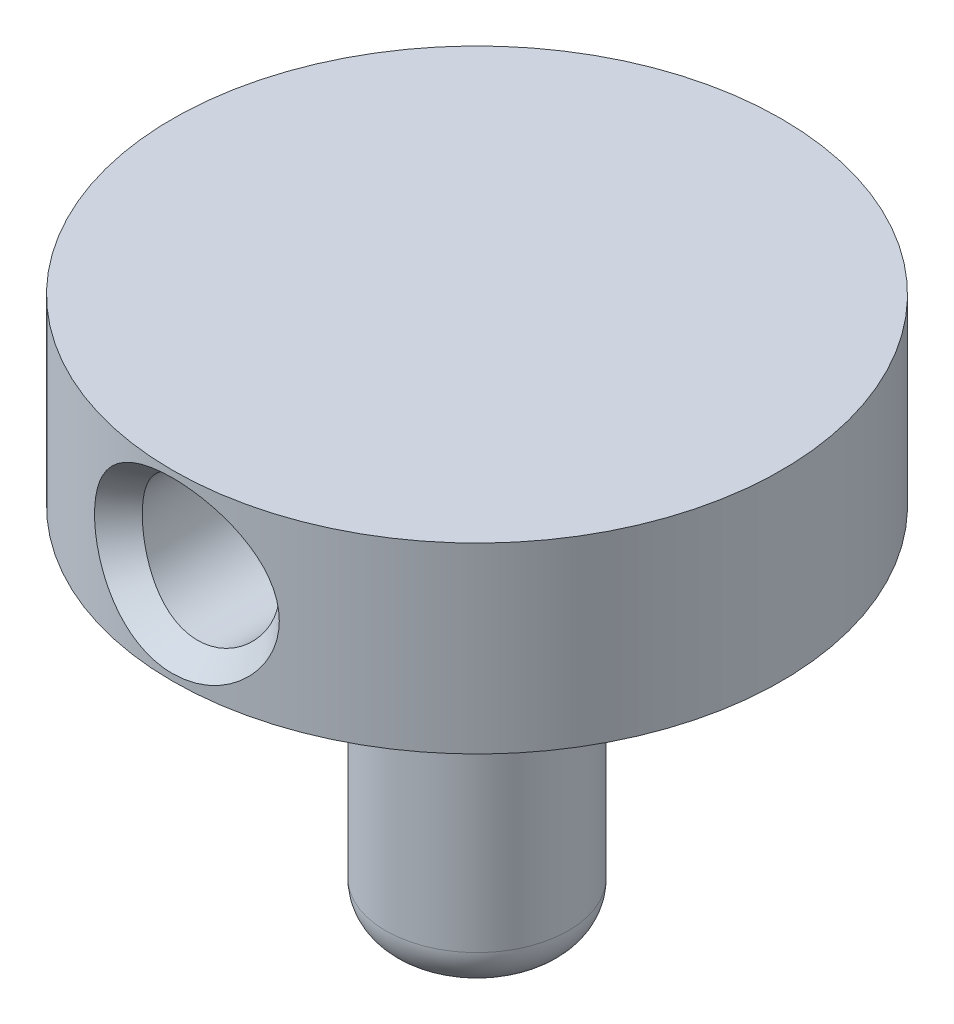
ISO-10303-21;
HEADER;
FILE_DESCRIPTION(('STEP AP214'),'2;1');
FILE_NAME('part.step','',(''),(''),'','','');
FILE_SCHEMA(('AUTOMOTIVE_DESIGN { 1 0 10303 214 1 1 1 1 }'));
ENDSEC;
DATA;
#1=APPLICATION_CONTEXT('core data for automotive mechanical design processes');
#2=APPLICATION_PROTOCOL_DEFINITION('international standard','automotive_design',2000,#1);
#3=PRODUCT_CONTEXT('',#1,'mechanical');
#4=PRODUCT('Part','Part','',(#3));
#5=PRODUCT_RELATED_PRODUCT_CATEGORY('part','',(#4));
#6=PRODUCT_DEFINITION_FORMATION('','',#4);
#7=PRODUCT_DEFINITION_CONTEXT('part definition',#1,'design');
#8=PRODUCT_DEFINITION('design','',#6,#7);
#9=PRODUCT_DEFINITION_SHAPE('','',#8);
#10=(LENGTH_UNIT() NAMED_UNIT(*) SI_UNIT(.MILLI.,.METRE.));
#11=(NAMED_UNIT(*) PLANE_ANGLE_UNIT() SI_UNIT($,.RADIAN.));
#12=(NAMED_UNIT(*) SI_UNIT($,.STERADIAN.) SOLID_ANGLE_UNIT());
#13=UNCERTAINTY_MEASURE_WITH_UNIT(LENGTH_MEASURE(1.E-05),#10,'distance_accuracy_value','');
#14=(GEOMETRIC_REPRESENTATION_CONTEXT(3) GLOBAL_UNCERTAINTY_ASSIGNED_CONTEXT((#13)) GLOBAL_UNIT_ASSIGNED_CONTEXT((#10,
#11,#12)) REPRESENTATION_CONTEXT('',''));
#15=CARTESIAN_POINT('',(0.,0.,0.));
#16=DIRECTION('',(0.,0.,1.));
#17=DIRECTION('',(1.,0.,0.));
#18=AXIS2_PLACEMENT_3D('',#15,#16,#17);
#19=CARTESIAN_POINT('',(0.,7.62,0.));
#20=DIRECTION('',(0.,-1.,0.));
#21=DIRECTION('',(0.,0.,-1.));
#22=AXIS2_PLACEMENT_3D('',#19,#20,#21);
#23=CYLINDRICAL_SURFACE('',#22,1.905);
#24=CARTESIAN_POINT('',(0.,0.888999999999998,0.));
#25=DIRECTION('',(0.,1.,0.));
#26=DIRECTION('',(0.,0.,1.));
#27=AXIS2_PLACEMENT_3D('',#24,#25,#26);
#28=CIRCLE('',#27,1.905);
#29=CARTESIAN_POINT('',(0.,0.888999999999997,-1.905));
#30=VERTEX_POINT('',#29);
#31=EDGE_CURVE('E70',#30,#30,#28,.T.);
#32=CARTESIAN_POINT('',(0.,6.73100000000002,0.));
#33=DIRECTION('',(0.,1.,0.));
#34=DIRECTION('',(0.,0.,1.));
#35=AXIS2_PLACEMENT_3D('',#32,#33,#34);
#36=CIRCLE('',#35,1.905);
#37=CARTESIAN_POINT('',(0.,6.73100000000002,-1.905));
#38=VERTEX_POINT('',#37);
#39=EDGE_CURVE('E75',#38,#38,#36,.F.);
#40=CARTESIAN_POINT('',(0.,0.888999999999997,-1.905));
#41=CARTESIAN_POINT('',(0.,0.949854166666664,-1.905));
#42=CARTESIAN_POINT('',(0.,1.01070833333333,-1.905));
#43=CARTESIAN_POINT('',(0.,1.13241666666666,-1.905));
#44=CARTESIAN_POINT('',(0.,1.19327083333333,-1.905));
#45=CARTESIAN_POINT('',(0.,1.31497916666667,-1.905));
#46=CARTESIAN_POINT('',(0.,1.37583333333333,-1.905));
#47=CARTESIAN_POINT('',(0.,1.49754166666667,-1.905));
#48=CARTESIAN_POINT('',(0.,1.55839583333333,-1.905));
#49=CARTESIAN_POINT('',(0.,1.68010416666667,-1.905));
#50=CARTESIAN_POINT('',(0.,1.74095833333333,-1.905));
#51=CARTESIAN_POINT('',(0.,1.86266666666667,-1.905));
#52=CARTESIAN_POINT('',(0.,1.92352083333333,-1.905));
#53=CARTESIAN_POINT('',(0.,2.04522916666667,-1.905));
#54=CARTESIAN_POINT('',(0.,2.10608333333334,-1.905));
#55=CARTESIAN_POINT('',(0.,2.22779166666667,-1.905));
#56=CARTESIAN_POINT('',(0.,2.28864583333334,-1.905));
#57=CARTESIAN_POINT('',(0.,2.41035416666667,-1.905));
#58=CARTESIAN_POINT('',(0.,2.47120833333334,-1.905));
#59=CARTESIAN_POINT('',(0.,2.59291666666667,-1.905));
#60=CARTESIAN_POINT('',(0.,2.65377083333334,-1.905));
#61=CARTESIAN_POINT('',(0.,2.77547916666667,-1.905));
#62=CARTESIAN_POINT('',(0.,2.83633333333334,-1.905));
#63=CARTESIAN_POINT('',(0.,2.95804166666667,-1.905));
#64=CARTESIAN_POINT('',(0.,3.01889583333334,-1.905));
#65=CARTESIAN_POINT('',(0.,3.14060416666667,-1.905));
#66=CARTESIAN_POINT('',(0.,3.20145833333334,-1.905));
#67=CARTESIAN_POINT('',(0.,3.32316666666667,-1.905));
#68=CARTESIAN_POINT('',(0.,3.38402083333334,-1.905));
#69=CARTESIAN_POINT('',(0.,3.50572916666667,-1.905));
#70=CARTESIAN_POINT('',(0.,3.56658333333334,-1.905));
#71=CARTESIAN_POINT('',(0.,3.68829166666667,-1.905));
#72=CARTESIAN_POINT('',(0.,3.74914583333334,-1.905));
#73=CARTESIAN_POINT('',(0.,3.87085416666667,-1.905));
#74=CARTESIAN_POINT('',(0.,3.93170833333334,-1.905));
#75=CARTESIAN_POINT('',(0.,4.05341666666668,-1.905));
#76=CARTESIAN_POINT('',(0.,4.11427083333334,-1.905));
#77=CARTESIAN_POINT('',(0.,4.23597916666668,-1.905));
#78=CARTESIAN_POINT('',(0.,4.29683333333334,-1.905));
#79=CARTESIAN_POINT('',(0.,4.41854166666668,-1.905));
#80=CARTESIAN_POINT('',(0.,4.47939583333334,-1.905));
#81=CARTESIAN_POINT('',(0.,4.60110416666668,-1.905));
#82=CARTESIAN_POINT('',(0.,4.66195833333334,-1.905));
#83=CARTESIAN_POINT('',(0.,4.78366666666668,-1.905));
#84=CARTESIAN_POINT('',(0.,4.84452083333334,-1.905));
#85=CARTESIAN_POINT('',(0.,4.96622916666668,-1.905));
#86=CARTESIAN_POINT('',(0.,5.02708333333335,-1.905));
#87=CARTESIAN_POINT('',(0.,5.14879166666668,-1.905));
#88=CARTESIAN_POINT('',(0.,5.20964583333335,-1.905));
#89=CARTESIAN_POINT('',(0.,5.33135416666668,-1.905));
#90=CARTESIAN_POINT('',(0.,5.39220833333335,-1.905));
#91=CARTESIAN_POINT('',(0.,5.51391666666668,-1.905));
#92=CARTESIAN_POINT('',(0.,5.57477083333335,-1.905));
#93=CARTESIAN_POINT('',(0.,5.69647916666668,-1.905));
#94=CARTESIAN_POINT('',(0.,5.75733333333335,-1.905));
#95=CARTESIAN_POINT('',(0.,5.87904166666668,-1.905));
#96=CARTESIAN_POINT('',(0.,5.93989583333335,-1.905));
#97=CARTESIAN_POINT('',(0.,6.06160416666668,-1.905));
#98=CARTESIAN_POINT('',(0.,6.12245833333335,-1.905));
#99=CARTESIAN_POINT('',(0.,6.24416666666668,-1.905));
#100=CARTESIAN_POINT('',(0.,6.30502083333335,-1.905));
#101=CARTESIAN_POINT('',(0.,6.42672916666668,-1.905));
#102=CARTESIAN_POINT('',(0.,6.48758333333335,-1.905));
#103=CARTESIAN_POINT('',(0.,6.60929166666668,-1.905));
#104=CARTESIAN_POINT('',(0.,6.67014583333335,-1.905));
#105=CARTESIAN_POINT('',(0.,6.73100000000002,-1.905));
#106=B_SPLINE_CURVE_WITH_KNOTS('',3,(#40,#41,#42,#43,#44,#45,#46,#47,#48,#49,#50,#51,#52,#53,
#54,#55,#56,#57,#58,#59,#60,#61,#62,#63,#64,#65,#66,#67,#68,#69,#70,#71,#72,#73,#74,#75,#76,#77,
#78,#79,#80,#81,#82,#83,#84,#85,#86,#87,#88,#89,#90,#91,#92,#93,#94,#95,#96,#97,#98,#99,#100,
#101,#102,#103,#104,#105),.UNSPECIFIED.,.F.,.F.,(4,2,2,2,2,2,2,2,2,2,2,2,2,2,2,2,2,2,2,2,2,2,2,
2,2,2,2,2,2,2,2,2,4),(0.,0.1825625,0.365125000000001,0.547687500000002,0.730250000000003,
0.912812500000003,1.095375,1.2779375,1.46050000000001,1.64306250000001,1.82562500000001,
2.00818750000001,2.19075000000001,2.37331250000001,2.55587500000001,2.73843750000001,
2.92100000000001,3.10356250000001,3.28612500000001,3.46868750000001,3.65125000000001,
3.83381250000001,4.01637500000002,4.19893750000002,4.38150000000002,4.56406250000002,
4.74662500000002,4.92918750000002,5.11175000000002,5.29431250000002,5.47687500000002,
5.65943750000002,5.84200000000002),.UNSPECIFIED.);
#107=EDGE_CURVE('BSEAM37',#30,#38,#106,.T.);
#108=ORIENTED_EDGE('',*,*,#31,.T.);
#109=ORIENTED_EDGE('',*,*,#39,.T.);
#110=ORIENTED_EDGE('',*,*,#107,.T.);
#111=ORIENTED_EDGE('',*,*,#107,.F.);
#112=EDGE_LOOP('',(#108,#110,#109,#111));
#113=FACE_BOUND('',#112,.T.);
#114=ADVANCED_FACE('F37',(#113),#23,.T.);
#115=CARTESIAN_POINT('',(0.,0.,0.));
#116=DIRECTION('',(0.,1.,0.));
#117=DIRECTION('',(0.,0.,1.));
#118=AXIS2_PLACEMENT_3D('',#115,#116,#117);
#119=PLANE('',#118);
#120=CARTESIAN_POINT('',(0.,0.,0.));
#121=DIRECTION('',(0.,1.,0.));
#122=DIRECTION('',(0.,0.,1.));
#123=AXIS2_PLACEMENT_3D('',#120,#121,#122);
#124=CIRCLE('',#123,1.016);
#125=CARTESIAN_POINT('',(0.,0.,1.016));
#126=VERTEX_POINT('',#125);
#127=EDGE_CURVE('E65',#126,#126,#124,.F.);
#128=ORIENTED_EDGE('',*,*,#127,.T.);
#129=EDGE_LOOP('',(#128));
#130=FACE_BOUND('',#129,.T.);
#131=ADVANCED_FACE('F94',(#130),#119,.F.);
#132=CARTESIAN_POINT('',(0.,11.43,0.));
#133=DIRECTION('',(0.,-1.,0.));
#134=DIRECTION('',(0.,0.,-1.));
#135=AXIS2_PLACEMENT_3D('',#132,#133,#134);
#136=CYLINDRICAL_SURFACE('',#135,6.35);
#137=CARTESIAN_POINT('',(0.,11.2933708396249,-6.35));
#138=CARTESIAN_POINT('',(0.0317629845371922,11.29337084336,-6.35000000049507));
#139=CARTESIAN_POINT('',(0.0634281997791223,11.2926506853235,-6.3497617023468));
#140=CARTESIAN_POINT('',(0.126566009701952,11.289791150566,-6.34881704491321));
#141=CARTESIAN_POINT('',(0.158038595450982,11.2876517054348,-6.34811067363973));
#142=CARTESIAN_POINT('',(0.252169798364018,11.2791203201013,-6.3453015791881));
#143=CARTESIAN_POINT('',(0.314553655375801,11.2706169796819,-6.34250791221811));
#144=CARTESIAN_POINT('',(0.407521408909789,11.2536221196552,-6.33698604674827));
#145=CARTESIAN_POINT('',(0.438438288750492,11.2472412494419,-6.33492088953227));
#146=CARTESIAN_POINT('',(0.500017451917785,11.23305660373,-6.3303584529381));
#147=CARTESIAN_POINT('',(0.530806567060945,11.2252168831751,-6.32784973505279));
#148=CARTESIAN_POINT('',(0.591761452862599,11.2081862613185,-6.3224404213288));
#149=CARTESIAN_POINT('',(0.621836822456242,11.1990276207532,-6.31954999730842));
#150=CARTESIAN_POINT('',(0.681295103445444,11.1794256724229,-6.31341668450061));
#151=CARTESIAN_POINT('',(0.710662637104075,11.1689869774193,-6.31017524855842));
#152=CARTESIAN_POINT('',(0.797701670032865,11.1357876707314,-6.29996713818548));
#153=CARTESIAN_POINT('',(0.854311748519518,11.1111479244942,-6.29251649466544));
#154=CARTESIAN_POINT('',(0.964749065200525,11.0568950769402,-6.27653349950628));
#155=CARTESIAN_POINT('',(1.01857811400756,11.0272773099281,-6.26799954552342));
#156=CARTESIAN_POINT('',(1.08410021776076,10.9870879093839,-6.2567887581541));
#157=CARTESIAN_POINT('',(1.09711823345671,10.9788875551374,-6.25451866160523));
#158=CARTESIAN_POINT('',(1.12297208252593,10.9621699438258,-6.24992850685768));
#159=CARTESIAN_POINT('',(1.13581938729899,10.9536432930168,-6.24760605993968));
#160=CARTESIAN_POINT('',(1.1738932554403,10.9277117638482,-6.24060408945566));
#161=CARTESIAN_POINT('',(1.19870437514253,10.9099263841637,-6.23588158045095));
#162=CARTESIAN_POINT('',(1.2472274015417,10.8733628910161,-6.22635809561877));
#163=CARTESIAN_POINT('',(1.27093642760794,10.8545872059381,-6.22155771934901));
#164=CARTESIAN_POINT('',(1.31726700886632,10.8160571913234,-6.21191335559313));
#165=CARTESIAN_POINT('',(1.33988851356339,10.796302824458,-6.20706932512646));
#166=CARTESIAN_POINT('',(1.40613528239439,10.7355740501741,-6.1925220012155));
#167=CARTESIAN_POINT('',(1.44816158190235,10.6931172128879,-6.18279892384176));
#168=CARTESIAN_POINT('',(1.50790490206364,10.6265071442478,-6.16839885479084));
#169=CARTESIAN_POINT('',(1.52729753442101,10.6037757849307,-6.16362212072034));
#170=CARTESIAN_POINT('',(1.56494054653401,10.5573500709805,-6.1541724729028));
#171=CARTESIAN_POINT('',(1.58326475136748,10.5335493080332,-6.14947995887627));
#172=CARTESIAN_POINT('',(1.6184125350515,10.4854207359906,-6.14032323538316));
#173=CARTESIAN_POINT('',(1.63530003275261,10.4610207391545,-6.13584347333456));
#174=CARTESIAN_POINT('',(1.66769256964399,10.4115896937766,-6.12711864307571));
#175=CARTESIAN_POINT('',(1.68320275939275,10.3865528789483,-6.12287228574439));
#176=CARTESIAN_POINT('',(1.72769151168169,10.3104802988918,-6.11052616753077));
#177=CARTESIAN_POINT('',(1.75463307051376,10.258484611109,-6.10281887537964));
#178=CARTESIAN_POINT('',(1.80304020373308,10.1518835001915,-6.08869296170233));
#179=CARTESIAN_POINT('',(1.82449708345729,10.0973068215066,-6.08227679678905));
#180=CARTESIAN_POINT('',(1.86175747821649,9.98530241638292,-6.07097492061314));
#181=CARTESIAN_POINT('',(1.87723916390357,9.92881692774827,-6.06618837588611));
#182=CARTESIAN_POINT('',(1.90203349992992,9.81510910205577,-6.05845999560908));
#183=CARTESIAN_POINT('',(1.9113576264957,9.75784994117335,-6.05551443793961));
#184=CARTESIAN_POINT('',(1.92386947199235,9.64252495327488,-6.05155098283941));
#185=CARTESIAN_POINT('',(1.92705424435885,9.58445803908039,-6.05053404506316));
#186=CARTESIAN_POINT('',(1.92710282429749,9.5113546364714,-6.0505185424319));
#187=CARTESIAN_POINT('',(1.92691309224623,9.49670947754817,-6.05057898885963));
#188=CARTESIAN_POINT('',(1.92613593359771,9.46735979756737,-6.05082643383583));
#189=CARTESIAN_POINT('',(1.92554686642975,9.45266122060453,-6.05101395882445));
#190=CARTESIAN_POINT('',(1.92318951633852,9.40874955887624,-6.05176377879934));
#191=CARTESIAN_POINT('',(1.92083336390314,9.37963817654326,-6.05251269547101));
#192=CARTESIAN_POINT('',(1.91458268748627,9.32173294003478,-6.05449286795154));
#193=CARTESIAN_POINT('',(1.91068871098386,9.29293928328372,-6.05572393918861));
#194=CARTESIAN_POINT('',(1.90138563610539,9.23566474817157,-6.05865137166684));
#195=CARTESIAN_POINT('',(1.89597646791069,9.20718388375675,-6.06034774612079));
#196=CARTESIAN_POINT('',(1.87749241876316,9.12220597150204,-6.06610987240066));
#197=CARTESIAN_POINT('',(1.86215652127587,9.0661513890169,-6.07085165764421));
#198=CARTESIAN_POINT('',(1.83463995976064,8.9830622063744,-6.07920130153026));
#199=CARTESIAN_POINT('',(1.82469382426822,8.9554867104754,-6.08219668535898));
#200=CARTESIAN_POINT('',(1.80329559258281,8.9007221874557,-6.08857538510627));
#201=CARTESIAN_POINT('',(1.79177813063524,8.87339473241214,-6.09197769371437));
#202=CARTESIAN_POINT('',(1.76744097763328,8.8196463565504,-6.0990829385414));
#203=CARTESIAN_POINT('',(1.75460211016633,8.79315903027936,-6.10279184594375));
#204=CARTESIAN_POINT('',(1.72761540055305,8.74095772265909,-6.11048622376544));
#205=CARTESIAN_POINT('',(1.71346687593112,8.71524041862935,-6.11447193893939));
#206=CARTESIAN_POINT('',(1.66908194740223,8.63921666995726,-6.12679429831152));
#207=CARTESIAN_POINT('',(1.63691058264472,8.59003596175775,-6.13549620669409));
#208=CARTESIAN_POINT('',(1.58479264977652,8.51848289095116,-6.14908564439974));
#209=CARTESIAN_POINT('',(1.56677538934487,8.49500218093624,-6.15370501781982));
#210=CARTESIAN_POINT('',(1.52943817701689,8.44878414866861,-6.16309089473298));
#211=CARTESIAN_POINT('',(1.51010946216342,8.4260382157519,-6.16785943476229));
#212=CARTESIAN_POINT('',(1.4701610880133,8.38133240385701,-6.17750355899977));
#213=CARTESIAN_POINT('',(1.44945049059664,8.35928430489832,-6.18239972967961));
#214=CARTESIAN_POINT('',(1.40712345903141,8.31640539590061,-6.19217037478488));
#215=CARTESIAN_POINT('',(1.38545366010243,8.29550775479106,-6.19705840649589));
#216=CARTESIAN_POINT('',(1.34113686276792,8.25480315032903,-6.206800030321));
#217=CARTESIAN_POINT('',(1.31848617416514,8.23499135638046,-6.21165460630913));
#218=CARTESIAN_POINT('',(1.27220573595,8.19643555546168,-6.22129819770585));
#219=CARTESIAN_POINT('',(1.24857597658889,8.17769156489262,-6.2260872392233));
#220=CARTESIAN_POINT('',(1.20033535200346,8.14126662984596,-6.23556727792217));
#221=CARTESIAN_POINT('',(1.17572449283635,8.12358568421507,-6.24025830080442));
#222=CARTESIAN_POINT('',(1.1255121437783,8.08929038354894,-6.24950990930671));
#223=CARTESIAN_POINT('',(1.09991067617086,8.07267600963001,-6.25407052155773));
#224=CARTESIAN_POINT('',(1.04769985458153,8.04052585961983,-6.26302854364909));
#225=CARTESIAN_POINT('',(1.021094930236,8.02499292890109,-6.26742517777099));
#226=CARTESIAN_POINT('',(0.980399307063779,8.00250956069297,-6.27387491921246));
#227=CARTESIAN_POINT('',(0.966691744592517,7.99514661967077,-6.27600201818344));
#228=CARTESIAN_POINT('',(0.939154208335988,7.98077083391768,-6.28018176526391));
#229=CARTESIAN_POINT('',(0.925307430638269,7.97374735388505,-6.28223736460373));
#230=CARTESIAN_POINT('',(0.855722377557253,7.93947779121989,-6.2923281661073));
#231=CARTESIAN_POINT('',(0.798874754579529,7.91470218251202,-6.29981832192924));
#232=CARTESIAN_POINT('',(0.682860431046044,7.87036688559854,-6.31344695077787));
#233=CARTESIAN_POINT('',(0.623687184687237,7.85080149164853,-6.31958740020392));
#234=CARTESIAN_POINT('',(0.533158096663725,7.82540790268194,-6.32765048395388));
#235=CARTESIAN_POINT('',(0.502676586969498,7.81760169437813,-6.33014751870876));
#236=CARTESIAN_POINT('',(0.44112999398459,7.80333685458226,-6.33473420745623));
#237=CARTESIAN_POINT('',(0.410002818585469,7.79686682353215,-6.3368275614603));
#238=CARTESIAN_POINT('',(0.347331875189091,7.78534204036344,-6.34057138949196));
#239=CARTESIAN_POINT('',(0.31600089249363,7.78032277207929,-6.34221022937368));
#240=CARTESIAN_POINT('',(0.2532259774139,7.771720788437,-6.3450266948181));
#241=CARTESIAN_POINT('',(0.221802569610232,7.76814181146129,-6.34620313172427));
#242=CARTESIAN_POINT('',(0.127425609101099,7.75954557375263,-6.34903338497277));
#243=CARTESIAN_POINT('',(0.0643655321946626,7.75666440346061,-6.34998832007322));
#244=CARTESIAN_POINT('',(-0.0304377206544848,7.75661202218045,-6.35000568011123));
#245=CARTESIAN_POINT('',(-0.0620743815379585,7.757307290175,-6.34977559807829));
#246=CARTESIAN_POINT('',(-0.125419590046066,7.76013838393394,-6.34884031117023));
#247=CARTESIAN_POINT('',(-0.157135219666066,7.76227562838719,-6.34813462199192));
#248=CARTESIAN_POINT('',(-0.220611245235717,7.76801036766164,-6.34624632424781));
#249=CARTESIAN_POINT('',(-0.25246991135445,7.77162628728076,-6.34505770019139));
#250=CARTESIAN_POINT('',(-0.315475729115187,7.78024190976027,-6.34223664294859));
#251=CARTESIAN_POINT('',(-0.346766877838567,7.78525165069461,-6.34060090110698));
#252=CARTESIAN_POINT('',(-0.408852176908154,7.79664208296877,-6.33690042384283));
#253=CARTESIAN_POINT('',(-0.439660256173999,7.80302378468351,-6.33483535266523));
#254=CARTESIAN_POINT('',(-0.500813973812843,7.81714389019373,-6.33029426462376));
#255=CARTESIAN_POINT('',(-0.531159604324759,7.82488231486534,-6.32781823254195));
#256=CARTESIAN_POINT('',(-0.591391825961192,7.84170990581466,-6.32247339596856));
#257=CARTESIAN_POINT('',(-0.62127841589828,7.85079907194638,-6.31960457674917));
#258=CARTESIAN_POINT('',(-0.680592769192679,7.87033222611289,-6.31349209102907));
#259=CARTESIAN_POINT('',(-0.710020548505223,7.88077619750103,-6.31024840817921));
#260=CARTESIAN_POINT('',(-0.768414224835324,7.90303325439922,-6.30340414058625));
#261=CARTESIAN_POINT('',(-0.797381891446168,7.91484706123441,-6.29980332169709));
#262=CARTESIAN_POINT('',(-0.854842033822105,7.93986589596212,-6.29226386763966));
#263=CARTESIAN_POINT('',(-0.883092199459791,7.95296516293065,-6.2883572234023));
#264=CARTESIAN_POINT('',(-0.938669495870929,7.98031992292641,-6.28030158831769));
#265=CARTESIAN_POINT('',(-0.965994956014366,7.99457474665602,-6.27615279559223));
#266=CARTESIAN_POINT('',(-1.01973874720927,8.02422136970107,-6.26764494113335));
#267=CARTESIAN_POINT('',(-1.0461570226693,8.03961323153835,-6.26328583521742));
#268=CARTESIAN_POINT('',(-1.12406941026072,8.08748105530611,-6.24993965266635));
#269=CARTESIAN_POINT('',(-1.17422470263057,8.12164582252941,-6.24068311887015));
#270=CARTESIAN_POINT('',(-1.2709748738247,8.19451330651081,-6.22170024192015));
#271=CARTESIAN_POINT('',(-1.31759568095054,8.23323882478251,-6.21196770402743));
#272=CARTESIAN_POINT('',(-1.40708783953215,8.31532174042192,-6.19230977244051));
#273=CARTESIAN_POINT('',(-1.44925124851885,8.35802178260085,-6.18254320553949));
#274=CARTESIAN_POINT('',(-1.52871494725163,8.44677268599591,-6.16337585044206));
#275=CARTESIAN_POINT('',(-1.56599470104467,8.4928054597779,-6.15397892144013));
#276=CARTESIAN_POINT('',(-1.61825471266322,8.56436165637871,-6.14036447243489));
#277=CARTESIAN_POINT('',(-1.6350637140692,8.5886322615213,-6.13590644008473));
#278=CARTESIAN_POINT('',(-1.66744817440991,8.6380239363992,-6.12718514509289));
#279=CARTESIAN_POINT('',(-1.68302987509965,8.66315722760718,-6.12292006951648));
#280=CARTESIAN_POINT('',(-1.71291380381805,8.71424516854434,-6.11462733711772));
#281=CARTESIAN_POINT('',(-1.72727575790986,8.74031939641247,-6.11058252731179));
#282=CARTESIAN_POINT('',(-1.75445294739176,8.7928522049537,-6.10283489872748));
#283=CARTESIAN_POINT('',(-1.76729677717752,8.81934691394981,-6.09912462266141));
#284=CARTESIAN_POINT('',(-1.79151156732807,8.87278729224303,-6.09205592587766));
#285=CARTESIAN_POINT('',(-1.80288343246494,8.89973318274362,-6.08869728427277));
#286=CARTESIAN_POINT('',(-1.82416689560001,8.95407526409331,-6.08235468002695));
#287=CARTESIAN_POINT('',(-1.83407848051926,8.98147145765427,-6.07937070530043));
#288=CARTESIAN_POINT('',(-1.85244107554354,9.03671621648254,-6.07380063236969));
#289=CARTESIAN_POINT('',(-1.86089209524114,9.06456477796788,-6.07121452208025));
#290=CARTESIAN_POINT('',(-1.87632225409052,9.1207195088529,-6.06646354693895));
#291=CARTESIAN_POINT('',(-1.88330142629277,9.14902566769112,-6.06429866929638));
#292=CARTESIAN_POINT('',(-1.89576520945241,9.20610412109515,-6.06041391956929));
#293=CARTESIAN_POINT('',(-1.90124672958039,9.23485773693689,-6.05869502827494));
#294=CARTESIAN_POINT('',(-1.91069293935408,9.2929178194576,-6.05572266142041));
#295=CARTESIAN_POINT('',(-1.91462194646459,9.32201408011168,-6.05448046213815));
#296=CARTESIAN_POINT('',(-1.92399517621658,9.40909487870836,-6.05151099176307));
#297=CARTESIAN_POINT('',(-1.92709421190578,9.4671055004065,-6.05052128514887));
#298=CARTESIAN_POINT('',(-1.92709259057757,9.58294138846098,-6.05052181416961));
#299=CARTESIAN_POINT('',(-1.92399793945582,9.64078649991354,-6.05151012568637));
#300=CARTESIAN_POINT('',(-1.91468659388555,9.72743155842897,-6.05445997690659));
#301=CARTESIAN_POINT('',(-1.91080152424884,9.75630126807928,-6.05568836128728));
#302=CARTESIAN_POINT('',(-1.90145330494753,9.8139823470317,-6.05863015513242));
#303=CARTESIAN_POINT('',(-1.89597806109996,9.84284915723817,-6.0603473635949));
#304=CARTESIAN_POINT('',(-1.88345126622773,9.90035802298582,-6.06425217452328));
#305=CARTESIAN_POINT('',(-1.87644922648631,9.92879129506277,-6.06642430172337));
#306=CARTESIAN_POINT('',(-1.86097841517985,9.98514781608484,-6.07118809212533));
#307=CARTESIAN_POINT('',(-1.85251389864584,10.013051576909,-6.07377841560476));
#308=CARTESIAN_POINT('',(-1.82497046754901,10.0959565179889,-6.08213376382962));
#309=CARTESIAN_POINT('',(-1.8037462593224,10.1501529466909,-6.08848321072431));
#310=CARTESIAN_POINT('',(-1.7556375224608,10.2564421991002,-6.10252934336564));
#311=CARTESIAN_POINT('',(-1.72874127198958,10.3085463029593,-6.11022928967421));
#312=CARTESIAN_POINT('',(-1.68410420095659,10.3850779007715,-6.12262478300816));
#313=CARTESIAN_POINT('',(-1.66846924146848,10.4103666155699,-6.12690753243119));
#314=CARTESIAN_POINT('',(-1.63583799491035,10.4602361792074,-6.13570041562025));
#315=CARTESIAN_POINT('',(-1.61894658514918,10.4846603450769,-6.1401822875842));
#316=CARTESIAN_POINT('',(-1.58397310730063,10.5326074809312,-6.1492971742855));
#317=CARTESIAN_POINT('',(-1.56590150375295,10.5561146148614,-6.15392738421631));
#318=CARTESIAN_POINT('',(-1.52860268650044,10.6022133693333,-6.16329810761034));
#319=CARTESIAN_POINT('',(-1.50937541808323,10.6248049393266,-6.16803866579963));
#320=CARTESIAN_POINT('',(-1.44996763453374,10.6912214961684,-6.18237441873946));
#321=CARTESIAN_POINT('',(-1.40805655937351,10.7336982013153,-6.19208570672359));
#322=CARTESIAN_POINT('',(-1.34171905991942,10.7946785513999,-6.20667410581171));
#323=CARTESIAN_POINT('',(-1.31900457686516,10.8145657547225,-6.21154500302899));
#324=CARTESIAN_POINT('',(-1.27243112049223,10.8533875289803,-6.22125279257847));
#325=CARTESIAN_POINT('',(-1.24847664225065,10.8723935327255,-6.22610837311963));
#326=CARTESIAN_POINT('',(-1.19966832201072,10.9092267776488,-6.23569672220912));
#327=CARTESIAN_POINT('',(-1.17487430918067,10.9270167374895,-6.24041885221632));
#328=CARTESIAN_POINT('',(-1.12445458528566,10.961409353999,-6.24970070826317));
#329=CARTESIAN_POINT('',(-1.09883914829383,10.978004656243,-6.25425851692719));
#330=CARTESIAN_POINT('',(-1.02078176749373,11.0260067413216,-6.26763845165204));
#331=CARTESIAN_POINT('',(-0.967131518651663,11.0556338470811,-6.27616745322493));
#332=CARTESIAN_POINT('',(-0.88420567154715,11.0965050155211,-6.28820007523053));
#333=CARTESIAN_POINT('',(-0.856154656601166,11.1095328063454,-6.2920842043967));
#334=CARTESIAN_POINT('',(-0.799219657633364,11.1343809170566,-6.29956921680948));
#335=CARTESIAN_POINT('',(-0.770342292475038,11.1461982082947,-6.30316920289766));
#336=CARTESIAN_POINT('',(-0.711707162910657,11.1686126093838,-6.31005914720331));
#337=CARTESIAN_POINT('',(-0.681959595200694,11.1791976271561,-6.3133456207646));
#338=CARTESIAN_POINT('',(-0.622306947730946,11.1988814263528,-6.31950397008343));
#339=CARTESIAN_POINT('',(-0.59226497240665,11.2080336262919,-6.32239225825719));
#340=CARTESIAN_POINT('',(-0.501688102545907,11.2333759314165,-6.33044061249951));
#341=CARTESIAN_POINT('',(-0.440557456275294,11.2475123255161,-6.33500167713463));
#342=CARTESIAN_POINT('',(-0.316894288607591,11.2702572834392,-6.34239028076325));
#343=CARTESIAN_POINT('',(-0.254324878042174,11.2788692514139,-6.3452190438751));
#344=CARTESIAN_POINT('',(-0.159430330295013,11.2875524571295,-6.34807793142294));
#345=CARTESIAN_POINT('',(-0.127563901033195,11.2897369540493,-6.34879914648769));
#346=CARTESIAN_POINT('',(-0.0636049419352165,11.292651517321,-6.34976197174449));
#347=CARTESIAN_POINT('',(-0.031762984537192,11.2933708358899,-6.34999999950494));
#348=CARTESIAN_POINT('',(0.,11.2933708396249,-6.35));
#349=B_SPLINE_CURVE_WITH_KNOTS('',3,(#137,#138,#139,#140,#141,#142,#143,#144,#145,#146,#147,
#148,#149,#150,#151,#152,#153,#154,#155,#156,#157,#158,#159,#160,#161,#162,#163,#164,#165,#166,
#167,#168,#169,#170,#171,#172,#173,#174,#175,#176,#177,#178,#179,#180,#181,#182,#183,#184,#185,
#186,#187,#188,#189,#190,#191,#192,#193,#194,#195,#196,#197,#198,#199,#200,#201,#202,#203,#204,
#205,#206,#207,#208,#209,#210,#211,#212,#213,#214,#215,#216,#217,#218,#219,#220,#221,#222,#223,
#224,#225,#226,#227,#228,#229,#230,#231,#232,#233,#234,#235,#236,#237,#238,#239,#240,#241,#242,
#243,#244,#245,#246,#247,#248,#249,#250,#251,#252,#253,#254,#255,#256,#257,#258,#259,#260,#261,
#262,#263,#264,#265,#266,#267,#268,#269,#270,#271,#272,#273,#274,#275,#276,#277,#278,#279,#280,
#281,#282,#283,#284,#285,#286,#287,#288,#289,#290,#291,#292,#293,#294,#295,#296,#297,#298,#299,
#300,#301,#302,#303,#304,#305,#306,#307,#308,#309,#310,#311,#312,#313,#314,#315,#316,#317,#318,
#319,#320,#321,#322,#323,#324,#325,#326,#327,#328,#329,#330,#331,#332,#333,#334,#335,#336,#337,
#338,#339,#340,#341,#342,#343,#344,#345,#346,#347,#348),.UNSPECIFIED.,.T.,.F.,(4,2,2,2,2,2,2,2,
2,2,2,2,2,2,2,2,2,2,2,2,2,2,2,2,2,2,2,2,2,2,2,2,2,2,2,2,2,2,2,2,2,2,2,2,2,2,2,2,2,2,2,2,2,2,2,2,
2,2,2,2,2,2,2,2,2,2,2,2,2,2,2,2,2,2,2,2,2,2,2,2,2,2,2,2,2,2,2,2,2,2,2,2,2,2,2,2,2,2,2,2,2,2,2,2,
2,4),(0.000497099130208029,0.000583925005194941,0.00067075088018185,0.000844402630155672,
0.000931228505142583,0.00101805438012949,0.00110488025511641,0.00119170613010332,
0.00136535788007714,0.00153900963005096,0.00158242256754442,0.00162583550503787,
0.00171266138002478,0.00179948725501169,0.0018863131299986,0.00205996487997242,
0.00214679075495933,0.00223361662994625,0.00232044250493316,0.00240726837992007,
0.00258092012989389,0.00275457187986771,0.00292822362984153,0.00310187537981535,
0.00327552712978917,0.00331894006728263,0.00336235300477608,0.003449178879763,
0.00353600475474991,0.00362283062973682,0.00379648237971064,0.00388330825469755,
0.00397013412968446,0.00405696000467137,0.00414378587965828,0.0043174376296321,
0.00440426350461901,0.00449108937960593,0.00457791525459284,0.00466474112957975,
0.00475156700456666,0.00483839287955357,0.00492521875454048,0.00501204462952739,
0.0050988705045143,0.00514228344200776,0.00518569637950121,0.00535934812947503,
0.00553299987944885,0.00561982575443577,0.00570665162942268,0.00579347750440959,
0.0058803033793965,0.00605395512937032,0.00614078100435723,0.00622760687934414,
0.00631443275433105,0.00640125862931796,0.00648808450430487,0.00657491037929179,
0.0066617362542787,0.00674856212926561,0.00683538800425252,0.00692221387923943,
0.00700903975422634,0.00709586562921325,0.00726951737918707,0.00744316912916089,
0.00761682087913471,0.00779047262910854,0.00787729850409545,0.00796412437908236,
0.00805095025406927,0.00813777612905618,0.00822460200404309,0.00831142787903,
0.00839825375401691,0.00848507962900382,0.00857190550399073,0.00865873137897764,
0.00883238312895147,0.00900603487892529,0.0090928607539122,0.00917968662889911,
0.00926651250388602,0.00935333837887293,0.00952699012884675,0.00970064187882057,
0.00978746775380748,0.00987429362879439,0.00996111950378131,0.0100479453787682,
0.010221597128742,0.0103084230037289,0.0103952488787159,0.0104820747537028,0.0105689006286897,
0.0107425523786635,0.0108293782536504,0.0109162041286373,0.0110030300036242,0.0110898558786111,
0.011263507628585,0.0114371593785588,0.0115239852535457,0.0116108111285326),.UNSPECIFIED.);
#350=CARTESIAN_POINT('',(0.,11.2933708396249,-6.35));
#351=VERTEX_POINT('',#350);
#352=EDGE_CURVE('E55',#351,#351,#349,.F.);
#353=ORIENTED_EDGE('',*,*,#352,.T.);
#354=EDGE_LOOP('',(#353));
#355=FACE_BOUND('',#354,.T.);
#356=CARTESIAN_POINT('',(1.92709340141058,9.525,6.05052154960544));
#357=CARTESIAN_POINT('',(1.92708974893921,9.58346593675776,6.05052273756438));
#358=CARTESIAN_POINT('',(1.92394177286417,9.64149503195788,6.05152794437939));
#359=CARTESIAN_POINT('',(1.91151986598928,9.75671127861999,6.05546317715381));
#360=CARTESIAN_POINT('',(1.9022490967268,9.81389752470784,6.05839217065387));
#361=CARTESIAN_POINT('',(1.88375407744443,9.89904690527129,6.06415798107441));
#362=CARTESIAN_POINT('',(1.87682302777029,9.92732487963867,6.06630862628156));
#363=CARTESIAN_POINT('',(1.86141170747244,9.98366884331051,6.07105521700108));
#364=CARTESIAN_POINT('',(1.85293732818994,10.0117164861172,6.07364939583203));
#365=CARTESIAN_POINT('',(1.8343874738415,10.0676701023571,6.07927765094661));
#366=CARTESIAN_POINT('',(1.82435360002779,10.0954326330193,6.08229881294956));
#367=CARTESIAN_POINT('',(1.80294774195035,10.1501178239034,6.0886783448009));
#368=CARTESIAN_POINT('',(1.79154648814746,10.1771294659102,6.09204559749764));
#369=CARTESIAN_POINT('',(1.75532075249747,10.257095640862,6.10262088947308));
#370=CARTESIAN_POINT('',(1.7284554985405,10.3090536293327,6.11030945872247));
#371=CARTESIAN_POINT('',(1.68415330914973,10.3849849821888,6.12261073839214));
#372=CARTESIAN_POINT('',(1.66871676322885,10.4099621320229,6.12683953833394));
#373=CARTESIAN_POINT('',(1.63649933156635,10.4592509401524,6.13552347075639));
#374=CARTESIAN_POINT('',(1.61971850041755,10.4835626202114,6.13997863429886));
#375=CARTESIAN_POINT('',(1.58479621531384,10.5315167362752,6.14908501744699));
#376=CARTESIAN_POINT('',(1.56666633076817,10.5551446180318,6.15373332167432));
#377=CARTESIAN_POINT('',(1.52897238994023,10.6017804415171,6.16320708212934));
#378=CARTESIAN_POINT('',(1.50950687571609,10.6246622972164,6.16800726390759));
#379=CARTESIAN_POINT('',(1.44962057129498,10.6916008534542,6.18245752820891));
#380=CARTESIAN_POINT('',(1.40756448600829,10.7341757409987,6.1921971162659));
#381=CARTESIAN_POINT('',(1.31928992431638,10.815270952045,6.21160331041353));
#382=CARTESIAN_POINT('',(1.2730655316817,10.8538037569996,6.22127254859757));
#383=CARTESIAN_POINT('',(1.17638244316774,10.9268327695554,6.24027649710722));
#384=CARTESIAN_POINT('',(1.12590504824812,10.961341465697,6.2496151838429));
#385=CARTESIAN_POINT('',(1.02059312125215,11.0261413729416,6.26767468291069));
#386=CARTESIAN_POINT('',(0.966604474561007,11.0559159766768,6.27624918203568));
#387=CARTESIAN_POINT('',(0.855914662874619,11.1104260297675,6.29229981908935));
#388=CARTESIAN_POINT('',(0.799229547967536,11.1351510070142,6.29977363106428));
#389=CARTESIAN_POINT('',(0.712169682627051,11.1684380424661,6.3100053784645));
#390=CARTESIAN_POINT('',(0.682810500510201,11.1788992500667,6.31325285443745));
#391=CARTESIAN_POINT('',(0.62340247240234,11.1985369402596,6.31939562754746));
#392=CARTESIAN_POINT('',(0.593341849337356,11.207715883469,6.3222917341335));
#393=CARTESIAN_POINT('',(0.53256192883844,11.2247537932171,6.32770196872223));
#394=CARTESIAN_POINT('',(0.501714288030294,11.2326389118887,6.33022457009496));
#395=CARTESIAN_POINT('',(0.44001472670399,11.2469034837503,6.33481180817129));
#396=CARTESIAN_POINT('',(0.409055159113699,11.2533174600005,6.336887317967));
#397=CARTESIAN_POINT('',(0.346972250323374,11.2647138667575,6.34058966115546));
#398=CARTESIAN_POINT('',(0.315840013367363,11.2696992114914,6.3422174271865));
#399=CARTESIAN_POINT('',(0.253395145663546,11.2782560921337,6.34501912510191));
#400=CARTESIAN_POINT('',(0.222082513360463,11.2818276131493,6.3461930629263));
#401=CARTESIAN_POINT('',(0.159276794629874,11.2875583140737,6.34807986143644));
#402=CARTESIAN_POINT('',(0.127783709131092,11.2897175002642,6.34879272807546));
#403=CARTESIAN_POINT('',(0.0646158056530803,11.2926147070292,6.3497498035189));
#404=CARTESIAN_POINT('',(0.0329409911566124,11.293352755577,6.34999401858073));
#405=CARTESIAN_POINT('',(-0.03059290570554,11.2933882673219,6.35000576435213));
#406=CARTESIAN_POINT('',(-0.0624299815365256,11.2926866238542,6.34977358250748));
#407=CARTESIAN_POINT('',(-0.126380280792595,11.2898086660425,6.34882282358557));
#408=CARTESIAN_POINT('',(-0.158276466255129,11.2876401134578,6.34810684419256));
#409=CARTESIAN_POINT('',(-0.25319292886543,11.2790074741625,6.34526444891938));
#410=CARTESIAN_POINT('',(-0.31573545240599,11.2704321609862,6.34244752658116));
#411=CARTESIAN_POINT('',(-0.439288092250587,11.2477833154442,6.3350892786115));
#412=CARTESIAN_POINT('',(-0.500316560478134,11.2337123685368,6.33054861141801));
#413=CARTESIAN_POINT('',(-0.620884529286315,11.200072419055,6.31986276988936));
#414=CARTESIAN_POINT('',(-0.680396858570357,11.1805144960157,6.31372056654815));
#415=CARTESIAN_POINT('',(-0.798006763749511,11.135687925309,6.29993563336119));
#416=CARTESIAN_POINT('',(-0.85507976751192,11.1108042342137,6.29241320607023));
#417=CARTESIAN_POINT('',(-0.965744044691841,11.0563721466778,6.27638151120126));
#418=CARTESIAN_POINT('',(-1.01936917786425,11.0268098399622,6.26786759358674));
#419=CARTESIAN_POINT('',(-1.09729692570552,10.9789844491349,6.25452909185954));
#420=CARTESIAN_POINT('',(-1.12285397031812,10.962461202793,6.24998817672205));
#421=CARTESIAN_POINT('',(-1.17312982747,10.9282440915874,6.24074672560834));
#422=CARTESIAN_POINT('',(-1.19784867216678,10.9105502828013,6.23604614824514));
#423=CARTESIAN_POINT('',(-1.24644145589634,10.8739753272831,6.22651561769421));
#424=CARTESIAN_POINT('',(-1.27031085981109,10.8550980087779,6.22168660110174));
#425=CARTESIAN_POINT('',(-1.31720960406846,10.8161142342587,6.21192662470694));
#426=CARTESIAN_POINT('',(-1.34005956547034,10.7961581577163,6.2070333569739));
#427=CARTESIAN_POINT('',(-1.40671633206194,10.7350169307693,6.19239119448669));
#428=CARTESIAN_POINT('',(-1.44877756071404,10.6924683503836,6.18265387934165));
#429=CARTESIAN_POINT('',(-1.52813910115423,10.6039088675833,6.1635182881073));
#430=CARTESIAN_POINT('',(-1.56546513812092,10.5578760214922,6.15411415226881));
#431=CARTESIAN_POINT('',(-1.61787209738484,10.4861836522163,6.14046548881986));
#432=CARTESIAN_POINT('',(-1.63475685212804,10.4618213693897,6.13598836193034));
#433=CARTESIAN_POINT('',(-1.66728865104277,10.4122335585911,6.12722881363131));
#434=CARTESIAN_POINT('',(-1.68299396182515,10.3869073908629,6.12293016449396));
#435=CARTESIAN_POINT('',(-1.71296955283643,10.3356563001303,6.11461173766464));
#436=CARTESIAN_POINT('',(-1.72720924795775,10.3097966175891,6.1106011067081));
#437=CARTESIAN_POINT('',(-1.75425268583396,10.257547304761,6.10289236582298));
#438=CARTESIAN_POINT('',(-1.76705029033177,10.231168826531,6.09919595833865));
#439=CARTESIAN_POINT('',(-1.80328979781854,10.1512744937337,6.08861888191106));
#440=CARTESIAN_POINT('',(-1.82458335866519,10.0970014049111,6.08225006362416));
#441=CARTESIAN_POINT('',(-1.85220040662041,10.0140536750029,6.0738740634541));
#442=CARTESIAN_POINT('',(-1.86068434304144,9.98614768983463,6.07127824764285));
#443=CARTESIAN_POINT('',(-1.87618771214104,9.9298127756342,6.06650520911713));
#444=CARTESIAN_POINT('',(-1.88320431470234,9.90139482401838,6.06432887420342));
#445=CARTESIAN_POINT('',(-1.89575232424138,9.84397893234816,6.06041799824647));
#446=CARTESIAN_POINT('',(-1.90126464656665,9.81503151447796,6.05868938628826));
#447=CARTESIAN_POINT('',(-1.9106579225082,9.7572980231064,6.05573368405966));
#448=CARTESIAN_POINT('',(-1.91456791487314,9.72838266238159,6.0544975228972));
#449=CARTESIAN_POINT('',(-1.92393582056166,9.64166344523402,6.05152990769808));
#450=CARTESIAN_POINT('',(-1.92706458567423,9.58375909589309,6.0505307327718));
#451=CARTESIAN_POINT('',(-1.92712182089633,9.46784465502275,6.05051249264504));
#452=CARTESIAN_POINT('',(-1.92404652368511,9.40980544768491,6.05149464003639));
#453=CARTESIAN_POINT('',(-1.91470771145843,9.32269535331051,6.05445333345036));
#454=CARTESIAN_POINT('',(-1.91078978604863,9.29359027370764,6.05569209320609));
#455=CARTESIAN_POINT('',(-1.90136832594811,9.23552971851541,6.05865685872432));
#456=CARTESIAN_POINT('',(-1.89589943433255,9.20677710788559,6.06037191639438));
#457=CARTESIAN_POINT('',(-1.88346146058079,9.1497016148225,6.06424895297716));
#458=CARTESIAN_POINT('',(-1.87649551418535,9.12139764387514,6.0664099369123));
#459=CARTESIAN_POINT('',(-1.86109275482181,9.06524858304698,6.07115299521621));
#460=CARTESIAN_POINT('',(-1.85265590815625,9.03740350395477,6.07373508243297));
#461=CARTESIAN_POINT('',(-1.83432291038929,8.98216689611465,6.07929693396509));
#462=CARTESIAN_POINT('',(-1.82442674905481,8.95477537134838,6.08227671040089));
#463=CARTESIAN_POINT('',(-1.80317569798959,8.90044371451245,6.08861070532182));
#464=CARTESIAN_POINT('',(-1.79182082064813,8.87350357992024,6.09196493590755));
#465=CARTESIAN_POINT('',(-1.76764190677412,8.82007570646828,6.09902456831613));
#466=CARTESIAN_POINT('',(-1.75481386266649,8.79358203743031,6.10273106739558));
#467=CARTESIAN_POINT('',(-1.72768292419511,8.74107504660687,6.11046737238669));
#468=CARTESIAN_POINT('',(-1.71332865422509,8.714983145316,6.11451109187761));
#469=CARTESIAN_POINT('',(-1.68345942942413,8.66386370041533,6.12280195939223));
#470=CARTESIAN_POINT('',(-1.6678899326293,8.63872375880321,6.12706486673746));
#471=CARTESIAN_POINT('',(-1.63553536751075,8.5893262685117,6.13578069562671));
#472=CARTESIAN_POINT('',(-1.61874502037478,8.56505804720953,6.14023516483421));
#473=CARTESIAN_POINT('',(-1.56655447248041,8.49352291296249,6.15383617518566));
#474=CARTESIAN_POINT('',(-1.52933897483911,8.44752270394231,6.16322043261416));
#475=CARTESIAN_POINT('',(-1.4698743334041,8.38102934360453,6.17757111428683));
#476=CARTESIAN_POINT('',(-1.44944483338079,8.35928344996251,6.18240052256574));
#477=CARTESIAN_POINT('',(-1.40735391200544,8.31663400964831,6.19211768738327));
#478=CARTESIAN_POINT('',(-1.38569279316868,8.29573152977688,6.19700530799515));
#479=CARTESIAN_POINT('',(-1.34111201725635,8.25477621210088,6.20680602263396));
#480=CARTESIAN_POINT('',(-1.31816174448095,8.23470638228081,6.21172430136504));
#481=CARTESIAN_POINT('',(-1.27152185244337,8.19588081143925,6.22143856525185));
#482=CARTESIAN_POINT('',(-1.2477274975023,8.17702673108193,6.22625788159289));
#483=CARTESIAN_POINT('',(-1.17508950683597,8.12225403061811,6.24052045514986));
#484=CARTESIAN_POINT('',(-1.12486963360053,8.08800599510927,6.24979598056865));
#485=CARTESIAN_POINT('',(-1.04690551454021,8.04005680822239,6.26316084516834));
#486=CARTESIAN_POINT('',(-1.02047417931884,8.0246420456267,6.26752528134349));
#487=CARTESIAN_POINT('',(-0.966713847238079,7.99495671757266,6.2760421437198));
#488=CARTESIAN_POINT('',(-0.939384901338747,7.98068609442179,6.28019461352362));
#489=CARTESIAN_POINT('',(-0.883811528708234,7.95330551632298,6.28825615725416));
#490=CARTESIAN_POINT('',(-0.855574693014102,7.94019882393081,6.29216425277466));
#491=CARTESIAN_POINT('',(-0.798129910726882,7.91515919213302,6.29970856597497));
#492=CARTESIAN_POINT('',(-0.769145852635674,7.90332309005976,6.30331544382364));
#493=CARTESIAN_POINT('',(-0.681590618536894,7.86991853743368,6.31358640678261));
#494=CARTESIAN_POINT('',(-0.622262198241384,7.85035968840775,6.31972667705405));
#495=CARTESIAN_POINT('',(-0.501821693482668,7.81666098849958,6.33042887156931));
#496=CARTESIAN_POINT('',(-0.440665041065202,7.80250655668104,6.33499548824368));
#497=CARTESIAN_POINT('',(-0.347606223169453,7.78539191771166,6.34055518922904));
#498=CARTESIAN_POINT('',(-0.316313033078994,7.78036976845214,6.34219486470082));
#499=CARTESIAN_POINT('',(-0.253337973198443,7.77173193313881,6.34502302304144));
#500=CARTESIAN_POINT('',(-0.221488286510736,7.76810316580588,6.34621580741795));
#501=CARTESIAN_POINT('',(-0.157991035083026,7.76233979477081,6.34811345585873));
#502=CARTESIAN_POINT('',(-0.126279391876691,7.76019006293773,6.34882324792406));
#503=CARTESIAN_POINT('',(-0.062942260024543,7.75733318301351,6.34976703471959));
#504=CARTESIAN_POINT('',(-0.0313144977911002,7.75662512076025,6.35000134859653));
#505=CARTESIAN_POINT('',(0.0634477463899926,7.75663729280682,6.34999728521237));
#506=CARTESIAN_POINT('',(0.12646142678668,7.75948927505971,6.34905201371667));
#507=CARTESIAN_POINT('',(0.220740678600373,7.76802971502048,6.34623999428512));
#508=CARTESIAN_POINT('',(0.252126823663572,7.77158809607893,6.34507025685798));
#509=CARTESIAN_POINT('',(0.314817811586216,7.7801433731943,6.34226885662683));
#510=CARTESIAN_POINT('',(0.346116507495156,7.785139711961,6.34063735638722));
#511=CARTESIAN_POINT('',(0.408655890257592,7.79659878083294,6.33691440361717));
#512=CARTESIAN_POINT('',(0.439894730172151,7.80306978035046,6.33482042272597));
#513=CARTESIAN_POINT('',(0.501491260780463,7.8173085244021,6.33024145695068));
#514=CARTESIAN_POINT('',(0.532011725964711,7.82510481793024,6.32774718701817));
#515=CARTESIAN_POINT('',(0.622532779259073,7.8504418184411,6.31970069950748));
#516=CARTESIAN_POINT('',(0.68167288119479,7.86995860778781,6.31357435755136));
#517=CARTESIAN_POINT('',(0.768534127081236,7.90308537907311,6.30338839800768));
#518=CARTESIAN_POINT('',(0.797183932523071,7.9147716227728,6.29982659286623));
#519=CARTESIAN_POINT('',(0.853876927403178,7.93943514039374,6.29239314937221));
#520=CARTESIAN_POINT('',(0.881920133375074,7.95241236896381,6.28852147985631));
#521=CARTESIAN_POINT('',(0.937396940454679,7.97967052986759,6.28049142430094));
#522=CARTESIAN_POINT('',(0.964830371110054,7.99395189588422,6.27633293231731));
#523=CARTESIAN_POINT('',(1.00551821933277,8.01636760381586,6.26989811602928));
#524=CARTESIAN_POINT('',(1.0190206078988,8.02401599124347,6.26771735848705));
#525=CARTESIAN_POINT('',(1.04576460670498,8.03958637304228,6.26331061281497));
#526=CARTESIAN_POINT('',(1.05899990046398,8.04750295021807,6.26108605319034));
#527=CARTESIAN_POINT('',(1.12452011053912,8.08776071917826,6.24986177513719));
#528=CARTESIAN_POINT('',(1.17483279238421,8.12207846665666,6.24056790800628));
#529=CARTESIAN_POINT('',(1.27139134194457,8.19485258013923,6.22161438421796));
#530=CARTESIAN_POINT('',(1.3176385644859,8.23330656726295,6.21195448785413));
#531=CARTESIAN_POINT('',(1.38397849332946,8.29411169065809,6.19738785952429));
#532=CARTESIAN_POINT('',(1.40558579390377,8.31490163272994,6.19251946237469));
#533=CARTESIAN_POINT('',(1.44777927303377,8.3575412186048,6.18279094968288));
#534=CARTESIAN_POINT('',(1.46835357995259,8.3793778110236,6.17793364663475));
#535=CARTESIAN_POINT('',(1.50851172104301,8.42418765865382,6.16825090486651));
#536=CARTESIAN_POINT('',(1.52799848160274,8.44705975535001,6.16344838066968));
#537=CARTESIAN_POINT('',(1.56554680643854,8.49342764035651,6.15401798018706));
#538=CARTESIAN_POINT('',(1.58366375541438,8.51698495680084,6.14937674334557));
#539=CARTESIAN_POINT('',(1.63600943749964,8.58869950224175,6.1357373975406));
#540=CARTESIAN_POINT('',(1.66828047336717,8.63794493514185,6.12701284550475));
#541=CARTESIAN_POINT('',(1.72757322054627,8.7393036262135,6.11055953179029));
#542=CARTESIAN_POINT('',(1.75459938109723,8.79143238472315,6.10282903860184));
#543=CARTESIAN_POINT('',(1.79110197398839,8.87183086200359,6.09217654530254));
#544=CARTESIAN_POINT('',(1.80261601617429,8.89906826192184,6.08877672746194));
#545=CARTESIAN_POINT('',(1.82415421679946,8.95402527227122,6.08235870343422));
#546=CARTESIAN_POINT('',(1.83413453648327,8.98162299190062,6.07935386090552));
#547=CARTESIAN_POINT('',(1.8525795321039,9.03715006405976,6.07375847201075));
#548=CARTESIAN_POINT('',(1.86103815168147,9.06506326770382,6.07116973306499));
#549=CARTESIAN_POINT('',(1.87644158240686,9.12118740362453,6.06642662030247));
#550=CARTESIAN_POINT('',(1.88338637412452,9.14939833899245,6.06427223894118));
#551=CARTESIAN_POINT('',(1.89576472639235,9.20611837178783,6.06041402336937));
#552=CARTESIAN_POINT('',(1.90119829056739,9.2346274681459,6.05871018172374));
#553=CARTESIAN_POINT('',(1.91054561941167,9.29194626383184,6.05576910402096));
#554=CARTESIAN_POINT('',(1.91445941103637,9.3207559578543,6.05453186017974));
#555=CARTESIAN_POINT('',(1.92074720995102,9.37868045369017,6.05254004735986));
#556=CARTESIAN_POINT('',(1.92312069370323,9.40779570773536,6.05178565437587));
#557=CARTESIAN_POINT('',(1.92550373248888,9.45170106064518,6.05102768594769));
#558=CARTESIAN_POINT('',(1.92610136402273,9.46639568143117,6.05083743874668));
#559=CARTESIAN_POINT('',(1.92689594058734,9.49574246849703,6.05058445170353));
#560=CARTESIAN_POINT('',(1.92709431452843,9.51038351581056,6.0505212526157));
#561=CARTESIAN_POINT('',(1.92709340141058,9.525,6.05052154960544));
#562=B_SPLINE_CURVE_WITH_KNOTS('',3,(#356,#357,#358,#359,#360,#361,#362,#363,#364,#365,#366,
#367,#368,#369,#370,#371,#372,#373,#374,#375,#376,#377,#378,#379,#380,#381,#382,#383,#384,#385,
#386,#387,#388,#389,#390,#391,#392,#393,#394,#395,#396,#397,#398,#399,#400,#401,#402,#403,#404,
#405,#406,#407,#408,#409,#410,#411,#412,#413,#414,#415,#416,#417,#418,#419,#420,#421,#422,#423,
#424,#425,#426,#427,#428,#429,#430,#431,#432,#433,#434,#435,#436,#437,#438,#439,#440,#441,#442,
#443,#444,#445,#446,#447,#448,#449,#450,#451,#452,#453,#454,#455,#456,#457,#458,#459,#460,#461,
#462,#463,#464,#465,#466,#467,#468,#469,#470,#471,#472,#473,#474,#475,#476,#477,#478,#479,#480,
#481,#482,#483,#484,#485,#486,#487,#488,#489,#490,#491,#492,#493,#494,#495,#496,#497,#498,#499,
#500,#501,#502,#503,#504,#505,#506,#507,#508,#509,#510,#511,#512,#513,#514,#515,#516,#517,#518,
#519,#520,#521,#522,#523,#524,#525,#526,#527,#528,#529,#530,#531,#532,#533,#534,#535,#536,#537,
#538,#539,#540,#541,#542,#543,#544,#545,#546,#547,#548,#549,#550,#551,#552,#553,#554,#555,#556,
#557,#558,#559,#560,#561),.UNSPECIFIED.,.T.,.F.,(4,2,2,2,2,2,2,2,2,2,2,2,2,2,2,2,2,2,2,2,2,2,2,
2,2,2,2,2,2,2,2,2,2,2,2,2,2,2,2,2,2,2,2,2,2,2,2,2,2,2,2,2,2,2,2,2,2,2,2,2,2,2,2,2,2,2,2,2,2,2,2,
2,2,2,2,2,2,2,2,2,2,2,2,2,2,2,2,2,2,2,2,2,2,2,2,2,2,2,2,2,2,2,4),(0.000537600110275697,
0.000711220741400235,0.000884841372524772,0.000971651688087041,0.00105846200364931,
0.00114527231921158,0.00123208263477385,0.00140570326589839,0.00149251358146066,
0.00157932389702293,0.00166613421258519,0.00175294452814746,0.001926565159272,
0.00210018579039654,0.00227380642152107,0.00244742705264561,0.00262104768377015,
0.00270785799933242,0.00279466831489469,0.00288147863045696,0.00296828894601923,
0.0030550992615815,0.00314190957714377,0.00322871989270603,0.0033155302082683,
0.00340234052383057,0.00348915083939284,0.00366277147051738,0.00383639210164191,
0.00401001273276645,0.00418363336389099,0.00435725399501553,0.0044440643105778,
0.00453087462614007,0.00461768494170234,0.00470449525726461,0.00487811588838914,
0.00505173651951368,0.00513854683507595,0.00522535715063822,0.00531216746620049,
0.00539897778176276,0.0055725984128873,0.00565940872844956,0.00574621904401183,
0.0058330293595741,0.00591983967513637,0.00609346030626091,0.00626708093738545,
0.00635389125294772,0.00644070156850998,0.00652751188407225,0.00661432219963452,
0.00670113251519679,0.00678794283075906,0.00687475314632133,0.0069615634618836,
0.00704837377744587,0.00713518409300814,0.00730880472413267,0.00739561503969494,
0.00748242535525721,0.00756923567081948,0.00765604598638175,0.00782966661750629,
0.00791647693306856,0.00800328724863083,0.00809009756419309,0.00817690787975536,
0.0083505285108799,0.00852414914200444,0.00861095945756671,0.00869776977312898,
0.00878458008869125,0.00887139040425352,0.00904501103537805,0.00913182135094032,
0.00921863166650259,0.00930544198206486,0.00939225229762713,0.00956587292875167,
0.00965268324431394,0.0097394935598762,0.00982630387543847,0.00986970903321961,
0.00991311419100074,0.0100867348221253,0.0102603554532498,0.0103471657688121,0.0104339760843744,
0.0105207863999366,0.0106075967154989,0.0107812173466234,0.010954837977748,0.0110416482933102,
0.0111284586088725,0.0112152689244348,0.011302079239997,0.0113888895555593,0.0114756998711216,
0.0115625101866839,0.011605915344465,0.0116493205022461),.UNSPECIFIED.);
#563=CARTESIAN_POINT('',(1.92709340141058,9.525,6.05052154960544));
#564=VERTEX_POINT('',#563);
#565=EDGE_CURVE('E60',#564,#564,#562,.F.);
#566=ORIENTED_EDGE('',*,*,#565,.T.);
#567=EDGE_LOOP('',(#566));
#568=FACE_BOUND('',#567,.T.);
#569=CARTESIAN_POINT('',(0.,11.43,0.));
#570=DIRECTION('',(0.,1.,0.));
#571=DIRECTION('',(0.,0.,1.));
#572=AXIS2_PLACEMENT_3D('',#569,#570,#571);
#573=CIRCLE('',#572,6.35);
#574=CARTESIAN_POINT('',(0.,11.43,6.35));
#575=VERTEX_POINT('',#574);
#576=EDGE_CURVE('E211',#575,#575,#573,.T.);
#577=ORIENTED_EDGE('',*,*,#576,.F.);
#578=EDGE_LOOP('',(#577));
#579=FACE_BOUND('',#578,.T.);
#580=CARTESIAN_POINT('',(0.,7.62,0.));
#581=DIRECTION('',(0.,1.,0.));
#582=DIRECTION('',(0.,0.,1.));
#583=AXIS2_PLACEMENT_3D('',#580,#581,#582);
#584=CIRCLE('',#583,6.35);
#585=CARTESIAN_POINT('',(0.,7.62,6.35));
#586=VERTEX_POINT('',#585);
#587=EDGE_CURVE('E214',#586,#586,#584,.T.);
#588=ORIENTED_EDGE('',*,*,#587,.T.);
#589=EDGE_LOOP('',(#588));
#590=FACE_BOUND('',#589,.T.);
#591=ADVANCED_FACE('F83',(#355,#568,#579,#590),#136,.T.);
#592=CARTESIAN_POINT('',(0.,11.43,0.));
#593=DIRECTION('',(0.,1.,0.));
#594=DIRECTION('',(0.,0.,1.));
#595=AXIS2_PLACEMENT_3D('',#592,#593,#594);
#596=PLANE('',#595);
#597=ORIENTED_EDGE('',*,*,#576,.T.);
#598=EDGE_LOOP('',(#597));
#599=FACE_BOUND('',#598,.T.);
#600=ADVANCED_FACE('F93',(#599),#596,.T.);
#601=CARTESIAN_POINT('',(0.,7.62,0.));
#602=DIRECTION('',(0.,1.,0.));
#603=DIRECTION('',(0.,0.,1.));
#604=AXIS2_PLACEMENT_3D('',#601,#602,#603);
#605=PLANE('',#604);
#606=CARTESIAN_POINT('',(0.,7.62,0.));
#607=DIRECTION('',(0.,1.,0.));
#608=DIRECTION('',(0.,0.,1.));
#609=AXIS2_PLACEMENT_3D('',#606,#607,#608);
#610=CIRCLE('',#609,2.79399999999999);
#611=CARTESIAN_POINT('',(0.,7.62,2.79399999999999));
#612=VERTEX_POINT('',#611);
#613=EDGE_CURVE('E210',#612,#612,#610,.T.);
#614=ORIENTED_EDGE('',*,*,#613,.T.);
#615=EDGE_LOOP('',(#614));
#616=FACE_BOUND('',#615,.T.);
#617=ORIENTED_EDGE('',*,*,#587,.F.);
#618=EDGE_LOOP('',(#617));
#619=FACE_BOUND('',#618,.T.);
#620=ADVANCED_FACE('F95',(#616,#619),#605,.F.);
#621=CARTESIAN_POINT('',(0.,7.62,0.));
#622=DIRECTION('',(0.,1.,0.));
#623=DIRECTION('',(0.,0.,1.));
#624=AXIS2_PLACEMENT_3D('',#621,#622,#623);
#625=CONICAL_SURFACE('',#624,2.79399999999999,0.785398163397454);
#626=ORIENTED_EDGE('',*,*,#39,.F.);
#627=EDGE_LOOP('',(#626));
#628=FACE_BOUND('',#627,.T.);
#629=ORIENTED_EDGE('',*,*,#613,.F.);
#630=EDGE_LOOP('',(#629));
#631=FACE_BOUND('',#630,.T.);
#632=ADVANCED_FACE('F194',(#628,#631),#625,.T.);
#633=CARTESIAN_POINT('',(0.,0.889,0.));
#634=DIRECTION('',(0.,1.,0.));
#635=DIRECTION('',(0.,0.,1.));
#636=AXIS2_PLACEMENT_3D('',#633,#634,#635);
#637=TOROIDAL_SURFACE('',#636,1.016,0.889);
#638=ORIENTED_EDGE('',*,*,#127,.F.);
#639=EDGE_LOOP('',(#638));
#640=FACE_BOUND('',#639,.T.);
#641=ORIENTED_EDGE('',*,*,#31,.F.);
#642=EDGE_LOOP('',(#641));
#643=FACE_BOUND('',#642,.T.);
#644=ADVANCED_FACE('F129',(#640,#643),#637,.T.);
#645=CARTESIAN_POINT('',(0.,9.525,3.175));
#646=DIRECTION('',(0.,0.,1.));
#647=DIRECTION('',(1.,0.,0.));
#648=AXIS2_PLACEMENT_3D('',#645,#646,#647);
#649=CYLINDRICAL_SURFACE('',#648,1.42875);
#650=CARTESIAN_POINT('',(1.42875000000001,9.525,5.55217814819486));
#651=CARTESIAN_POINT('',(1.42875067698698,9.51319065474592,5.5521778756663));
#652=CARTESIAN_POINT('',(1.42860360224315,9.5013614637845,5.5522358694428));
#653=CARTESIAN_POINT('',(1.42801450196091,9.47765081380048,5.55246801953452));
#654=CARTESIAN_POINT('',(1.42757141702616,9.4657783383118,5.55264259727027));
#655=CARTESIAN_POINT('',(1.42580462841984,9.43030513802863,5.55333813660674));
#656=CARTESIAN_POINT('',(1.42404492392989,9.40678155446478,5.55403039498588));
#657=CARTESIAN_POINT('',(1.41938314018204,9.3599816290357,5.55585815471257));
#658=CARTESIAN_POINT('',(1.41648144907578,9.33670492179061,5.55699349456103));
#659=CARTESIAN_POINT('',(1.40955132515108,9.29039437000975,5.55969233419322));
#660=CARTESIAN_POINT('',(1.40552287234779,9.26736052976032,5.56125584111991));
#661=CARTESIAN_POINT('',(1.39634554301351,9.22153374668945,5.56479627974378));
#662=CARTESIAN_POINT('',(1.39119666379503,9.1987408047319,5.5667732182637));
#663=CARTESIAN_POINT('',(1.37977653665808,9.15339547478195,5.57112567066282));
#664=CARTESIAN_POINT('',(1.37350530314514,9.13084308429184,5.57350119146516));
#665=CARTESIAN_POINT('',(1.35983015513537,9.08598015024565,5.57863572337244));
#666=CARTESIAN_POINT('',(1.35243073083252,9.06368265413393,5.58139307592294));
#667=CARTESIAN_POINT('',(1.33646227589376,9.01928029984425,5.58728248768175));
#668=CARTESIAN_POINT('',(1.32792574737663,8.99727392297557,5.59040228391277));
#669=CARTESIAN_POINT('',(1.30086266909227,8.93231621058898,5.60017739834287));
#670=CARTESIAN_POINT('',(1.28082543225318,8.89019893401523,5.60727117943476));
#671=CARTESIAN_POINT('',(1.23686569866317,8.80830647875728,5.62236933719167));
#672=CARTESIAN_POINT('',(1.21293990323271,8.76851877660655,5.63037530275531));
#673=CARTESIAN_POINT('',(1.1741307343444,8.7105772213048,5.64289126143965));
#674=CARTESIAN_POINT('',(1.1606988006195,8.69154415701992,5.64715022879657));
#675=CARTESIAN_POINT('',(1.13286041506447,8.65408136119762,5.65580390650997));
#676=CARTESIAN_POINT('',(1.11841290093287,8.63560191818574,5.66021087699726));
#677=CARTESIAN_POINT('',(1.08863959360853,8.59939793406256,5.66909611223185));
#678=CARTESIAN_POINT('',(1.07338577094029,8.58175512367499,5.67355334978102));
#679=CARTESIAN_POINT('',(1.04210346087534,8.5473045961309,5.68248058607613));
#680=CARTESIAN_POINT('',(1.02608377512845,8.53050742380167,5.68694800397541));
#681=CARTESIAN_POINT('',(0.97689925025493,8.48138010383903,5.70031487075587));
#682=CARTESIAN_POINT('',(0.942611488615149,8.45031131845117,5.70917914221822));
#683=CARTESIAN_POINT('',(0.87102283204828,8.39151368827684,5.7265715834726));
#684=CARTESIAN_POINT('',(0.83372093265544,8.36378676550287,5.73509997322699));
#685=CARTESIAN_POINT('',(0.785144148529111,8.33126061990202,5.74539977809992));
#686=CARTESIAN_POINT('',(0.775331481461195,8.32486444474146,5.74744111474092));
#687=CARTESIAN_POINT('',(0.755503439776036,8.31228440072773,5.75148490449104));
#688=CARTESIAN_POINT('',(0.745492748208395,8.30610490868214,5.75348604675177));
#689=CARTESIAN_POINT('',(0.715326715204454,8.2879942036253,5.75939086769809));
#690=CARTESIAN_POINT('',(0.694987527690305,8.27645561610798,5.76320685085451));
#691=CARTESIAN_POINT('',(0.653856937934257,8.25443246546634,5.77057552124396));
#692=CARTESIAN_POINT('',(0.633065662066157,8.24394755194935,5.77412830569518));
#693=CARTESIAN_POINT('',(0.591033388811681,8.22402073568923,5.78094950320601));
#694=CARTESIAN_POINT('',(0.569792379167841,8.21457886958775,5.78421794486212));
#695=CARTESIAN_POINT('',(0.505393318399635,8.18781419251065,5.79356495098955));
#696=CARTESIAN_POINT('',(0.461546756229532,8.17204566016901,5.79918670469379));
#697=CARTESIAN_POINT('',(0.394434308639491,8.15157470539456,5.80657045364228));
#698=CARTESIAN_POINT('',(0.371806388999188,8.14527571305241,5.80885928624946));
#699=CARTESIAN_POINT('',(0.326138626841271,8.13377156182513,5.81306111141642));
#700=CARTESIAN_POINT('',(0.302978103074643,8.12854333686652,5.81498262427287));
#701=CARTESIAN_POINT('',(0.25661130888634,8.11928501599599,5.81839894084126));
#702=CARTESIAN_POINT('',(0.233406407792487,8.11524823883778,5.81989606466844));
#703=CARTESIAN_POINT('',(0.186927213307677,8.10833602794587,5.82246673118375));
#704=CARTESIAN_POINT('',(0.163657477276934,8.1054610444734,5.8235401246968));
#705=CARTESIAN_POINT('',(0.0937586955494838,8.09856082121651,5.82612053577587));
#706=CARTESIAN_POINT('',(0.0470402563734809,8.09625657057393,5.82698795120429));
#707=CARTESIAN_POINT('',(-0.0232166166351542,8.09624673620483,5.82699167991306));
#708=CARTESIAN_POINT('',(-0.0466654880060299,8.0968188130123,5.8267766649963));
#709=CARTESIAN_POINT('',(-0.0936237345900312,8.09912702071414,5.82591061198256));
#710=CARTESIAN_POINT('',(-0.117134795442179,8.10086389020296,5.82525928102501));
#711=CARTESIAN_POINT('',(-0.164211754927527,8.10552038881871,5.82351792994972));
#712=CARTESIAN_POINT('',(-0.187825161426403,8.10845224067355,5.82242338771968));
#713=CARTESIAN_POINT('',(-0.234514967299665,8.11543115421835,5.81982816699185));
#714=CARTESIAN_POINT('',(-0.257715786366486,8.11948878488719,5.81832354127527));
#715=CARTESIAN_POINT('',(-0.326709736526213,8.13331650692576,5.81322175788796));
#716=CARTESIAN_POINT('',(-0.372051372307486,8.14475253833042,5.80903126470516));
#717=CARTESIAN_POINT('',(-0.461346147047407,8.17197930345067,5.79921054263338));
#718=CARTESIAN_POINT('',(-0.505332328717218,8.18778181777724,5.79357600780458));
#719=CARTESIAN_POINT('',(-0.570245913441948,8.21477092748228,5.78415099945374));
#720=CARTESIAN_POINT('',(-0.591734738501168,8.2243338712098,5.78084119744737));
#721=CARTESIAN_POINT('',(-0.634324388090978,8.24456456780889,5.77391826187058));
#722=CARTESIAN_POINT('',(-0.655259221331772,8.25515408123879,5.77033205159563));
#723=CARTESIAN_POINT('',(-0.69646140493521,8.27727613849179,5.76293448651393));
#724=CARTESIAN_POINT('',(-0.716723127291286,8.28880604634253,5.75912402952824));
#725=CARTESIAN_POINT('',(-0.756581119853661,8.31279021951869,5.7513086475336));
#726=CARTESIAN_POINT('',(-0.776177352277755,8.32524453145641,5.74730368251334));
#727=CARTESIAN_POINT('',(-0.833980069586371,8.36398493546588,5.73503959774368));
#728=CARTESIAN_POINT('',(-0.871213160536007,8.3916555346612,5.7265280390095));
#729=CARTESIAN_POINT('',(-0.925067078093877,8.43590897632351,5.71344018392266));
#730=CARTESIAN_POINT('',(-0.942708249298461,8.45114207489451,5.70901780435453));
#731=CARTESIAN_POINT('',(-0.977287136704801,8.48251108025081,5.70010364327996));
#732=CARTESIAN_POINT('',(-0.994302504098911,8.4987264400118,5.6955904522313));
#733=CARTESIAN_POINT('',(-1.02735475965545,8.53181616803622,5.68659696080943));
#734=CARTESIAN_POINT('',(-1.04341434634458,8.54870426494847,5.68211190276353));
#735=CARTESIAN_POINT('',(-1.0746206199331,8.58316275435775,5.67319507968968));
#736=CARTESIAN_POINT('',(-1.0897670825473,8.60073228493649,5.66876343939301));
#737=CARTESIAN_POINT('',(-1.13385425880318,8.6544553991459,5.65559473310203));
#738=CARTESIAN_POINT('',(-1.16144588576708,8.69162113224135,5.6469833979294));
#739=CARTESIAN_POINT('',(-1.2001400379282,8.74941773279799,5.63450261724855));
#740=CARTESIAN_POINT('',(-1.21258842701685,8.7690251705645,5.63041503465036));
#741=CARTESIAN_POINT('',(-1.23657615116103,8.80893572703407,5.62241707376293));
#742=CARTESIAN_POINT('',(-1.24811939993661,8.82924746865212,5.61850527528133));
#743=CARTESIAN_POINT('',(-1.2702644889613,8.87054927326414,5.61089727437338));
#744=CARTESIAN_POINT('',(-1.28090676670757,8.89163014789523,5.60718661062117));
#745=CARTESIAN_POINT('',(-1.3010216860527,8.93405301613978,5.60008749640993));
#746=CARTESIAN_POINT('',(-1.31053241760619,8.95545849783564,5.59668627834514));
#747=CARTESIAN_POINT('',(-1.32845870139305,8.99862539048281,5.59020810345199));
#748=CARTESIAN_POINT('',(-1.33687722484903,9.02039159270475,5.58713013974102));
#749=CARTESIAN_POINT('',(-1.35263278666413,9.0642886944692,5.58131783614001));
#750=CARTESIAN_POINT('',(-1.35996981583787,9.08641959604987,5.57858348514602));
#751=CARTESIAN_POINT('',(-1.37356192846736,9.13104785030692,5.57347972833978));
#752=CARTESIAN_POINT('',(-1.37981701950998,9.15354519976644,5.57111031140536));
#753=CARTESIAN_POINT('',(-1.39123664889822,9.19891066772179,5.56675790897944));
#754=CARTESIAN_POINT('',(-1.39640121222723,9.22177877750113,5.56477491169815));
#755=CARTESIAN_POINT('',(-1.40562274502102,9.26789275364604,5.56121720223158));
#756=CARTESIAN_POINT('',(-1.40967738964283,9.29112334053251,5.55964340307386));
#757=CARTESIAN_POINT('',(-1.41666247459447,9.33803319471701,5.55692282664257));
#758=CARTESIAN_POINT('',(-1.41956723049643,9.36154855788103,5.55578609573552));
#759=CARTESIAN_POINT('',(-1.42649104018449,9.43192890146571,5.55307109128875));
#760=CARTESIAN_POINT('',(-1.42877107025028,9.47882150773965,5.55216983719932));
#761=CARTESIAN_POINT('',(-1.42872863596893,9.57247423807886,5.55218657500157));
#762=CARTESIAN_POINT('',(-1.42640896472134,9.6192578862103,5.55310345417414));
#763=CARTESIAN_POINT('',(-1.41946358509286,9.6893224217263,5.555826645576));
#764=CARTESIAN_POINT('',(-1.41656471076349,9.71268450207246,5.55696099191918));
#765=CARTESIAN_POINT('',(-1.40960052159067,9.7593301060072,5.55967325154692));
#766=CARTESIAN_POINT('',(-1.40551367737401,9.78271808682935,5.5612594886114));
#767=CARTESIAN_POINT('',(-1.39621056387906,9.82910708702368,5.5648482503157));
#768=CARTESIAN_POINT('',(-1.39100844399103,9.85206728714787,5.56684533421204));
#769=CARTESIAN_POINT('',(-1.37951422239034,9.89758291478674,5.57122524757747));
#770=CARTESIAN_POINT('',(-1.37322421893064,9.92012947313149,5.57360726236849));
#771=CARTESIAN_POINT('',(-1.35274889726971,9.98714684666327,5.58129338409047));
#772=CARTESIAN_POINT('',(-1.33696181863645,10.0309966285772,5.58713764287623));
#773=CARTESIAN_POINT('',(-1.31009379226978,10.0955470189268,5.59684355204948));
#774=CARTESIAN_POINT('',(-1.30060562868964,10.1168594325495,5.60023550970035));
#775=CARTESIAN_POINT('',(-1.28055558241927,10.1590741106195,5.60730933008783));
#776=CARTESIAN_POINT('',(-1.2699982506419,10.1799673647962,5.61098963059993));
#777=CARTESIAN_POINT('',(-1.24777430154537,10.2213755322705,5.61862292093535));
#778=CARTESIAN_POINT('',(-1.23613036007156,10.2418377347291,5.62256751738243));
#779=CARTESIAN_POINT('',(-1.21201123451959,10.2819020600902,5.63060559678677));
#780=CARTESIAN_POINT('',(-1.19949285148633,10.3015854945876,5.63471397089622));
#781=CARTESIAN_POINT('',(-1.16063825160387,10.3595091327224,5.64723847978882));
#782=CARTESIAN_POINT('',(-1.13296467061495,10.3967012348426,5.65586805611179));
#783=CARTESIAN_POINT('',(-1.07412590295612,10.4682526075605,5.67342756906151));
#784=CARTESIAN_POINT('',(-1.04294164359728,10.5026296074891,5.68236288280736));
#785=CARTESIAN_POINT('',(-0.993522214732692,10.5520284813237,5.69579906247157));
#786=CARTESIAN_POINT('',(-0.976581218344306,10.5681519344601,5.70028930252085));
#787=CARTESIAN_POINT('',(-0.941810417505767,10.5996487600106,5.70924541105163));
#788=CARTESIAN_POINT('',(-0.924113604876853,10.6149006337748,5.71367669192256));
#789=CARTESIAN_POINT('',(-0.888086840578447,10.6444512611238,5.72242225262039));
#790=CARTESIAN_POINT('',(-0.869760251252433,10.658746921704,5.72673567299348));
#791=CARTESIAN_POINT('',(-0.832485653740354,10.6863925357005,5.73521596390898));
#792=CARTESIAN_POINT('',(-0.813537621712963,10.699742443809,5.73938287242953));
#793=CARTESIAN_POINT('',(-0.755761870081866,10.7383828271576,5.75162276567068));
#794=CARTESIAN_POINT('',(-0.716004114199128,10.7622676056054,5.75943544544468));
#795=CARTESIAN_POINT('',(-0.633957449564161,10.8062458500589,5.77414671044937));
#796=CARTESIAN_POINT('',(-0.591643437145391,10.8263505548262,5.781049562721));
#797=CARTESIAN_POINT('',(-0.504447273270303,10.8625680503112,5.79369911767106));
#798=CARTESIAN_POINT('',(-0.46032474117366,10.8783698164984,5.79933542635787));
#799=CARTESIAN_POINT('',(-0.370935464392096,10.9055491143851,5.80914114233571));
#800=CARTESIAN_POINT('',(-0.325688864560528,10.9169176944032,5.8133078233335));
#801=CARTESIAN_POINT('',(-0.234086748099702,10.9352167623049,5.82006001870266));
#802=CARTESIAN_POINT('',(-0.187717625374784,10.942145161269,5.82264492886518));
#803=CARTESIAN_POINT('',(-0.117346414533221,10.9491198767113,5.82525321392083));
#804=CARTESIAN_POINT('',(-0.0936985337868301,10.9508719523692,5.82591022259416));
#805=CARTESIAN_POINT('',(-0.0462856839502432,10.953197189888,5.82678267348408));
#806=CARTESIAN_POINT('',(-0.0226816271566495,10.9537640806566,5.82699573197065));
#807=CARTESIAN_POINT('',(0.024422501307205,10.9537353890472,5.82698495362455));
#808=CARTESIAN_POINT('',(0.0479062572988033,10.9531390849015,5.82676085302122));
#809=CARTESIAN_POINT('',(0.0947390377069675,10.9507982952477,5.82588260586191));
#810=CARTESIAN_POINT('',(0.118088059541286,10.9490537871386,5.82522845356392));
#811=CARTESIAN_POINT('',(0.164652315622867,10.9444236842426,5.82349705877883));
#812=CARTESIAN_POINT('',(0.187867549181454,10.9415380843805,5.8224198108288));
#813=CARTESIAN_POINT('',(0.234164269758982,10.9346245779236,5.81984887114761));
#814=CARTESIAN_POINT('',(0.257245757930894,10.9305966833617,5.81835517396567));
#815=CARTESIAN_POINT('',(0.303274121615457,10.9213889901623,5.81495776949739));
#816=CARTESIAN_POINT('',(0.326227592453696,10.916206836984,5.81305320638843));
#817=CARTESIAN_POINT('',(0.371971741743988,10.9046818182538,5.80884379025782));
#818=CARTESIAN_POINT('',(0.394842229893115,10.8983110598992,5.80652895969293));
#819=CARTESIAN_POINT('',(0.439904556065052,10.8845453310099,5.80156433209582));
#820=CARTESIAN_POINT('',(0.46219154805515,10.8771292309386,5.79890675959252));
#821=CARTESIAN_POINT('',(0.506236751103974,10.8612630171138,5.79326992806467));
#822=CARTESIAN_POINT('',(0.528003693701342,10.8528109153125,5.79028992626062));
#823=CARTESIAN_POINT('',(0.592550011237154,10.825916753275,5.78090090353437));
#824=CARTESIAN_POINT('',(0.63457644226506,10.8059402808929,5.77404266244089));
#825=CARTESIAN_POINT('',(0.716642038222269,10.7618990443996,5.7593140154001));
#826=CARTESIAN_POINT('',(0.756669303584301,10.7378427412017,5.75144574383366));
#827=CARTESIAN_POINT('',(0.83474772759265,10.6854878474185,5.73487369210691));
#828=CARTESIAN_POINT('',(0.872171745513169,10.6576066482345,5.72630417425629));
#829=CARTESIAN_POINT('',(0.943852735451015,10.5986030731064,5.70886546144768));
#830=CARTESIAN_POINT('',(0.978123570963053,10.5674706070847,5.69999261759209));
#831=CARTESIAN_POINT('',(1.04357046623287,10.5019499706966,5.68218478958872));
#832=CARTESIAN_POINT('',(1.07475091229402,10.4675517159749,5.67324739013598));
#833=CARTESIAN_POINT('',(1.11915071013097,10.4134689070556,5.6599873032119));
#834=CARTESIAN_POINT('',(1.13358247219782,10.3949815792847,5.65558248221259));
#835=CARTESIAN_POINT('',(1.16152881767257,10.3573023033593,5.64688901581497));
#836=CARTESIAN_POINT('',(1.17497034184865,10.3382122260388,5.64262356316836));
#837=CARTESIAN_POINT('',(1.20086177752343,10.299467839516,5.63426721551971));
#838=CARTESIAN_POINT('',(1.21330311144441,10.2798252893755,5.63017899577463));
#839=CARTESIAN_POINT('',(1.23718916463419,10.2400025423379,5.62221030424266));
#840=CARTESIAN_POINT('',(1.24863384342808,10.2198223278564,5.61832980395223));
#841=CARTESIAN_POINT('',(1.28147955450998,10.1584738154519,5.60704170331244));
#842=CARTESIAN_POINT('',(1.30139749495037,10.1164945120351,5.5999863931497));
#843=CARTESIAN_POINT('',(1.32825531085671,10.0518860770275,5.5902821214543));
#844=CARTESIAN_POINT('',(1.33670821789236,10.0300621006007,5.58719220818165));
#845=CARTESIAN_POINT('',(1.35257855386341,9.98587936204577,5.5813381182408));
#846=CARTESIAN_POINT('',(1.36001768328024,9.96344870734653,5.57856579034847));
#847=CARTESIAN_POINT('',(1.37377057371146,9.91824114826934,5.57340109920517));
#848=CARTESIAN_POINT('',(1.38005349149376,9.89558013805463,5.57102058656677));
#849=CARTESIAN_POINT('',(1.39147946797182,9.85005719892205,5.5666649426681));
#850=CARTESIAN_POINT('',(1.39661815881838,9.82721009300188,5.56469143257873));
#851=CARTESIAN_POINT('',(1.41033039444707,9.7584139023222,5.55940051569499));
#852=CARTESIAN_POINT('',(1.4172037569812,9.71221044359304,5.55671276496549));
#853=CARTESIAN_POINT('',(1.42641337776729,9.61912181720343,5.55310165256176));
#854=CARTESIAN_POINT('',(1.42874729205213,9.57223738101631,5.55217923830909));
#855=CARTESIAN_POINT('',(1.42875000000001,9.525,5.55217814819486));
#856=B_SPLINE_CURVE_WITH_KNOTS('',3,(#650,#651,#652,#653,#654,#655,#656,#657,#658,#659,#660,
#661,#662,#663,#664,#665,#666,#667,#668,#669,#670,#671,#672,#673,#674,#675,#676,#677,#678,#679,
#680,#681,#682,#683,#684,#685,#686,#687,#688,#689,#690,#691,#692,#693,#694,#695,#696,#697,#698,
#699,#700,#701,#702,#703,#704,#705,#706,#707,#708,#709,#710,#711,#712,#713,#714,#715,#716,#717,
#718,#719,#720,#721,#722,#723,#724,#725,#726,#727,#728,#729,#730,#731,#732,#733,#734,#735,#736,
#737,#738,#739,#740,#741,#742,#743,#744,#745,#746,#747,#748,#749,#750,#751,#752,#753,#754,#755,
#756,#757,#758,#759,#760,#761,#762,#763,#764,#765,#766,#767,#768,#769,#770,#771,#772,#773,#774,
#775,#776,#777,#778,#779,#780,#781,#782,#783,#784,#785,#786,#787,#788,#789,#790,#791,#792,#793,
#794,#795,#796,#797,#798,#799,#800,#801,#802,#803,#804,#805,#806,#807,#808,#809,#810,#811,#812,
#813,#814,#815,#816,#817,#818,#819,#820,#821,#822,#823,#824,#825,#826,#827,#828,#829,#830,#831,
#832,#833,#834,#835,#836,#837,#838,#839,#840,#841,#842,#843,#844,#845,#846,#847,#848,#849,#850,
#851,#852,#853,#854,#855),.UNSPECIFIED.,.T.,.F.,(4,2,2,2,2,2,2,2,2,2,2,2,2,2,2,2,2,2,2,2,2,2,2,
2,2,2,2,2,2,2,2,2,2,2,2,2,2,2,2,2,2,2,2,2,2,2,2,2,2,2,2,2,2,2,2,2,2,2,2,2,2,2,2,2,2,2,2,2,2,2,2,
2,2,2,2,2,2,2,2,2,2,2,2,2,2,2,2,2,2,2,2,2,2,2,2,2,2,2,2,2,2,2,4),(0.000537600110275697,
0.000581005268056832,0.000624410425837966,0.000711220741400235,0.000798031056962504,
0.000884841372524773,0.000971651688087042,0.00105846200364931,0.00114527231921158,
0.00123208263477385,0.00140570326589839,0.00157932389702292,0.00166613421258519,
0.00175294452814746,0.00183975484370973,0.001926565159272,0.00210018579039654,
0.00227380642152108,0.00231721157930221,0.00236061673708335,0.00244742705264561,
0.00253423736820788,0.00262104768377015,0.00279466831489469,0.00288147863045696,
0.00296828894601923,0.0030550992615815,0.00314190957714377,0.0033155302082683,
0.00340234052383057,0.00348915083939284,0.00357596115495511,0.00366277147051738,
0.00383639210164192,0.00401001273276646,0.00409682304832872,0.00418363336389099,
0.00427044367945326,0.00435725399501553,0.00453087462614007,0.00461768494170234,
0.00470449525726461,0.00479130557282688,0.00487811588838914,0.00505173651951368,
0.00513854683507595,0.00522535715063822,0.00531216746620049,0.00539897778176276,
0.00548578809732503,0.0055725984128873,0.00565940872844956,0.00574621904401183,
0.0058330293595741,0.00591983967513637,0.00609346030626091,0.00626708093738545,
0.00635389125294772,0.00644070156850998,0.00652751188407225,0.00661432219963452,
0.00678794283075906,0.00687475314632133,0.0069615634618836,0.00704837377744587,
0.00713518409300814,0.00730880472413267,0.00748242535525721,0.00756923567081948,
0.00765604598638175,0.00774285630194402,0.00782966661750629,0.00800328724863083,
0.00817690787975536,0.0083505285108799,0.00852414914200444,0.00869776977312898,
0.00878458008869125,0.00887139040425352,0.00895820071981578,0.00904501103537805,
0.00913182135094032,0.00921863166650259,0.00930544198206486,0.00939225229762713,
0.0094790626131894,0.00956587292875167,0.00973949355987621,0.00991311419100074,
0.0100867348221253,0.0102603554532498,0.0104339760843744,0.0105207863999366,0.0106075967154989,
0.0106944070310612,0.0107812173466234,0.010954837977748,0.0110416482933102,0.0111284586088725,
0.0112152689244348,0.011302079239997,0.0114756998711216,0.0116493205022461),.UNSPECIFIED.);
#857=CARTESIAN_POINT('',(1.42875000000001,9.525,5.55217814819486));
#858=VERTEX_POINT('',#857);
#859=EDGE_CURVE('E10',#858,#858,#856,.F.);
#860=ORIENTED_EDGE('',*,*,#859,.T.);
#861=EDGE_LOOP('',(#860));
#862=FACE_BOUND('',#861,.T.);
#863=CARTESIAN_POINT('',(0.,9.525,3.175));
#864=DIRECTION('',(0.,0.,1.));
#865=DIRECTION('',(1.,0.,0.));
#866=AXIS2_PLACEMENT_3D('',#863,#864,#865);
#867=CIRCLE('',#866,1.42875);
#868=CARTESIAN_POINT('',(1.42875,9.525,3.175));
#869=VERTEX_POINT('',#868);
#870=EDGE_CURVE('E218',#869,#869,#867,.T.);
#871=ORIENTED_EDGE('',*,*,#870,.F.);
#872=EDGE_LOOP('',(#871));
#873=FACE_BOUND('',#872,.T.);
#874=ADVANCED_FACE('F125',(#862,#873),#649,.F.);
#875=CARTESIAN_POINT('',(0.,9.525,3.175));
#876=DIRECTION('',(0.,0.,1.));
#877=DIRECTION('',(1.,0.,0.));
#878=AXIS2_PLACEMENT_3D('',#875,#876,#877);
#879=PLANE('',#878);
#880=ORIENTED_EDGE('',*,*,#870,.T.);
#881=EDGE_LOOP('',(#880));
#882=FACE_BOUND('',#881,.T.);
#883=ADVANCED_FACE('F122',(#882),#879,.T.);
#884=CARTESIAN_POINT('',(0.,9.525,-3.175));
#885=DIRECTION('',(0.,0.,-1.));
#886=DIRECTION('',(-1.,0.,0.));
#887=AXIS2_PLACEMENT_3D('',#884,#885,#886);
#888=CYLINDRICAL_SURFACE('',#887,1.42875);
#889=CARTESIAN_POINT('',(0.,10.95375,-5.82699044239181));
#890=CARTESIAN_POINT('',(-0.0235491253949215,10.9537499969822,-5.82699044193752));
#891=CARTESIAN_POINT('',(-0.0471568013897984,10.9531688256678,-5.82677201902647));
#892=CARTESIAN_POINT('',(-0.094576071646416,10.9508140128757,-5.82588849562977));
#893=CARTESIAN_POINT('',(-0.118201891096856,10.9490490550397,-5.82522668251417));
#894=CARTESIAN_POINT('',(-0.188556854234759,10.9420334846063,-5.82260326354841));
#895=CARTESIAN_POINT('',(-0.234945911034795,10.9350754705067,-5.82000748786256));
#896=CARTESIAN_POINT('',(-0.326629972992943,10.9166987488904,-5.81322743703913));
#897=CARTESIAN_POINT('',(-0.371952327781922,10.9052772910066,-5.80904203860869));
#898=CARTESIAN_POINT('',(-0.439106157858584,10.8848020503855,-5.80165657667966));
#899=CARTESIAN_POINT('',(-0.461379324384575,10.8774075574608,-5.79900617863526));
#900=CARTESIAN_POINT('',(-0.505605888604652,10.8615040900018,-5.79335505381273));
#901=CARTESIAN_POINT('',(-0.527660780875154,10.852951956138,-5.79033926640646));
#902=CARTESIAN_POINT('',(-0.571132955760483,10.8348423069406,-5.78401680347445));
#903=CARTESIAN_POINT('',(-0.59254267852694,10.8252945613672,-5.78071332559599));
#904=CARTESIAN_POINT('',(-0.634754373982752,10.8052186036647,-5.77384480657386));
#905=CARTESIAN_POINT('',(-0.655551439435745,10.7946928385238,-5.77028058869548));
#906=CARTESIAN_POINT('',(-0.717032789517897,10.7616710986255,-5.75923901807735));
#907=CARTESIAN_POINT('',(-0.756809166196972,10.7377339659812,-5.75141249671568));
#908=CARTESIAN_POINT('',(-0.814681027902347,10.6989508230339,-5.73913458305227));
#909=CARTESIAN_POINT('',(-0.833672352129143,10.6855426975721,-5.73495217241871));
#910=CARTESIAN_POINT('',(-0.871053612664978,10.6577552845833,-5.72643480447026));
#911=CARTESIAN_POINT('',(-0.889435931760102,10.6433819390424,-5.7221016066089));
#912=CARTESIAN_POINT('',(-0.925622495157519,10.6136226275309,-5.71330298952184));
#913=CARTESIAN_POINT('',(-0.943382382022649,10.5982667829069,-5.70884733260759));
#914=CARTESIAN_POINT('',(-0.97791201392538,10.5669008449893,-5.69993911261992));
#915=CARTESIAN_POINT('',(-0.994752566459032,10.5508330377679,-5.6954694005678));
#916=CARTESIAN_POINT('',(-1.04393529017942,10.5015641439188,-5.68208255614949));
#917=CARTESIAN_POINT('',(-1.07500822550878,10.4672452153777,-5.67317112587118));
#918=CARTESIAN_POINT('',(-1.11905324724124,10.4135841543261,-5.66001611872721));
#919=CARTESIAN_POINT('',(-1.13330837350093,10.3953313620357,-5.65566601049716));
#920=CARTESIAN_POINT('',(-1.16096177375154,10.3580860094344,-5.64706709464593));
#921=CARTESIAN_POINT('',(-1.17436008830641,10.3390934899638,-5.64281824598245));
#922=CARTESIAN_POINT('',(-1.20028947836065,10.3003547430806,-5.63445409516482));
#923=CARTESIAN_POINT('',(-1.21281279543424,10.2806213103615,-5.63034136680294));
#924=CARTESIAN_POINT('',(-1.23700565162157,10.2403293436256,-5.62227269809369));
#925=CARTESIAN_POINT('',(-1.24859743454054,10.2198974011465,-5.61834269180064));
#926=CARTESIAN_POINT('',(-1.28169142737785,10.1580639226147,-5.60696813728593));
#927=CARTESIAN_POINT('',(-1.30163234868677,10.1159665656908,-5.59990238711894));
#928=CARTESIAN_POINT('',(-1.33730023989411,10.0300904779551,-5.58701314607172));
#929=CARTESIAN_POINT('',(-1.35303590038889,9.9863026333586,-5.58118666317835));
#930=CARTESIAN_POINT('',(-1.37345664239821,9.91931983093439,-5.57351949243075));
#931=CARTESIAN_POINT('',(-1.37973224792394,9.89677506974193,-5.57114251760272));
#932=CARTESIAN_POINT('',(-1.39120233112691,9.85124198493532,-5.56677109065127));
#933=CARTESIAN_POINT('',(-1.39639365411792,9.82826940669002,-5.56477786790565));
#934=CARTESIAN_POINT('',(-1.4056810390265,9.78180528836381,-5.56119467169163));
#935=CARTESIAN_POINT('',(-1.40974039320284,9.75848243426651,-5.55961889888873));
#936=CARTESIAN_POINT('',(-1.41667117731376,9.71187917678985,-5.55691940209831));
#937=CARTESIAN_POINT('',(-1.41955157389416,9.6885539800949,-5.55579219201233));
#938=CARTESIAN_POINT('',(-1.42645501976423,9.61854936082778,-5.55308530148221));
#939=CARTESIAN_POINT('',(-1.42874939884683,9.57181357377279,-5.55217839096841));
#940=CARTESIAN_POINT('',(-1.42875060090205,9.47822430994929,-5.55217790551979));
#941=CARTESIAN_POINT('',(-1.42645297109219,9.4313547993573,-5.55308609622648));
#942=CARTESIAN_POINT('',(-1.41950364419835,9.36099812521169,-5.55581099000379));
#943=CARTESIAN_POINT('',(-1.41659067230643,9.33748988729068,-5.55695087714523));
#944=CARTESIAN_POINT('',(-1.40958723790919,9.29058041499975,-5.55967842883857));
#945=CARTESIAN_POINT('',(-1.40552323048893,9.26734901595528,-5.56125574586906));
#946=CARTESIAN_POINT('',(-1.39628256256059,9.22123264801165,-5.56482053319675));
#947=CARTESIAN_POINT('',(-1.39110819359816,9.19836277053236,-5.56680710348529));
#948=CARTESIAN_POINT('',(-1.37966825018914,9.15299272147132,-5.5711667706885));
#949=CARTESIAN_POINT('',(-1.37340265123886,9.13049255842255,-5.5735398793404));
#950=CARTESIAN_POINT('',(-1.35978859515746,9.08585771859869,-5.57865118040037));
#951=CARTESIAN_POINT('',(-1.35244013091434,9.06372304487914,-5.5813893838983));
#952=CARTESIAN_POINT('',(-1.336660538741,9.01981752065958,-5.58720958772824));
#953=CARTESIAN_POINT('',(-1.32822942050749,8.99804666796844,-5.59029159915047));
#954=CARTESIAN_POINT('',(-1.31027653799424,8.95486967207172,-5.59677809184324));
#955=CARTESIAN_POINT('',(-1.3007541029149,8.93346335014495,-5.60018277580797));
#956=CARTESIAN_POINT('',(-1.28060489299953,8.89101962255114,-5.60729228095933));
#957=CARTESIAN_POINT('',(-1.26995691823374,8.86995302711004,-5.61100394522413));
#958=CARTESIAN_POINT('',(-1.24780092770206,8.82867667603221,-5.61861365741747));
#959=CARTESIAN_POINT('',(-1.23624863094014,8.80837030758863,-5.62252744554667));
#960=CARTESIAN_POINT('',(-1.21223874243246,8.76846444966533,-5.6305304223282));
#961=CARTESIAN_POINT('',(-1.19977652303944,8.748855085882,-5.63462127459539));
#962=CARTESIAN_POINT('',(-1.16103087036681,8.69104146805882,-5.64711438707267));
#963=CARTESIAN_POINT('',(-1.13339160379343,8.65384942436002,-5.65573735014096));
#964=CARTESIAN_POINT('',(-1.07447709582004,8.58214339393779,-5.67332601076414));
#965=CARTESIAN_POINT('',(-1.04321707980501,8.54764402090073,-5.68228816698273));
#966=CARTESIAN_POINT('',(-0.976867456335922,8.48132537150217,-5.70032699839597));
#967=CARTESIAN_POINT('',(-0.942302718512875,8.45003720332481,-5.7092579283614));
#968=CARTESIAN_POINT('',(-0.87057199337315,8.39116413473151,-5.72667730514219));
#969=CARTESIAN_POINT('',(-0.833386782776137,8.36356081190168,-5.73517143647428));
#970=CARTESIAN_POINT('',(-0.775622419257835,8.32488614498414,-5.74741837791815));
#971=CARTESIAN_POINT('',(-0.756035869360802,8.31245033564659,-5.75141845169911));
#972=CARTESIAN_POINT('',(-0.716190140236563,8.28849743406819,-5.75922556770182));
#973=CARTESIAN_POINT('',(-0.695931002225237,8.27698029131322,-5.76303265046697));
#974=CARTESIAN_POINT('',(-0.654725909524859,8.25487909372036,-5.77042479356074));
#975=CARTESIAN_POINT('',(-0.633781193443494,8.24429557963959,-5.77400967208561));
#976=CARTESIAN_POINT('',(-0.591180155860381,8.22408168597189,-5.78092814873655));
#977=CARTESIAN_POINT('',(-0.569703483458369,8.21453675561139,-5.78423239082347));
#978=CARTESIAN_POINT('',(-0.526410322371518,8.19655423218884,-5.79051293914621));
#979=CARTESIAN_POINT('',(-0.504592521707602,8.18811605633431,-5.79348946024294));
#980=CARTESIAN_POINT('',(-0.460616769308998,8.17233430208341,-5.79909849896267));
#981=CARTESIAN_POINT('',(-0.438458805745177,8.16499073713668,-5.80173103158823));
#982=CARTESIAN_POINT('',(-0.393802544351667,8.15139493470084,-5.80663564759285));
#983=CARTESIAN_POINT('',(-0.371304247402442,8.14514269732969,-5.80890774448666));
#984=CARTESIAN_POINT('',(-0.325964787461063,8.1337343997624,-5.81307481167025));
#985=CARTESIAN_POINT('',(-0.303123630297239,8.12857832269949,-5.81496979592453));
#986=CARTESIAN_POINT('',(-0.257093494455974,8.11937545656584,-5.81836548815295));
#987=CARTESIAN_POINT('',(-0.233894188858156,8.11532785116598,-5.81986650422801));
#988=CARTESIAN_POINT('',(-0.187181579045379,8.10836688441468,-5.82245520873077));
#989=CARTESIAN_POINT('',(-0.163561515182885,8.10544541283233,-5.82354593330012));
#990=CARTESIAN_POINT('',(-0.116500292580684,8.100812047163,-5.82527870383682));
#991=CARTESIAN_POINT('',(-0.0929862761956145,8.09908526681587,-5.82592626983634));
#992=CARTESIAN_POINT('',(-0.0460220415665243,8.09679789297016,-5.82678452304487));
#993=CARTESIAN_POINT('',(-0.0225665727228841,8.09623615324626,-5.82699565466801));
#994=CARTESIAN_POINT('',(0.0477207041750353,8.09627847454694,-5.82697972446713));
#995=CARTESIAN_POINT('',(0.0944735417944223,8.09860630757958,-5.82610344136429));
#996=CARTESIAN_POINT('',(0.164444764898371,8.10555161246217,-5.82350629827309));
#997=CARTESIAN_POINT('',(0.187742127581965,8.10844323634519,-5.82242675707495));
#998=CARTESIAN_POINT('',(0.234283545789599,8.11539318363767,-5.81984226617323));
#999=CARTESIAN_POINT('',(0.257512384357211,8.11944848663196,-5.81833840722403));
#1000=CARTESIAN_POINT('',(0.303976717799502,8.12875990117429,-5.81490293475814));
#1001=CARTESIAN_POINT('',(0.327054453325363,8.13398734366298,-5.8129819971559));
#1002=CARTESIAN_POINT('',(0.37268519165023,8.14551257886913,-5.80877308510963));
#1003=CARTESIAN_POINT('',(0.395284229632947,8.15181958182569,-5.80648171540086));
#1004=CARTESIAN_POINT('',(0.462402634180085,8.17233625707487,-5.79908273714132));
#1005=CARTESIAN_POINT('',(0.506273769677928,8.18814405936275,-5.79344803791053));
#1006=CARTESIAN_POINT('',(0.592286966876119,8.22396463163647,-5.7809419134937));
#1007=CARTESIAN_POINT('',(0.634433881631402,8.24398201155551,-5.77406867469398));
#1008=CARTESIAN_POINT('',(0.686024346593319,8.27167000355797,-5.76480898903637));
#1009=CARTESIAN_POINT('',(0.69629036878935,8.27734460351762,-5.76292269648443));
#1010=CARTESIAN_POINT('',(0.716706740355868,8.28895947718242,-5.75908720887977));
#1011=CARTESIAN_POINT('',(0.726869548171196,8.29490834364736,-5.7571353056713));
#1012=CARTESIAN_POINT('',(0.75704134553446,8.31307371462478,-5.75121678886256));
#1013=CARTESIAN_POINT('',(0.776766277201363,8.32562350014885,-5.74718227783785));
#1014=CARTESIAN_POINT('',(0.815475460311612,8.35159911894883,-5.73896207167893));
#1015=CARTESIAN_POINT('',(0.834456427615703,8.36502265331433,-5.73477708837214));
#1016=CARTESIAN_POINT('',(0.871683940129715,8.3927314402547,-5.72628747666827));
#1017=CARTESIAN_POINT('',(0.889930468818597,8.40701670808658,-5.72198282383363));
#1018=CARTESIAN_POINT('',(0.925696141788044,8.43644612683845,-5.71328359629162));
#1019=CARTESIAN_POINT('',(0.943215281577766,8.45159027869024,-5.70888899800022));
#1020=CARTESIAN_POINT('',(0.977527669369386,8.48274132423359,-5.7000396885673));
#1021=CARTESIAN_POINT('',(0.994320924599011,8.49874820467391,-5.69558495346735));
#1022=CARTESIAN_POINT('',(1.02717746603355,8.5316353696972,-5.68664568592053));
#1023=CARTESIAN_POINT('',(1.04324348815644,8.54851955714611,-5.68216025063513));
#1024=CARTESIAN_POINT('',(1.07462481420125,8.58316344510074,-5.67319435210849));
#1025=CARTESIAN_POINT('',(1.08997968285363,8.60097714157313,-5.66870144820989));
#1026=CARTESIAN_POINT('',(1.11959746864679,8.63709707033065,-5.65985164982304));
#1027=CARTESIAN_POINT('',(1.13392780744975,8.6554745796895,-5.65547586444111));
#1028=CARTESIAN_POINT('',(1.16160967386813,8.69281630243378,-5.64686304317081));
#1029=CARTESIAN_POINT('',(1.17496769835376,8.71178747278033,-5.64262413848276));
#1030=CARTESIAN_POINT('',(1.2136080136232,8.76959856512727,-5.63015397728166));
#1031=CARTESIAN_POINT('',(1.23745991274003,8.80933397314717,-5.62216879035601));
#1032=CARTESIAN_POINT('',(1.27036696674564,8.87075713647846,-5.61086134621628));
#1033=CARTESIAN_POINT('',(1.28085670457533,8.8915353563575,-5.6072039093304));
#1034=CARTESIAN_POINT('',(1.30086469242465,8.93371124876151,-5.60014326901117));
#1035=CARTESIAN_POINT('',(1.31038344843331,8.95511160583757,-5.59673984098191));
#1036=CARTESIAN_POINT('',(1.32842705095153,8.99853744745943,-5.59021981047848));
#1037=CARTESIAN_POINT('',(1.33696611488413,9.02061658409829,-5.58709772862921));
#1038=CARTESIAN_POINT('',(1.35283079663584,9.0648634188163,-5.58124440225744));
#1039=CARTESIAN_POINT('',(1.36020487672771,9.08714295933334,-5.57849572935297));
#1040=CARTESIAN_POINT('',(1.38060569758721,9.15427461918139,-5.570833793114));
#1041=CARTESIAN_POINT('',(1.39197575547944,9.1995637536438,-5.56648255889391));
#1042=CARTESIAN_POINT('',(1.40567985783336,9.26822140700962,-5.56119502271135));
#1043=CARTESIAN_POINT('',(1.40969022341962,9.2912324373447,-5.55963836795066));
#1044=CARTESIAN_POINT('',(1.41658753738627,9.33750722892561,-5.5569520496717));
#1045=CARTESIAN_POINT('',(1.41947453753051,9.36077097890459,-5.55582237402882));
#1046=CARTESIAN_POINT('',(1.42410879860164,9.40755534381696,-5.55400529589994));
#1047=CARTESIAN_POINT('',(1.42585565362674,9.4310757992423,-5.55331806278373));
#1048=CARTESIAN_POINT('',(1.42760339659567,9.46655409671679,-5.5526300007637));
#1049=CARTESIAN_POINT('',(1.42804013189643,9.47842976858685,-5.55245792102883));
#1050=CARTESIAN_POINT('',(1.428616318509,9.50214275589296,-5.55223085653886));
#1051=CARTESIAN_POINT('',(1.42875698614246,9.51397526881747,-5.55217538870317));
#1052=CARTESIAN_POINT('',(1.42872096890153,9.57303894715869,-5.55218961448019));
#1053=CARTESIAN_POINT('',(1.42635977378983,9.61995393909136,-5.55312279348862));
#1054=CARTESIAN_POINT('',(1.41708347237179,9.71313042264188,-5.55675980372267));
#1055=CARTESIAN_POINT('',(1.41017055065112,9.75939279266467,-5.55946275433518));
#1056=CARTESIAN_POINT('',(1.3917879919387,9.85126269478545,-5.56655459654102));
#1057=CARTESIAN_POINT('',(1.38030984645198,9.89689997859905,-5.57094690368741));
#1058=CARTESIAN_POINT('',(1.35268493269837,9.98739360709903,-5.5813179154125));
#1059=CARTESIAN_POINT('',(1.33677676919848,10.0314886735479,-5.58720562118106));
#1060=CARTESIAN_POINT('',(1.30088764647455,10.1176167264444,-5.60016807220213));
#1061=CARTESIAN_POINT('',(1.28091313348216,10.1596264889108,-5.60724056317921));
#1062=CARTESIAN_POINT('',(1.24792910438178,10.221089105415,-5.61856980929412));
#1063=CARTESIAN_POINT('',(1.23642982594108,10.2413175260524,-5.62246642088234));
#1064=CARTESIAN_POINT('',(1.21241394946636,10.281255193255,-5.63047264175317));
#1065=CARTESIAN_POINT('',(1.1998935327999,10.3009690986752,-5.63458343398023));
#1066=CARTESIAN_POINT('',(1.17383491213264,10.3398544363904,-5.64298597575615));
#1067=CARTESIAN_POINT('',(1.16024931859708,10.3590841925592,-5.64729199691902));
#1068=CARTESIAN_POINT('',(1.13234073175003,10.3965937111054,-5.65596333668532));
#1069=CARTESIAN_POINT('',(1.11796300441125,10.414959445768,-5.66034664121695));
#1070=CARTESIAN_POINT('',(1.07366921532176,10.4687768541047,-5.67356066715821));
#1071=CARTESIAN_POINT('',(1.04251085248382,10.5030797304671,-5.68248291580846));
#1072=CARTESIAN_POINT('',(0.993395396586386,10.5521453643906,-5.69583206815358));
#1073=CARTESIAN_POINT('',(0.976623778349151,10.5681058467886,-5.70027712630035));
#1074=CARTESIAN_POINT('',(0.942274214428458,10.5992360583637,-5.70912714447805));
#1075=CARTESIAN_POINT('',(0.924696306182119,10.6144058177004,-5.71353214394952));
#1076=CARTESIAN_POINT('',(0.888721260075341,10.643947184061,-5.72227123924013));
#1077=CARTESIAN_POINT('',(0.870326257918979,10.6583168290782,-5.72660478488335));
#1078=CARTESIAN_POINT('',(0.842098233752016,10.6792681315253,-5.73303004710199));
#1079=CARTESIAN_POINT('',(0.832573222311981,10.6861572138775,-5.73516120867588));
#1080=CARTESIAN_POINT('',(0.81340513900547,10.6996641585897,-5.73937330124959));
#1081=CARTESIAN_POINT('',(0.803753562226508,10.7062896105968,-5.74145642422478));
#1082=CARTESIAN_POINT('',(0.755175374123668,10.7387605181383,-5.7517438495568));
#1083=CARTESIAN_POINT('',(0.71526643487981,10.7626901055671,-5.75957491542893));
#1084=CARTESIAN_POINT('',(0.633388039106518,10.8065235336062,-5.77424149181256));
#1085=CARTESIAN_POINT('',(0.591417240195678,10.8264311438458,-5.78107847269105));
#1086=CARTESIAN_POINT('',(0.526886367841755,10.8532544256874,-5.79044580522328));
#1087=CARTESIAN_POINT('',(0.505113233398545,10.8616883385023,-5.79342026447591));
#1088=CARTESIAN_POINT('',(0.461030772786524,10.8775256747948,-5.79904841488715));
#1089=CARTESIAN_POINT('',(0.438732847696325,10.884925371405,-5.80170077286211));
#1090=CARTESIAN_POINT('',(0.39354080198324,10.8986852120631,-5.80666455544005));
#1091=CARTESIAN_POINT('',(0.370713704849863,10.905019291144,-5.80896664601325));
#1092=CARTESIAN_POINT('',(0.325058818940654,10.916479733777,-5.81315330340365));
#1093=CARTESIAN_POINT('',(0.302136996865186,10.9216351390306,-5.81504836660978));
#1094=CARTESIAN_POINT('',(0.233210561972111,10.9353660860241,-5.82011543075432));
#1095=CARTESIAN_POINT('',(0.186959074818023,10.9422363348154,-5.8226790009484));
#1096=CARTESIAN_POINT('',(0.117170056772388,10.9491292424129,-5.82525672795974));
#1097=CARTESIAN_POINT('',(0.0938362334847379,10.9508578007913,-5.82590491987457));
#1098=CARTESIAN_POINT('',(0.0470257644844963,10.9531681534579,-5.82677177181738));
#1099=CARTESIAN_POINT('',(0.0235491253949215,10.9537500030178,-5.8269904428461));
#1100=CARTESIAN_POINT('',(0.,10.95375,-5.82699044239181));
#1101=B_SPLINE_CURVE_WITH_KNOTS('',3,(#889,#890,#891,#892,#893,#894,#895,#896,#897,#898,#899,
#900,#901,#902,#903,#904,#905,#906,#907,#908,#909,#910,#911,#912,#913,#914,#915,#916,#917,#918,
#919,#920,#921,#922,#923,#924,#925,#926,#927,#928,#929,#930,#931,#932,#933,#934,#935,#936,#937,
#938,#939,#940,#941,#942,#943,#944,#945,#946,#947,#948,#949,#950,#951,#952,#953,#954,#955,#956,
#957,#958,#959,#960,#961,#962,#963,#964,#965,#966,#967,#968,#969,#970,#971,#972,#973,#974,#975,
#976,#977,#978,#979,#980,#981,#982,#983,#984,#985,#986,#987,#988,#989,#990,#991,#992,#993,#994,
#995,#996,#997,#998,#999,#1000,#1001,#1002,#1003,#1004,#1005,#1006,#1007,#1008,#1009,#1010,
#1011,#1012,#1013,#1014,#1015,#1016,#1017,#1018,#1019,#1020,#1021,#1022,#1023,#1024,#1025,#1026,
#1027,#1028,#1029,#1030,#1031,#1032,#1033,#1034,#1035,#1036,#1037,#1038,#1039,#1040,#1041,#1042,
#1043,#1044,#1045,#1046,#1047,#1048,#1049,#1050,#1051,#1052,#1053,#1054,#1055,#1056,#1057,#1058,
#1059,#1060,#1061,#1062,#1063,#1064,#1065,#1066,#1067,#1068,#1069,#1070,#1071,#1072,#1073,#1074,
#1075,#1076,#1077,#1078,#1079,#1080,#1081,#1082,#1083,#1084,#1085,#1086,#1087,#1088,#1089,#1090,
#1091,#1092,#1093,#1094,#1095,#1096,#1097,#1098,#1099,#1100),.UNSPECIFIED.,.T.,.F.,(4,2,2,2,2,2,
2,2,2,2,2,2,2,2,2,2,2,2,2,2,2,2,2,2,2,2,2,2,2,2,2,2,2,2,2,2,2,2,2,2,2,2,2,2,2,2,2,2,2,2,2,2,2,2,
2,2,2,2,2,2,2,2,2,2,2,2,2,2,2,2,2,2,2,2,2,2,2,2,2,2,2,2,2,2,2,2,2,2,2,2,2,2,2,2,2,2,2,2,2,2,2,2,
2,2,2,4),(0.000497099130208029,0.00058392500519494,0.000670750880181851,0.000844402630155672,
0.00101805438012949,0.0011048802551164,0.00119170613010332,0.00127853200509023,
0.00136535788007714,0.00153900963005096,0.00162583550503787,0.00171266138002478,
0.00179948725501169,0.0018863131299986,0.00205996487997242,0.00214679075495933,
0.00223361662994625,0.00232044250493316,0.00240726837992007,0.00258092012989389,
0.00275457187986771,0.00284139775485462,0.00292822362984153,0.00301504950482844,
0.00310187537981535,0.00327552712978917,0.003449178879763,0.00353600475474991,
0.00362283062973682,0.00370965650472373,0.00379648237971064,0.00388330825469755,
0.00397013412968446,0.00405696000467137,0.00414378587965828,0.00423061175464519,
0.0043174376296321,0.00449108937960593,0.00466474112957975,0.00483839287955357,
0.00501204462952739,0.0050988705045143,0.00518569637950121,0.00527252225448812,
0.00535934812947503,0.00544617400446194,0.00553299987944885,0.00561982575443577,
0.00570665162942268,0.00579347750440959,0.0058803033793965,0.00596712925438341,
0.00605395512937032,0.00622760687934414,0.00631443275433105,0.00640125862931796,
0.00648808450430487,0.00657491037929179,0.00674856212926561,0.00692221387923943,
0.00696562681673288,0.00700903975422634,0.00709586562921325,0.00718269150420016,
0.00726951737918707,0.00735634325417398,0.00744316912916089,0.0075299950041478,
0.00761682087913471,0.00770364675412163,0.00779047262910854,0.00796412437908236,
0.00805095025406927,0.00813777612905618,0.00822460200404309,0.00831142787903,
0.00848507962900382,0.00857190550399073,0.00865873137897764,0.00874555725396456,
0.00878897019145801,0.00883238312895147,0.00900603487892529,0.00917968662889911,
0.00935333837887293,0.00952699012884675,0.00970064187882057,0.00978746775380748,
0.00987429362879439,0.00996111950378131,0.0100479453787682,0.010221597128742,0.0103084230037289,
0.0103952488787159,0.0104820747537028,0.0105254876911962,0.0105689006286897,0.0107425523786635,
0.0109162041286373,0.0110030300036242,0.0110898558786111,0.0111766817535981,0.011263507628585,
0.0114371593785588,0.0115239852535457,0.0116108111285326),.UNSPECIFIED.);
#1102=CARTESIAN_POINT('',(0.,10.95375,-5.82699044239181));
#1103=VERTEX_POINT('',#1102);
#1104=EDGE_CURVE('E50',#1103,#1103,#1101,.F.);
#1105=ORIENTED_EDGE('',*,*,#1104,.T.);
#1106=EDGE_LOOP('',(#1105));
#1107=FACE_BOUND('',#1106,.T.);
#1108=CARTESIAN_POINT('',(0.,9.525,-3.175));
#1109=DIRECTION('',(0.,0.,-1.));
#1110=DIRECTION('',(-1.,0.,0.));
#1111=AXIS2_PLACEMENT_3D('',#1108,#1109,#1110);
#1112=CIRCLE('',#1111,1.42875);
#1113=CARTESIAN_POINT('',(-1.42875,9.525,-3.175));
#1114=VERTEX_POINT('',#1113);
#1115=EDGE_CURVE('E222',#1114,#1114,#1112,.T.);
#1116=ORIENTED_EDGE('',*,*,#1115,.F.);
#1117=EDGE_LOOP('',(#1116));
#1118=FACE_BOUND('',#1117,.T.);
#1119=ADVANCED_FACE('F111',(#1107,#1118),#888,.F.);
#1120=CARTESIAN_POINT('',(0.,9.525,-3.175));
#1121=DIRECTION('',(0.,0.,-1.));
#1122=DIRECTION('',(-1.,0.,0.));
#1123=AXIS2_PLACEMENT_3D('',#1120,#1121,#1122);
#1124=PLANE('',#1123);
#1125=ORIENTED_EDGE('',*,*,#1115,.T.);
#1126=EDGE_LOOP('',(#1125));
#1127=FACE_BOUND('',#1126,.T.);
#1128=ADVANCED_FACE('F121',(#1127),#1124,.T.);
#1129=CARTESIAN_POINT('',(0.,11.2933708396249,-6.35));
#1130=CARTESIAN_POINT('',(-0.031762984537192,11.2933708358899,-6.34999999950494));
#1131=CARTESIAN_POINT('',(-0.0636049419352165,11.292651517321,-6.34976197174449));
#1132=CARTESIAN_POINT('',(-0.127563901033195,11.2897369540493,-6.34879914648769));
#1133=CARTESIAN_POINT('',(-0.159430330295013,11.2875524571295,-6.34807793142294));
#1134=CARTESIAN_POINT('',(-0.254324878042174,11.2788692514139,-6.3452190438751));
#1135=CARTESIAN_POINT('',(-0.316894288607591,11.2702572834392,-6.34239028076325));
#1136=CARTESIAN_POINT('',(-0.440557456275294,11.2475123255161,-6.33500167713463));
#1137=CARTESIAN_POINT('',(-0.501688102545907,11.2333759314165,-6.33044061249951));
#1138=CARTESIAN_POINT('',(-0.59226497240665,11.2080336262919,-6.32239225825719));
#1139=CARTESIAN_POINT('',(-0.622306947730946,11.1988814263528,-6.31950397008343));
#1140=CARTESIAN_POINT('',(-0.681959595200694,11.1791976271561,-6.3133456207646));
#1141=CARTESIAN_POINT('',(-0.711707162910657,11.1686126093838,-6.31005914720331));
#1142=CARTESIAN_POINT('',(-0.770342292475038,11.1461982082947,-6.30316920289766));
#1143=CARTESIAN_POINT('',(-0.799219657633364,11.1343809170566,-6.29956921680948));
#1144=CARTESIAN_POINT('',(-0.856154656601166,11.1095328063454,-6.2920842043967));
#1145=CARTESIAN_POINT('',(-0.88420567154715,11.0965050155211,-6.28820007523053));
#1146=CARTESIAN_POINT('',(-0.967131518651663,11.0556338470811,-6.27616745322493));
#1147=CARTESIAN_POINT('',(-1.02078176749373,11.0260067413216,-6.26763845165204));
#1148=CARTESIAN_POINT('',(-1.09883914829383,10.978004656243,-6.25425851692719));
#1149=CARTESIAN_POINT('',(-1.12445458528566,10.961409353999,-6.24970070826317));
#1150=CARTESIAN_POINT('',(-1.17487430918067,10.9270167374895,-6.24041885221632));
#1151=CARTESIAN_POINT('',(-1.19966832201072,10.9092267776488,-6.23569672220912));
#1152=CARTESIAN_POINT('',(-1.24847664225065,10.8723935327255,-6.22610837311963));
#1153=CARTESIAN_POINT('',(-1.27243112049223,10.8533875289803,-6.22125279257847));
#1154=CARTESIAN_POINT('',(-1.31900457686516,10.8145657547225,-6.21154500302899));
#1155=CARTESIAN_POINT('',(-1.34171905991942,10.7946785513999,-6.20667410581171));
#1156=CARTESIAN_POINT('',(-1.40805655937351,10.7336982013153,-6.19208570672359));
#1157=CARTESIAN_POINT('',(-1.44996763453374,10.6912214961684,-6.18237441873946));
#1158=CARTESIAN_POINT('',(-1.50937541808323,10.6248049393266,-6.16803866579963));
#1159=CARTESIAN_POINT('',(-1.52860268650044,10.6022133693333,-6.16329810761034));
#1160=CARTESIAN_POINT('',(-1.56590150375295,10.5561146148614,-6.15392738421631));
#1161=CARTESIAN_POINT('',(-1.58397310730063,10.5326074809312,-6.1492971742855));
#1162=CARTESIAN_POINT('',(-1.61894658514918,10.4846603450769,-6.1401822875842));
#1163=CARTESIAN_POINT('',(-1.63583799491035,10.4602361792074,-6.13570041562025));
#1164=CARTESIAN_POINT('',(-1.66846924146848,10.4103666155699,-6.12690753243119));
#1165=CARTESIAN_POINT('',(-1.68410420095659,10.3850779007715,-6.12262478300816));
#1166=CARTESIAN_POINT('',(-1.72874127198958,10.3085463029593,-6.11022928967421));
#1167=CARTESIAN_POINT('',(-1.7556375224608,10.2564421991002,-6.10252934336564));
#1168=CARTESIAN_POINT('',(-1.8037462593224,10.1501529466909,-6.08848321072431));
#1169=CARTESIAN_POINT('',(-1.82497046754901,10.0959565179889,-6.08213376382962));
#1170=CARTESIAN_POINT('',(-1.85251389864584,10.013051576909,-6.07377841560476));
#1171=CARTESIAN_POINT('',(-1.86097841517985,9.98514781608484,-6.07118809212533));
#1172=CARTESIAN_POINT('',(-1.87644922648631,9.92879129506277,-6.06642430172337));
#1173=CARTESIAN_POINT('',(-1.88345126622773,9.90035802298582,-6.06425217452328));
#1174=CARTESIAN_POINT('',(-1.89597806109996,9.84284915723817,-6.0603473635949));
#1175=CARTESIAN_POINT('',(-1.90145330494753,9.8139823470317,-6.05863015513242));
#1176=CARTESIAN_POINT('',(-1.91080152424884,9.75630126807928,-6.05568836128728));
#1177=CARTESIAN_POINT('',(-1.91468659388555,9.72743155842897,-6.05445997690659));
#1178=CARTESIAN_POINT('',(-1.92399793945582,9.64078649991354,-6.05151012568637));
#1179=CARTESIAN_POINT('',(-1.92709259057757,9.58294138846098,-6.05052181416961));
#1180=CARTESIAN_POINT('',(-1.92709421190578,9.4671055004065,-6.05052128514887));
#1181=CARTESIAN_POINT('',(-1.92399517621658,9.40909487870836,-6.05151099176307));
#1182=CARTESIAN_POINT('',(-1.91462194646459,9.32201408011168,-6.05448046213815));
#1183=CARTESIAN_POINT('',(-1.91069293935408,9.2929178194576,-6.05572266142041));
#1184=CARTESIAN_POINT('',(-1.90124672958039,9.23485773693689,-6.05869502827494));
#1185=CARTESIAN_POINT('',(-1.89576520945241,9.20610412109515,-6.06041391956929));
#1186=CARTESIAN_POINT('',(-1.88330142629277,9.14902566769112,-6.06429866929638));
#1187=CARTESIAN_POINT('',(-1.87632225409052,9.1207195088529,-6.06646354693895));
#1188=CARTESIAN_POINT('',(-1.86089209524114,9.06456477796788,-6.07121452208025));
#1189=CARTESIAN_POINT('',(-1.85244107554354,9.03671621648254,-6.07380063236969));
#1190=CARTESIAN_POINT('',(-1.83407848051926,8.98147145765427,-6.07937070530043));
#1191=CARTESIAN_POINT('',(-1.82416689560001,8.95407526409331,-6.08235468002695));
#1192=CARTESIAN_POINT('',(-1.80288343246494,8.89973318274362,-6.08869728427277));
#1193=CARTESIAN_POINT('',(-1.79151156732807,8.87278729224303,-6.09205592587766));
#1194=CARTESIAN_POINT('',(-1.76729677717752,8.81934691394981,-6.09912462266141));
#1195=CARTESIAN_POINT('',(-1.75445294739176,8.7928522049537,-6.10283489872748));
#1196=CARTESIAN_POINT('',(-1.72727575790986,8.74031939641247,-6.11058252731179));
#1197=CARTESIAN_POINT('',(-1.71291380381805,8.71424516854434,-6.11462733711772));
#1198=CARTESIAN_POINT('',(-1.68302987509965,8.66315722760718,-6.12292006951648));
#1199=CARTESIAN_POINT('',(-1.66744817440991,8.6380239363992,-6.12718514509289));
#1200=CARTESIAN_POINT('',(-1.6350637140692,8.5886322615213,-6.13590644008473));
#1201=CARTESIAN_POINT('',(-1.61825471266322,8.56436165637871,-6.14036447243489));
#1202=CARTESIAN_POINT('',(-1.56599470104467,8.4928054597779,-6.15397892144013));
#1203=CARTESIAN_POINT('',(-1.52871494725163,8.44677268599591,-6.16337585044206));
#1204=CARTESIAN_POINT('',(-1.44925124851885,8.35802178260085,-6.18254320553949));
#1205=CARTESIAN_POINT('',(-1.40708783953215,8.31532174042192,-6.19230977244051));
#1206=CARTESIAN_POINT('',(-1.31759568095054,8.23323882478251,-6.21196770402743));
#1207=CARTESIAN_POINT('',(-1.2709748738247,8.19451330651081,-6.22170024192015));
#1208=CARTESIAN_POINT('',(-1.17422470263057,8.12164582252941,-6.24068311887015));
#1209=CARTESIAN_POINT('',(-1.12406941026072,8.08748105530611,-6.24993965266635));
#1210=CARTESIAN_POINT('',(-1.0461570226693,8.03961323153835,-6.26328583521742));
#1211=CARTESIAN_POINT('',(-1.01973874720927,8.02422136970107,-6.26764494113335));
#1212=CARTESIAN_POINT('',(-0.965994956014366,7.99457474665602,-6.27615279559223));
#1213=CARTESIAN_POINT('',(-0.938669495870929,7.98031992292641,-6.28030158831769));
#1214=CARTESIAN_POINT('',(-0.883092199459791,7.95296516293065,-6.2883572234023));
#1215=CARTESIAN_POINT('',(-0.854842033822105,7.93986589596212,-6.29226386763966));
#1216=CARTESIAN_POINT('',(-0.797381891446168,7.91484706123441,-6.29980332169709));
#1217=CARTESIAN_POINT('',(-0.768414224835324,7.90303325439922,-6.30340414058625));
#1218=CARTESIAN_POINT('',(-0.710020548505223,7.88077619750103,-6.31024840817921));
#1219=CARTESIAN_POINT('',(-0.680592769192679,7.87033222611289,-6.31349209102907));
#1220=CARTESIAN_POINT('',(-0.62127841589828,7.85079907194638,-6.31960457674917));
#1221=CARTESIAN_POINT('',(-0.591391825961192,7.84170990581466,-6.32247339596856));
#1222=CARTESIAN_POINT('',(-0.531159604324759,7.82488231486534,-6.32781823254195));
#1223=CARTESIAN_POINT('',(-0.500813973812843,7.81714389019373,-6.33029426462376));
#1224=CARTESIAN_POINT('',(-0.439660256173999,7.80302378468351,-6.33483535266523));
#1225=CARTESIAN_POINT('',(-0.408852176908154,7.79664208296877,-6.33690042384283));
#1226=CARTESIAN_POINT('',(-0.346766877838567,7.78525165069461,-6.34060090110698));
#1227=CARTESIAN_POINT('',(-0.315475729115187,7.78024190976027,-6.34223664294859));
#1228=CARTESIAN_POINT('',(-0.25246991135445,7.77162628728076,-6.34505770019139));
#1229=CARTESIAN_POINT('',(-0.220611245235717,7.76801036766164,-6.34624632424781));
#1230=CARTESIAN_POINT('',(-0.157135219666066,7.76227562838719,-6.34813462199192));
#1231=CARTESIAN_POINT('',(-0.125419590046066,7.76013838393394,-6.34884031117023));
#1232=CARTESIAN_POINT('',(-0.0620743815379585,7.757307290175,-6.34977559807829));
#1233=CARTESIAN_POINT('',(-0.0304377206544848,7.75661202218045,-6.35000568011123));
#1234=CARTESIAN_POINT('',(0.0643655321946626,7.75666440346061,-6.34998832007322));
#1235=CARTESIAN_POINT('',(0.127425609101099,7.75954557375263,-6.34903338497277));
#1236=CARTESIAN_POINT('',(0.221802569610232,7.76814181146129,-6.34620313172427));
#1237=CARTESIAN_POINT('',(0.2532259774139,7.771720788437,-6.3450266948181));
#1238=CARTESIAN_POINT('',(0.31600089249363,7.78032277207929,-6.34221022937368));
#1239=CARTESIAN_POINT('',(0.347331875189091,7.78534204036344,-6.34057138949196));
#1240=CARTESIAN_POINT('',(0.410002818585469,7.79686682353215,-6.3368275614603));
#1241=CARTESIAN_POINT('',(0.44112999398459,7.80333685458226,-6.33473420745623));
#1242=CARTESIAN_POINT('',(0.502676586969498,7.81760169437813,-6.33014751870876));
#1243=CARTESIAN_POINT('',(0.533158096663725,7.82540790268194,-6.32765048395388));
#1244=CARTESIAN_POINT('',(0.623687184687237,7.85080149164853,-6.31958740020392));
#1245=CARTESIAN_POINT('',(0.682860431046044,7.87036688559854,-6.31344695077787));
#1246=CARTESIAN_POINT('',(0.798874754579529,7.91470218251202,-6.29981832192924));
#1247=CARTESIAN_POINT('',(0.855722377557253,7.93947779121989,-6.2923281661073));
#1248=CARTESIAN_POINT('',(0.925307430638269,7.97374735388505,-6.28223736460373));
#1249=CARTESIAN_POINT('',(0.939154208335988,7.98077083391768,-6.28018176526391));
#1250=CARTESIAN_POINT('',(0.966691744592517,7.99514661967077,-6.27600201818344));
#1251=CARTESIAN_POINT('',(0.980399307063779,8.00250956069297,-6.27387491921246));
#1252=CARTESIAN_POINT('',(1.021094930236,8.02499292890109,-6.26742517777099));
#1253=CARTESIAN_POINT('',(1.04769985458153,8.04052585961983,-6.26302854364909));
#1254=CARTESIAN_POINT('',(1.09991067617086,8.07267600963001,-6.25407052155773));
#1255=CARTESIAN_POINT('',(1.1255121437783,8.08929038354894,-6.24950990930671));
#1256=CARTESIAN_POINT('',(1.17572449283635,8.12358568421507,-6.24025830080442));
#1257=CARTESIAN_POINT('',(1.20033535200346,8.14126662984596,-6.23556727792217));
#1258=CARTESIAN_POINT('',(1.24857597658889,8.17769156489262,-6.2260872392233));
#1259=CARTESIAN_POINT('',(1.27220573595,8.19643555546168,-6.22129819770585));
#1260=CARTESIAN_POINT('',(1.31848617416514,8.23499135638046,-6.21165460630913));
#1261=CARTESIAN_POINT('',(1.34113686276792,8.25480315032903,-6.206800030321));
#1262=CARTESIAN_POINT('',(1.38545366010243,8.29550775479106,-6.19705840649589));
#1263=CARTESIAN_POINT('',(1.40712345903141,8.31640539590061,-6.19217037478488));
#1264=CARTESIAN_POINT('',(1.44945049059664,8.35928430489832,-6.18239972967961));
#1265=CARTESIAN_POINT('',(1.4701610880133,8.38133240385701,-6.17750355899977));
#1266=CARTESIAN_POINT('',(1.51010946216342,8.4260382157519,-6.16785943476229));
#1267=CARTESIAN_POINT('',(1.52943817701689,8.44878414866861,-6.16309089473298));
#1268=CARTESIAN_POINT('',(1.56677538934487,8.49500218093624,-6.15370501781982));
#1269=CARTESIAN_POINT('',(1.58479264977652,8.51848289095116,-6.14908564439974));
#1270=CARTESIAN_POINT('',(1.63691058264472,8.59003596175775,-6.13549620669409));
#1271=CARTESIAN_POINT('',(1.66908194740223,8.63921666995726,-6.12679429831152));
#1272=CARTESIAN_POINT('',(1.71346687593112,8.71524041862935,-6.11447193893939));
#1273=CARTESIAN_POINT('',(1.72761540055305,8.74095772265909,-6.11048622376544));
#1274=CARTESIAN_POINT('',(1.75460211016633,8.79315903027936,-6.10279184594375));
#1275=CARTESIAN_POINT('',(1.76744097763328,8.8196463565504,-6.0990829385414));
#1276=CARTESIAN_POINT('',(1.79177813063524,8.87339473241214,-6.09197769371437));
#1277=CARTESIAN_POINT('',(1.80329559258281,8.9007221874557,-6.08857538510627));
#1278=CARTESIAN_POINT('',(1.82469382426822,8.9554867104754,-6.08219668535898));
#1279=CARTESIAN_POINT('',(1.83463995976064,8.9830622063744,-6.07920130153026));
#1280=CARTESIAN_POINT('',(1.86215652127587,9.0661513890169,-6.07085165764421));
#1281=CARTESIAN_POINT('',(1.87749241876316,9.12220597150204,-6.06610987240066));
#1282=CARTESIAN_POINT('',(1.89597646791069,9.20718388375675,-6.06034774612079));
#1283=CARTESIAN_POINT('',(1.90138563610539,9.23566474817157,-6.05865137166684));
#1284=CARTESIAN_POINT('',(1.91068871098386,9.29293928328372,-6.05572393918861));
#1285=CARTESIAN_POINT('',(1.91458268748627,9.32173294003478,-6.05449286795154));
#1286=CARTESIAN_POINT('',(1.92083336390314,9.37963817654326,-6.05251269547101));
#1287=CARTESIAN_POINT('',(1.92318951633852,9.40874955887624,-6.05176377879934));
#1288=CARTESIAN_POINT('',(1.92554686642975,9.45266122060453,-6.05101395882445));
#1289=CARTESIAN_POINT('',(1.92613593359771,9.46735979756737,-6.05082643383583));
#1290=CARTESIAN_POINT('',(1.92691309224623,9.49670947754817,-6.05057898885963));
#1291=CARTESIAN_POINT('',(1.92710282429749,9.5113546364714,-6.0505185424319));
#1292=CARTESIAN_POINT('',(1.92705424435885,9.58445803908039,-6.05053404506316));
#1293=CARTESIAN_POINT('',(1.92386947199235,9.64252495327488,-6.05155098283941));
#1294=CARTESIAN_POINT('',(1.9113576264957,9.75784994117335,-6.05551443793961));
#1295=CARTESIAN_POINT('',(1.90203349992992,9.81510910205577,-6.05845999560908));
#1296=CARTESIAN_POINT('',(1.87723916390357,9.92881692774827,-6.06618837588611));
#1297=CARTESIAN_POINT('',(1.86175747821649,9.98530241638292,-6.07097492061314));
#1298=CARTESIAN_POINT('',(1.82449708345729,10.0973068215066,-6.08227679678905));
#1299=CARTESIAN_POINT('',(1.80304020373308,10.1518835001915,-6.08869296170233));
#1300=CARTESIAN_POINT('',(1.75463307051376,10.258484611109,-6.10281887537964));
#1301=CARTESIAN_POINT('',(1.72769151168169,10.3104802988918,-6.11052616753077));
#1302=CARTESIAN_POINT('',(1.68320275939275,10.3865528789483,-6.12287228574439));
#1303=CARTESIAN_POINT('',(1.66769256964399,10.4115896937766,-6.12711864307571));
#1304=CARTESIAN_POINT('',(1.63530003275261,10.4610207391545,-6.13584347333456));
#1305=CARTESIAN_POINT('',(1.6184125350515,10.4854207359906,-6.14032323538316));
#1306=CARTESIAN_POINT('',(1.58326475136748,10.5335493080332,-6.14947995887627));
#1307=CARTESIAN_POINT('',(1.56494054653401,10.5573500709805,-6.1541724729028));
#1308=CARTESIAN_POINT('',(1.52729753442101,10.6037757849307,-6.16362212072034));
#1309=CARTESIAN_POINT('',(1.50790490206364,10.6265071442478,-6.16839885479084));
#1310=CARTESIAN_POINT('',(1.44816158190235,10.6931172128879,-6.18279892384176));
#1311=CARTESIAN_POINT('',(1.40613528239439,10.7355740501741,-6.1925220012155));
#1312=CARTESIAN_POINT('',(1.33988851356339,10.796302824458,-6.20706932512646));
#1313=CARTESIAN_POINT('',(1.31726700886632,10.8160571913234,-6.21191335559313));
#1314=CARTESIAN_POINT('',(1.27093642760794,10.8545872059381,-6.22155771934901));
#1315=CARTESIAN_POINT('',(1.2472274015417,10.8733628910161,-6.22635809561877));
#1316=CARTESIAN_POINT('',(1.19870437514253,10.9099263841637,-6.23588158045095));
#1317=CARTESIAN_POINT('',(1.1738932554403,10.9277117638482,-6.24060408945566));
#1318=CARTESIAN_POINT('',(1.13581938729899,10.9536432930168,-6.24760605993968));
#1319=CARTESIAN_POINT('',(1.12297208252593,10.9621699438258,-6.24992850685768));
#1320=CARTESIAN_POINT('',(1.09711823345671,10.9788875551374,-6.25451866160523));
#1321=CARTESIAN_POINT('',(1.08410021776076,10.9870879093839,-6.2567887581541));
#1322=CARTESIAN_POINT('',(1.01857811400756,11.0272773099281,-6.26799954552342));
#1323=CARTESIAN_POINT('',(0.964749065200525,11.0568950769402,-6.27653349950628));
#1324=CARTESIAN_POINT('',(0.854311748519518,11.1111479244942,-6.29251649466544));
#1325=CARTESIAN_POINT('',(0.797701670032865,11.1357876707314,-6.29996713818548));
#1326=CARTESIAN_POINT('',(0.710662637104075,11.1689869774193,-6.31017524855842));
#1327=CARTESIAN_POINT('',(0.681295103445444,11.1794256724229,-6.31341668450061));
#1328=CARTESIAN_POINT('',(0.621836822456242,11.1990276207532,-6.31954999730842));
#1329=CARTESIAN_POINT('',(0.591761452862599,11.2081862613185,-6.3224404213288));
#1330=CARTESIAN_POINT('',(0.530806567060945,11.2252168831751,-6.32784973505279));
#1331=CARTESIAN_POINT('',(0.500017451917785,11.23305660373,-6.3303584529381));
#1332=CARTESIAN_POINT('',(0.438438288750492,11.2472412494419,-6.33492088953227));
#1333=CARTESIAN_POINT('',(0.407521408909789,11.2536221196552,-6.33698604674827));
#1334=CARTESIAN_POINT('',(0.314553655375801,11.2706169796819,-6.34250791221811));
#1335=CARTESIAN_POINT('',(0.252169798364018,11.2791203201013,-6.3453015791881));
#1336=CARTESIAN_POINT('',(0.158038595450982,11.2876517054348,-6.34811067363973));
#1337=CARTESIAN_POINT('',(0.126566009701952,11.289791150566,-6.34881704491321));
#1338=CARTESIAN_POINT('',(0.0634281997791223,11.2926506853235,-6.3497617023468));
#1339=CARTESIAN_POINT('',(0.0317629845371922,11.29337084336,-6.35000000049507));
#1340=CARTESIAN_POINT('',(0.,11.2933708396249,-6.35));
#1341=CARTESIAN_POINT('',(0.,10.95375,-5.82699044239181));
#1342=CARTESIAN_POINT('',(-0.0235491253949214,10.9537499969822,-5.82699044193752));
#1343=CARTESIAN_POINT('',(-0.0471568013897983,10.9531688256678,-5.82677201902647));
#1344=CARTESIAN_POINT('',(-0.0945760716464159,10.9508140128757,-5.82588849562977));
#1345=CARTESIAN_POINT('',(-0.118201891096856,10.9490490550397,-5.82522668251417));
#1346=CARTESIAN_POINT('',(-0.188556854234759,10.9420334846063,-5.82260326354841));
#1347=CARTESIAN_POINT('',(-0.234945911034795,10.9350754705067,-5.82000748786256));
#1348=CARTESIAN_POINT('',(-0.326629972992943,10.9166987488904,-5.81322743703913));
#1349=CARTESIAN_POINT('',(-0.371952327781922,10.9052772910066,-5.80904203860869));
#1350=CARTESIAN_POINT('',(-0.439106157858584,10.8848020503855,-5.80165657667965));
#1351=CARTESIAN_POINT('',(-0.461379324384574,10.8774075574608,-5.79900617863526));
#1352=CARTESIAN_POINT('',(-0.505605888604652,10.8615040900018,-5.79335505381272));
#1353=CARTESIAN_POINT('',(-0.527660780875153,10.852951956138,-5.79033926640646));
#1354=CARTESIAN_POINT('',(-0.571132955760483,10.8348423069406,-5.78401680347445));
#1355=CARTESIAN_POINT('',(-0.592542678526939,10.8252945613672,-5.78071332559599));
#1356=CARTESIAN_POINT('',(-0.634754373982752,10.8052186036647,-5.77384480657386));
#1357=CARTESIAN_POINT('',(-0.655551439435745,10.7946928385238,-5.77028058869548));
#1358=CARTESIAN_POINT('',(-0.717032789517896,10.7616710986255,-5.75923901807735));
#1359=CARTESIAN_POINT('',(-0.756809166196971,10.7377339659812,-5.75141249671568));
#1360=CARTESIAN_POINT('',(-0.814681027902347,10.6989508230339,-5.73913458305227));
#1361=CARTESIAN_POINT('',(-0.833672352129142,10.6855426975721,-5.73495217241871));
#1362=CARTESIAN_POINT('',(-0.871053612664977,10.6577552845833,-5.72643480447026));
#1363=CARTESIAN_POINT('',(-0.889435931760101,10.6433819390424,-5.7221016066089));
#1364=CARTESIAN_POINT('',(-0.925622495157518,10.6136226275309,-5.71330298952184));
#1365=CARTESIAN_POINT('',(-0.943382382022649,10.5982667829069,-5.70884733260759));
#1366=CARTESIAN_POINT('',(-0.977912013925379,10.5669008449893,-5.69993911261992));
#1367=CARTESIAN_POINT('',(-0.994752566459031,10.5508330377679,-5.6954694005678));
#1368=CARTESIAN_POINT('',(-1.04393529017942,10.5015641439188,-5.68208255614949));
#1369=CARTESIAN_POINT('',(-1.07500822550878,10.4672452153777,-5.67317112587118));
#1370=CARTESIAN_POINT('',(-1.11905324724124,10.4135841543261,-5.66001611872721));
#1371=CARTESIAN_POINT('',(-1.13330837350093,10.3953313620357,-5.65566601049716));
#1372=CARTESIAN_POINT('',(-1.16096177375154,10.3580860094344,-5.64706709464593));
#1373=CARTESIAN_POINT('',(-1.17436008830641,10.3390934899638,-5.64281824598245));
#1374=CARTESIAN_POINT('',(-1.20028947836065,10.3003547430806,-5.63445409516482));
#1375=CARTESIAN_POINT('',(-1.21281279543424,10.2806213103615,-5.63034136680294));
#1376=CARTESIAN_POINT('',(-1.23700565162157,10.2403293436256,-5.62227269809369));
#1377=CARTESIAN_POINT('',(-1.24859743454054,10.2198974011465,-5.61834269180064));
#1378=CARTESIAN_POINT('',(-1.28169142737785,10.1580639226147,-5.60696813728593));
#1379=CARTESIAN_POINT('',(-1.30163234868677,10.1159665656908,-5.59990238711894));
#1380=CARTESIAN_POINT('',(-1.33730023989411,10.0300904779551,-5.58701314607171));
#1381=CARTESIAN_POINT('',(-1.35303590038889,9.9863026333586,-5.58118666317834));
#1382=CARTESIAN_POINT('',(-1.37345664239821,9.91931983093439,-5.57351949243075));
#1383=CARTESIAN_POINT('',(-1.37973224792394,9.89677506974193,-5.57114251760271));
#1384=CARTESIAN_POINT('',(-1.39120233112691,9.85124198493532,-5.56677109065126));
#1385=CARTESIAN_POINT('',(-1.39639365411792,9.82826940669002,-5.56477786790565));
#1386=CARTESIAN_POINT('',(-1.4056810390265,9.78180528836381,-5.56119467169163));
#1387=CARTESIAN_POINT('',(-1.40974039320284,9.7584824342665,-5.55961889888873));
#1388=CARTESIAN_POINT('',(-1.41667117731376,9.71187917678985,-5.5569194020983));
#1389=CARTESIAN_POINT('',(-1.41955157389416,9.6885539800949,-5.55579219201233));
#1390=CARTESIAN_POINT('',(-1.42645501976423,9.61854936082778,-5.55308530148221));
#1391=CARTESIAN_POINT('',(-1.42874939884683,9.57181357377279,-5.55217839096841));
#1392=CARTESIAN_POINT('',(-1.42875060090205,9.47822430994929,-5.55217790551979));
#1393=CARTESIAN_POINT('',(-1.42645297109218,9.4313547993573,-5.55308609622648));
#1394=CARTESIAN_POINT('',(-1.41950364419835,9.36099812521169,-5.55581099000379));
#1395=CARTESIAN_POINT('',(-1.41659067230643,9.33748988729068,-5.55695087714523));
#1396=CARTESIAN_POINT('',(-1.40958723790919,9.29058041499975,-5.55967842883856));
#1397=CARTESIAN_POINT('',(-1.40552323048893,9.26734901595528,-5.56125574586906));
#1398=CARTESIAN_POINT('',(-1.39628256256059,9.22123264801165,-5.56482053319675));
#1399=CARTESIAN_POINT('',(-1.39110819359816,9.19836277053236,-5.56680710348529));
#1400=CARTESIAN_POINT('',(-1.37966825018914,9.15299272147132,-5.57116677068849));
#1401=CARTESIAN_POINT('',(-1.37340265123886,9.13049255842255,-5.5735398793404));
#1402=CARTESIAN_POINT('',(-1.35978859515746,9.08585771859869,-5.57865118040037));
#1403=CARTESIAN_POINT('',(-1.35244013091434,9.06372304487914,-5.58138938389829));
#1404=CARTESIAN_POINT('',(-1.336660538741,9.01981752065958,-5.58720958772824));
#1405=CARTESIAN_POINT('',(-1.32822942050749,8.99804666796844,-5.59029159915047));
#1406=CARTESIAN_POINT('',(-1.31027653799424,8.95486967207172,-5.59677809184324));
#1407=CARTESIAN_POINT('',(-1.3007541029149,8.93346335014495,-5.60018277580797));
#1408=CARTESIAN_POINT('',(-1.28060489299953,8.89101962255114,-5.60729228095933));
#1409=CARTESIAN_POINT('',(-1.26995691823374,8.86995302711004,-5.61100394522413));
#1410=CARTESIAN_POINT('',(-1.24780092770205,8.82867667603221,-5.61861365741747));
#1411=CARTESIAN_POINT('',(-1.23624863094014,8.80837030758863,-5.62252744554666));
#1412=CARTESIAN_POINT('',(-1.21223874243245,8.76846444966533,-5.6305304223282));
#1413=CARTESIAN_POINT('',(-1.19977652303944,8.748855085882,-5.63462127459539));
#1414=CARTESIAN_POINT('',(-1.16103087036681,8.69104146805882,-5.64711438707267));
#1415=CARTESIAN_POINT('',(-1.13339160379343,8.65384942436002,-5.65573735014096));
#1416=CARTESIAN_POINT('',(-1.07447709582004,8.58214339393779,-5.67332601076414));
#1417=CARTESIAN_POINT('',(-1.04321707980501,8.54764402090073,-5.68228816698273));
#1418=CARTESIAN_POINT('',(-0.976867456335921,8.48132537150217,-5.70032699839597));
#1419=CARTESIAN_POINT('',(-0.942302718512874,8.45003720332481,-5.7092579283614));
#1420=CARTESIAN_POINT('',(-0.87057199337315,8.39116413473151,-5.72667730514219));
#1421=CARTESIAN_POINT('',(-0.833386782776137,8.36356081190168,-5.73517143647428));
#1422=CARTESIAN_POINT('',(-0.775622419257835,8.32488614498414,-5.74741837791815));
#1423=CARTESIAN_POINT('',(-0.756035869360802,8.31245033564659,-5.75141845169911));
#1424=CARTESIAN_POINT('',(-0.716190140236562,8.28849743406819,-5.75922556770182));
#1425=CARTESIAN_POINT('',(-0.695931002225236,8.27698029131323,-5.76303265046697));
#1426=CARTESIAN_POINT('',(-0.654725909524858,8.25487909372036,-5.77042479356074));
#1427=CARTESIAN_POINT('',(-0.633781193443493,8.24429557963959,-5.77400967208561));
#1428=CARTESIAN_POINT('',(-0.591180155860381,8.22408168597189,-5.78092814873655));
#1429=CARTESIAN_POINT('',(-0.569703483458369,8.21453675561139,-5.78423239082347));
#1430=CARTESIAN_POINT('',(-0.526410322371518,8.19655423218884,-5.79051293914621));
#1431=CARTESIAN_POINT('',(-0.504592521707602,8.18811605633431,-5.79348946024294));
#1432=CARTESIAN_POINT('',(-0.460616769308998,8.17233430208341,-5.79909849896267));
#1433=CARTESIAN_POINT('',(-0.438458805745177,8.16499073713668,-5.80173103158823));
#1434=CARTESIAN_POINT('',(-0.393802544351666,8.15139493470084,-5.80663564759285));
#1435=CARTESIAN_POINT('',(-0.371304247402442,8.14514269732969,-5.80890774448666));
#1436=CARTESIAN_POINT('',(-0.325964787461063,8.1337343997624,-5.81307481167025));
#1437=CARTESIAN_POINT('',(-0.303123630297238,8.12857832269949,-5.81496979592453));
#1438=CARTESIAN_POINT('',(-0.257093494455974,8.11937545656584,-5.81836548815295));
#1439=CARTESIAN_POINT('',(-0.233894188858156,8.11532785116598,-5.81986650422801));
#1440=CARTESIAN_POINT('',(-0.187181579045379,8.10836688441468,-5.82245520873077));
#1441=CARTESIAN_POINT('',(-0.163561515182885,8.10544541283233,-5.82354593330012));
#1442=CARTESIAN_POINT('',(-0.116500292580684,8.100812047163,-5.82527870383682));
#1443=CARTESIAN_POINT('',(-0.0929862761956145,8.09908526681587,-5.82592626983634));
#1444=CARTESIAN_POINT('',(-0.0460220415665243,8.09679789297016,-5.82678452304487));
#1445=CARTESIAN_POINT('',(-0.0225665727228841,8.09623615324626,-5.82699565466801));
#1446=CARTESIAN_POINT('',(0.0477207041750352,8.09627847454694,-5.82697972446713));
#1447=CARTESIAN_POINT('',(0.0944735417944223,8.09860630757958,-5.82610344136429));
#1448=CARTESIAN_POINT('',(0.164444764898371,8.10555161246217,-5.82350629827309));
#1449=CARTESIAN_POINT('',(0.187742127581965,8.10844323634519,-5.82242675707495));
#1450=CARTESIAN_POINT('',(0.234283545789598,8.11539318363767,-5.81984226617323));
#1451=CARTESIAN_POINT('',(0.257512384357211,8.11944848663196,-5.81833840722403));
#1452=CARTESIAN_POINT('',(0.303976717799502,8.12875990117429,-5.81490293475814));
#1453=CARTESIAN_POINT('',(0.327054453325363,8.13398734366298,-5.8129819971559));
#1454=CARTESIAN_POINT('',(0.372685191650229,8.14551257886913,-5.80877308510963));
#1455=CARTESIAN_POINT('',(0.395284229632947,8.15181958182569,-5.80648171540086));
#1456=CARTESIAN_POINT('',(0.462402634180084,8.17233625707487,-5.79908273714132));
#1457=CARTESIAN_POINT('',(0.506273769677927,8.18814405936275,-5.79344803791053));
#1458=CARTESIAN_POINT('',(0.592286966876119,8.22396463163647,-5.7809419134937));
#1459=CARTESIAN_POINT('',(0.634433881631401,8.24398201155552,-5.77406867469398));
#1460=CARTESIAN_POINT('',(0.686024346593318,8.27167000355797,-5.76480898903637));
#1461=CARTESIAN_POINT('',(0.69629036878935,8.27734460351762,-5.76292269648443));
#1462=CARTESIAN_POINT('',(0.716706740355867,8.28895947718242,-5.75908720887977));
#1463=CARTESIAN_POINT('',(0.726869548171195,8.29490834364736,-5.7571353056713));
#1464=CARTESIAN_POINT('',(0.75704134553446,8.31307371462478,-5.75121678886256));
#1465=CARTESIAN_POINT('',(0.776766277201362,8.32562350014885,-5.74718227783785));
#1466=CARTESIAN_POINT('',(0.815475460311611,8.35159911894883,-5.73896207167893));
#1467=CARTESIAN_POINT('',(0.834456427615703,8.36502265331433,-5.73477708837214));
#1468=CARTESIAN_POINT('',(0.871683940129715,8.39273144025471,-5.72628747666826));
#1469=CARTESIAN_POINT('',(0.889930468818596,8.40701670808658,-5.72198282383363));
#1470=CARTESIAN_POINT('',(0.925696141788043,8.43644612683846,-5.71328359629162));
#1471=CARTESIAN_POINT('',(0.943215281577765,8.45159027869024,-5.70888899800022));
#1472=CARTESIAN_POINT('',(0.977527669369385,8.48274132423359,-5.7000396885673));
#1473=CARTESIAN_POINT('',(0.99432092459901,8.49874820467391,-5.69558495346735));
#1474=CARTESIAN_POINT('',(1.02717746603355,8.5316353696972,-5.68664568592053));
#1475=CARTESIAN_POINT('',(1.04324348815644,8.54851955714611,-5.68216025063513));
#1476=CARTESIAN_POINT('',(1.07462481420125,8.58316344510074,-5.67319435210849));
#1477=CARTESIAN_POINT('',(1.08997968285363,8.60097714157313,-5.66870144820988));
#1478=CARTESIAN_POINT('',(1.11959746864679,8.63709707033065,-5.65985164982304));
#1479=CARTESIAN_POINT('',(1.13392780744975,8.6554745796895,-5.65547586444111));
#1480=CARTESIAN_POINT('',(1.16160967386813,8.69281630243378,-5.6468630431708));
#1481=CARTESIAN_POINT('',(1.17496769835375,8.71178747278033,-5.64262413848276));
#1482=CARTESIAN_POINT('',(1.2136080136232,8.76959856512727,-5.63015397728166));
#1483=CARTESIAN_POINT('',(1.23745991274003,8.80933397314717,-5.62216879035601));
#1484=CARTESIAN_POINT('',(1.27036696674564,8.87075713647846,-5.61086134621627));
#1485=CARTESIAN_POINT('',(1.28085670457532,8.8915353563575,-5.60720390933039));
#1486=CARTESIAN_POINT('',(1.30086469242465,8.93371124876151,-5.60014326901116));
#1487=CARTESIAN_POINT('',(1.31038344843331,8.95511160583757,-5.5967398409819));
#1488=CARTESIAN_POINT('',(1.32842705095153,8.99853744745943,-5.59021981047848));
#1489=CARTESIAN_POINT('',(1.33696611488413,9.0206165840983,-5.5870977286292));
#1490=CARTESIAN_POINT('',(1.35283079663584,9.0648634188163,-5.58124440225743));
#1491=CARTESIAN_POINT('',(1.36020487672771,9.08714295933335,-5.57849572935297));
#1492=CARTESIAN_POINT('',(1.38060569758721,9.15427461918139,-5.570833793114));
#1493=CARTESIAN_POINT('',(1.39197575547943,9.1995637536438,-5.56648255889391));
#1494=CARTESIAN_POINT('',(1.40567985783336,9.26822140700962,-5.56119502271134));
#1495=CARTESIAN_POINT('',(1.40969022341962,9.2912324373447,-5.55963836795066));
#1496=CARTESIAN_POINT('',(1.41658753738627,9.33750722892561,-5.5569520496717));
#1497=CARTESIAN_POINT('',(1.41947453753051,9.36077097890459,-5.55582237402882));
#1498=CARTESIAN_POINT('',(1.42410879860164,9.40755534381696,-5.55400529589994));
#1499=CARTESIAN_POINT('',(1.42585565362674,9.4310757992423,-5.55331806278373));
#1500=CARTESIAN_POINT('',(1.42760339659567,9.46655409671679,-5.5526300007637));
#1501=CARTESIAN_POINT('',(1.42804013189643,9.47842976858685,-5.55245792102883));
#1502=CARTESIAN_POINT('',(1.42861631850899,9.50214275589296,-5.55223085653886));
#1503=CARTESIAN_POINT('',(1.42875698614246,9.51397526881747,-5.55217538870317));
#1504=CARTESIAN_POINT('',(1.42872096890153,9.57303894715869,-5.55218961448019));
#1505=CARTESIAN_POINT('',(1.42635977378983,9.61995393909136,-5.55312279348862));
#1506=CARTESIAN_POINT('',(1.41708347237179,9.71313042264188,-5.55675980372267));
#1507=CARTESIAN_POINT('',(1.41017055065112,9.75939279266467,-5.55946275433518));
#1508=CARTESIAN_POINT('',(1.3917879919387,9.85126269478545,-5.56655459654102));
#1509=CARTESIAN_POINT('',(1.38030984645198,9.89689997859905,-5.5709469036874));
#1510=CARTESIAN_POINT('',(1.35268493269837,9.98739360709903,-5.5813179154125));
#1511=CARTESIAN_POINT('',(1.33677676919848,10.0314886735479,-5.58720562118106));
#1512=CARTESIAN_POINT('',(1.30088764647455,10.1176167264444,-5.60016807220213));
#1513=CARTESIAN_POINT('',(1.28091313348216,10.1596264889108,-5.6072405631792));
#1514=CARTESIAN_POINT('',(1.24792910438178,10.221089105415,-5.61856980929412));
#1515=CARTESIAN_POINT('',(1.23642982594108,10.2413175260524,-5.62246642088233));
#1516=CARTESIAN_POINT('',(1.21241394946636,10.281255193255,-5.63047264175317));
#1517=CARTESIAN_POINT('',(1.19989353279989,10.3009690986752,-5.63458343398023));
#1518=CARTESIAN_POINT('',(1.17383491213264,10.3398544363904,-5.64298597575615));
#1519=CARTESIAN_POINT('',(1.16024931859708,10.3590841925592,-5.64729199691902));
#1520=CARTESIAN_POINT('',(1.13234073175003,10.3965937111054,-5.65596333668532));
#1521=CARTESIAN_POINT('',(1.11796300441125,10.414959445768,-5.66034664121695));
#1522=CARTESIAN_POINT('',(1.07366921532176,10.4687768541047,-5.6735606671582));
#1523=CARTESIAN_POINT('',(1.04251085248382,10.5030797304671,-5.68248291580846));
#1524=CARTESIAN_POINT('',(0.993395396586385,10.5521453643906,-5.69583206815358));
#1525=CARTESIAN_POINT('',(0.976623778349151,10.5681058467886,-5.70027712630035));
#1526=CARTESIAN_POINT('',(0.942274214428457,10.5992360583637,-5.70912714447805));
#1527=CARTESIAN_POINT('',(0.924696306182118,10.6144058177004,-5.71353214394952));
#1528=CARTESIAN_POINT('',(0.88872126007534,10.643947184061,-5.72227123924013));
#1529=CARTESIAN_POINT('',(0.870326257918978,10.6583168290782,-5.72660478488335));
#1530=CARTESIAN_POINT('',(0.842098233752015,10.6792681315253,-5.73303004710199));
#1531=CARTESIAN_POINT('',(0.83257322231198,10.6861572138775,-5.73516120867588));
#1532=CARTESIAN_POINT('',(0.813405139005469,10.6996641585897,-5.73937330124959));
#1533=CARTESIAN_POINT('',(0.803753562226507,10.7062896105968,-5.74145642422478));
#1534=CARTESIAN_POINT('',(0.755175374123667,10.7387605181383,-5.7517438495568));
#1535=CARTESIAN_POINT('',(0.71526643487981,10.7626901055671,-5.75957491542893));
#1536=CARTESIAN_POINT('',(0.633388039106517,10.8065235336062,-5.77424149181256));
#1537=CARTESIAN_POINT('',(0.591417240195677,10.8264311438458,-5.78107847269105));
#1538=CARTESIAN_POINT('',(0.526886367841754,10.8532544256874,-5.79044580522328));
#1539=CARTESIAN_POINT('',(0.505113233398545,10.8616883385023,-5.79342026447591));
#1540=CARTESIAN_POINT('',(0.461030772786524,10.8775256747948,-5.79904841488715));
#1541=CARTESIAN_POINT('',(0.438732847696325,10.884925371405,-5.80170077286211));
#1542=CARTESIAN_POINT('',(0.39354080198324,10.8986852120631,-5.80666455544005));
#1543=CARTESIAN_POINT('',(0.370713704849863,10.905019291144,-5.80896664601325));
#1544=CARTESIAN_POINT('',(0.325058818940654,10.916479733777,-5.81315330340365));
#1545=CARTESIAN_POINT('',(0.302136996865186,10.9216351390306,-5.81504836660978));
#1546=CARTESIAN_POINT('',(0.233210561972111,10.9353660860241,-5.82011543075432));
#1547=CARTESIAN_POINT('',(0.186959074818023,10.9422363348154,-5.8226790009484));
#1548=CARTESIAN_POINT('',(0.117170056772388,10.9491292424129,-5.82525672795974));
#1549=CARTESIAN_POINT('',(0.0938362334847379,10.9508578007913,-5.82590491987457));
#1550=CARTESIAN_POINT('',(0.0470257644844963,10.9531681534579,-5.82677177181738));
#1551=CARTESIAN_POINT('',(0.0235491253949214,10.9537500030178,-5.8269904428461));
#1552=CARTESIAN_POINT('',(0.,10.95375,-5.82699044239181));
#1553=B_SPLINE_SURFACE_WITH_KNOTS('',1,3,((#1129,#1130,#1131,#1132,#1133,#1134,#1135,#1136,
#1137,#1138,#1139,#1140,#1141,#1142,#1143,#1144,#1145,#1146,#1147,#1148,#1149,#1150,#1151,#1152,
#1153,#1154,#1155,#1156,#1157,#1158,#1159,#1160,#1161,#1162,#1163,#1164,#1165,#1166,#1167,#1168,
#1169,#1170,#1171,#1172,#1173,#1174,#1175,#1176,#1177,#1178,#1179,#1180,#1181,#1182,#1183,#1184,
#1185,#1186,#1187,#1188,#1189,#1190,#1191,#1192,#1193,#1194,#1195,#1196,#1197,#1198,#1199,#1200,
#1201,#1202,#1203,#1204,#1205,#1206,#1207,#1208,#1209,#1210,#1211,#1212,#1213,#1214,#1215,#1216,
#1217,#1218,#1219,#1220,#1221,#1222,#1223,#1224,#1225,#1226,#1227,#1228,#1229,#1230,#1231,#1232,
#1233,#1234,#1235,#1236,#1237,#1238,#1239,#1240,#1241,#1242,#1243,#1244,#1245,#1246,#1247,#1248,
#1249,#1250,#1251,#1252,#1253,#1254,#1255,#1256,#1257,#1258,#1259,#1260,#1261,#1262,#1263,#1264,
#1265,#1266,#1267,#1268,#1269,#1270,#1271,#1272,#1273,#1274,#1275,#1276,#1277,#1278,#1279,#1280,
#1281,#1282,#1283,#1284,#1285,#1286,#1287,#1288,#1289,#1290,#1291,#1292,#1293,#1294,#1295,#1296,
#1297,#1298,#1299,#1300,#1301,#1302,#1303,#1304,#1305,#1306,#1307,#1308,#1309,#1310,#1311,#1312,
#1313,#1314,#1315,#1316,#1317,#1318,#1319,#1320,#1321,#1322,#1323,#1324,#1325,#1326,#1327,#1328,
#1329,#1330,#1331,#1332,#1333,#1334,#1335,#1336,#1337,#1338,#1339,#1340),(#1341,#1342,#1343,
#1344,#1345,#1346,#1347,#1348,#1349,#1350,#1351,#1352,#1353,#1354,#1355,#1356,#1357,#1358,#1359,
#1360,#1361,#1362,#1363,#1364,#1365,#1366,#1367,#1368,#1369,#1370,#1371,#1372,#1373,#1374,#1375,
#1376,#1377,#1378,#1379,#1380,#1381,#1382,#1383,#1384,#1385,#1386,#1387,#1388,#1389,#1390,#1391,
#1392,#1393,#1394,#1395,#1396,#1397,#1398,#1399,#1400,#1401,#1402,#1403,#1404,#1405,#1406,#1407,
#1408,#1409,#1410,#1411,#1412,#1413,#1414,#1415,#1416,#1417,#1418,#1419,#1420,#1421,#1422,#1423,
#1424,#1425,#1426,#1427,#1428,#1429,#1430,#1431,#1432,#1433,#1434,#1435,#1436,#1437,#1438,#1439,
#1440,#1441,#1442,#1443,#1444,#1445,#1446,#1447,#1448,#1449,#1450,#1451,#1452,#1453,#1454,#1455,
#1456,#1457,#1458,#1459,#1460,#1461,#1462,#1463,#1464,#1465,#1466,#1467,#1468,#1469,#1470,#1471,
#1472,#1473,#1474,#1475,#1476,#1477,#1478,#1479,#1480,#1481,#1482,#1483,#1484,#1485,#1486,#1487,
#1488,#1489,#1490,#1491,#1492,#1493,#1494,#1495,#1496,#1497,#1498,#1499,#1500,#1501,#1502,#1503,
#1504,#1505,#1506,#1507,#1508,#1509,#1510,#1511,#1512,#1513,#1514,#1515,#1516,#1517,#1518,#1519,
#1520,#1521,#1522,#1523,#1524,#1525,#1526,#1527,#1528,#1529,#1530,#1531,#1532,#1533,#1534,#1535,
#1536,#1537,#1538,#1539,#1540,#1541,#1542,#1543,#1544,#1545,#1546,#1547,#1548,#1549,#1550,#1551,
#1552)),.UNSPECIFIED.,.F.,.T.,.F.,(2,2),(4,2,2,2,2,2,2,2,2,2,2,2,2,2,2,2,2,2,2,2,2,2,2,2,2,2,2,
2,2,2,2,2,2,2,2,2,2,2,2,2,2,2,2,2,2,2,2,2,2,2,2,2,2,2,2,2,2,2,2,2,2,2,2,2,2,2,2,2,2,2,2,2,2,2,2,
2,2,2,2,2,2,2,2,2,2,2,2,2,2,2,2,2,2,2,2,2,2,2,2,2,2,2,2,2,2,4),(0.,1.),(0.000497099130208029,
0.00058392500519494,0.000670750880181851,0.000844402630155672,0.00101805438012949,
0.0011048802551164,0.00119170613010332,0.00127853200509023,0.00136535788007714,
0.00153900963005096,0.00162583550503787,0.00171266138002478,0.00179948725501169,
0.0018863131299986,0.00205996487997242,0.00214679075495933,0.00223361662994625,
0.00232044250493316,0.00240726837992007,0.00258092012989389,0.00275457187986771,
0.00284139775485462,0.00292822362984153,0.00301504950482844,0.00310187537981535,
0.00327552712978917,0.003449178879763,0.00353600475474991,0.00362283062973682,
0.00370965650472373,0.00379648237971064,0.00388330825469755,0.00397013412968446,
0.00405696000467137,0.00414378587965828,0.00423061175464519,0.0043174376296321,
0.00449108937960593,0.00466474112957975,0.00483839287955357,0.00501204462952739,
0.0050988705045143,0.00518569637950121,0.00527252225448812,0.00535934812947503,
0.00544617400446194,0.00553299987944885,0.00561982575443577,0.00570665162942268,
0.00579347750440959,0.0058803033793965,0.00596712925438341,0.00605395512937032,
0.00622760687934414,0.00631443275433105,0.00640125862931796,0.00648808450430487,
0.00657491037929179,0.00674856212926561,0.00692221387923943,0.00696562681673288,
0.00700903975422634,0.00709586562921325,0.00718269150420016,0.00726951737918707,
0.00735634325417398,0.00744316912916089,0.0075299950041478,0.00761682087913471,
0.00770364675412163,0.00779047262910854,0.00796412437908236,0.00805095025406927,
0.00813777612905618,0.00822460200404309,0.00831142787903,0.00848507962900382,
0.00857190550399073,0.00865873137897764,0.00874555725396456,0.00878897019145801,
0.00883238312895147,0.00900603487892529,0.00917968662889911,0.00935333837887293,
0.00952699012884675,0.00970064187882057,0.00978746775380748,0.00987429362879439,
0.00996111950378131,0.0100479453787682,0.010221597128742,0.0103084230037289,0.0103952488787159,
0.0104820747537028,0.0105254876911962,0.0105689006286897,0.0107425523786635,0.0109162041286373,
0.0110030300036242,0.0110898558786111,0.0111766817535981,0.011263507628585,0.0114371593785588,
0.0115239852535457,0.0116108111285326),.UNSPECIFIED.);
#1554=ORIENTED_EDGE('',*,*,#1104,.F.);
#1555=EDGE_LOOP('',(#1554));
#1556=FACE_BOUND('',#1555,.T.);
#1557=ORIENTED_EDGE('',*,*,#352,.F.);
#1558=EDGE_LOOP('',(#1557));
#1559=FACE_BOUND('',#1558,.T.);
#1560=ADVANCED_FACE('F145',(#1556,#1559),#1553,.T.);
#1561=CARTESIAN_POINT('',(1.92709340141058,9.525,6.05052154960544));
#1562=CARTESIAN_POINT('',(1.92709431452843,9.51038351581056,6.0505212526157));
#1563=CARTESIAN_POINT('',(1.92689594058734,9.49574246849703,6.05058445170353));
#1564=CARTESIAN_POINT('',(1.92610136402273,9.46639568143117,6.05083743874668));
#1565=CARTESIAN_POINT('',(1.92550373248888,9.45170106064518,6.05102768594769));
#1566=CARTESIAN_POINT('',(1.92312069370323,9.40779570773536,6.05178565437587));
#1567=CARTESIAN_POINT('',(1.92074720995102,9.37868045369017,6.05254004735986));
#1568=CARTESIAN_POINT('',(1.91445941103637,9.3207559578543,6.05453186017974));
#1569=CARTESIAN_POINT('',(1.91054561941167,9.29194626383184,6.05576910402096));
#1570=CARTESIAN_POINT('',(1.90119829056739,9.2346274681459,6.05871018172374));
#1571=CARTESIAN_POINT('',(1.89576472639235,9.20611837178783,6.06041402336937));
#1572=CARTESIAN_POINT('',(1.88338637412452,9.14939833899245,6.06427223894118));
#1573=CARTESIAN_POINT('',(1.87644158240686,9.12118740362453,6.06642662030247));
#1574=CARTESIAN_POINT('',(1.86103815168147,9.06506326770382,6.07116973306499));
#1575=CARTESIAN_POINT('',(1.8525795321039,9.03715006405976,6.07375847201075));
#1576=CARTESIAN_POINT('',(1.83413453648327,8.98162299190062,6.07935386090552));
#1577=CARTESIAN_POINT('',(1.82415421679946,8.95402527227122,6.08235870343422));
#1578=CARTESIAN_POINT('',(1.80261601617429,8.89906826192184,6.08877672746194));
#1579=CARTESIAN_POINT('',(1.79110197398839,8.87183086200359,6.09217654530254));
#1580=CARTESIAN_POINT('',(1.75459938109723,8.79143238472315,6.10282903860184));
#1581=CARTESIAN_POINT('',(1.72757322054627,8.7393036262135,6.11055953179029));
#1582=CARTESIAN_POINT('',(1.66828047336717,8.63794493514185,6.12701284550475));
#1583=CARTESIAN_POINT('',(1.63600943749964,8.58869950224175,6.1357373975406));
#1584=CARTESIAN_POINT('',(1.58366375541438,8.51698495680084,6.14937674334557));
#1585=CARTESIAN_POINT('',(1.56554680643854,8.49342764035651,6.15401798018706));
#1586=CARTESIAN_POINT('',(1.52799848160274,8.44705975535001,6.16344838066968));
#1587=CARTESIAN_POINT('',(1.50851172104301,8.42418765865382,6.16825090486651));
#1588=CARTESIAN_POINT('',(1.46835357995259,8.3793778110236,6.17793364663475));
#1589=CARTESIAN_POINT('',(1.44777927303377,8.3575412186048,6.18279094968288));
#1590=CARTESIAN_POINT('',(1.40558579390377,8.31490163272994,6.19251946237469));
#1591=CARTESIAN_POINT('',(1.38397849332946,8.29411169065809,6.19738785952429));
#1592=CARTESIAN_POINT('',(1.3176385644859,8.23330656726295,6.21195448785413));
#1593=CARTESIAN_POINT('',(1.27139134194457,8.19485258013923,6.22161438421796));
#1594=CARTESIAN_POINT('',(1.17483279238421,8.12207846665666,6.24056790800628));
#1595=CARTESIAN_POINT('',(1.12452011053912,8.08776071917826,6.24986177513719));
#1596=CARTESIAN_POINT('',(1.05899990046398,8.04750295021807,6.26108605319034));
#1597=CARTESIAN_POINT('',(1.04576460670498,8.03958637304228,6.26331061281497));
#1598=CARTESIAN_POINT('',(1.0190206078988,8.02401599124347,6.26771735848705));
#1599=CARTESIAN_POINT('',(1.00551821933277,8.01636760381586,6.26989811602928));
#1600=CARTESIAN_POINT('',(0.964830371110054,7.99395189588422,6.27633293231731));
#1601=CARTESIAN_POINT('',(0.937396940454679,7.97967052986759,6.28049142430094));
#1602=CARTESIAN_POINT('',(0.881920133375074,7.95241236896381,6.28852147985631));
#1603=CARTESIAN_POINT('',(0.853876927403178,7.93943514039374,6.29239314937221));
#1604=CARTESIAN_POINT('',(0.797183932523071,7.9147716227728,6.29982659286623));
#1605=CARTESIAN_POINT('',(0.768534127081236,7.90308537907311,6.30338839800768));
#1606=CARTESIAN_POINT('',(0.68167288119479,7.86995860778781,6.31357435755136));
#1607=CARTESIAN_POINT('',(0.622532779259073,7.8504418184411,6.31970069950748));
#1608=CARTESIAN_POINT('',(0.532011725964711,7.82510481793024,6.32774718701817));
#1609=CARTESIAN_POINT('',(0.501491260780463,7.8173085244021,6.33024145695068));
#1610=CARTESIAN_POINT('',(0.439894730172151,7.80306978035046,6.33482042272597));
#1611=CARTESIAN_POINT('',(0.408655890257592,7.79659878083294,6.33691440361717));
#1612=CARTESIAN_POINT('',(0.346116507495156,7.785139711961,6.34063735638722));
#1613=CARTESIAN_POINT('',(0.314817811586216,7.7801433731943,6.34226885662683));
#1614=CARTESIAN_POINT('',(0.252126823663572,7.77158809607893,6.34507025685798));
#1615=CARTESIAN_POINT('',(0.220740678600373,7.76802971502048,6.34623999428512));
#1616=CARTESIAN_POINT('',(0.12646142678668,7.75948927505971,6.34905201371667));
#1617=CARTESIAN_POINT('',(0.0634477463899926,7.75663729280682,6.34999728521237));
#1618=CARTESIAN_POINT('',(-0.0313144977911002,7.75662512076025,6.35000134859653));
#1619=CARTESIAN_POINT('',(-0.062942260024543,7.75733318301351,6.34976703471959));
#1620=CARTESIAN_POINT('',(-0.126279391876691,7.76019006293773,6.34882324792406));
#1621=CARTESIAN_POINT('',(-0.157991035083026,7.76233979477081,6.34811345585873));
#1622=CARTESIAN_POINT('',(-0.221488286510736,7.76810316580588,6.34621580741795));
#1623=CARTESIAN_POINT('',(-0.253337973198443,7.77173193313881,6.34502302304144));
#1624=CARTESIAN_POINT('',(-0.316313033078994,7.78036976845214,6.34219486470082));
#1625=CARTESIAN_POINT('',(-0.347606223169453,7.78539191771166,6.34055518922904));
#1626=CARTESIAN_POINT('',(-0.440665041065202,7.80250655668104,6.33499548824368));
#1627=CARTESIAN_POINT('',(-0.501821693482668,7.81666098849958,6.33042887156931));
#1628=CARTESIAN_POINT('',(-0.622262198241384,7.85035968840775,6.31972667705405));
#1629=CARTESIAN_POINT('',(-0.681590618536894,7.86991853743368,6.31358640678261));
#1630=CARTESIAN_POINT('',(-0.769145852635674,7.90332309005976,6.30331544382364));
#1631=CARTESIAN_POINT('',(-0.798129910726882,7.91515919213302,6.29970856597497));
#1632=CARTESIAN_POINT('',(-0.855574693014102,7.94019882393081,6.29216425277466));
#1633=CARTESIAN_POINT('',(-0.883811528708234,7.95330551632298,6.28825615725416));
#1634=CARTESIAN_POINT('',(-0.939384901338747,7.98068609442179,6.28019461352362));
#1635=CARTESIAN_POINT('',(-0.966713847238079,7.99495671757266,6.2760421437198));
#1636=CARTESIAN_POINT('',(-1.02047417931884,8.0246420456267,6.26752528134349));
#1637=CARTESIAN_POINT('',(-1.04690551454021,8.04005680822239,6.26316084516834));
#1638=CARTESIAN_POINT('',(-1.12486963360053,8.08800599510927,6.24979598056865));
#1639=CARTESIAN_POINT('',(-1.17508950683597,8.12225403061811,6.24052045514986));
#1640=CARTESIAN_POINT('',(-1.2477274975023,8.17702673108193,6.22625788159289));
#1641=CARTESIAN_POINT('',(-1.27152185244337,8.19588081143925,6.22143856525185));
#1642=CARTESIAN_POINT('',(-1.31816174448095,8.23470638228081,6.21172430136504));
#1643=CARTESIAN_POINT('',(-1.34111201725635,8.25477621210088,6.20680602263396));
#1644=CARTESIAN_POINT('',(-1.38569279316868,8.29573152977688,6.19700530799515));
#1645=CARTESIAN_POINT('',(-1.40735391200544,8.31663400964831,6.19211768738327));
#1646=CARTESIAN_POINT('',(-1.44944483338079,8.35928344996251,6.18240052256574));
#1647=CARTESIAN_POINT('',(-1.4698743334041,8.38102934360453,6.17757111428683));
#1648=CARTESIAN_POINT('',(-1.52933897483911,8.44752270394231,6.16322043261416));
#1649=CARTESIAN_POINT('',(-1.56655447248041,8.49352291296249,6.15383617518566));
#1650=CARTESIAN_POINT('',(-1.61874502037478,8.56505804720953,6.14023516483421));
#1651=CARTESIAN_POINT('',(-1.63553536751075,8.5893262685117,6.13578069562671));
#1652=CARTESIAN_POINT('',(-1.6678899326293,8.63872375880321,6.12706486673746));
#1653=CARTESIAN_POINT('',(-1.68345942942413,8.66386370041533,6.12280195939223));
#1654=CARTESIAN_POINT('',(-1.71332865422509,8.714983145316,6.11451109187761));
#1655=CARTESIAN_POINT('',(-1.72768292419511,8.74107504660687,6.11046737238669));
#1656=CARTESIAN_POINT('',(-1.75481386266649,8.79358203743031,6.10273106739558));
#1657=CARTESIAN_POINT('',(-1.76764190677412,8.82007570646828,6.09902456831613));
#1658=CARTESIAN_POINT('',(-1.79182082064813,8.87350357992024,6.09196493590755));
#1659=CARTESIAN_POINT('',(-1.80317569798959,8.90044371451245,6.08861070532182));
#1660=CARTESIAN_POINT('',(-1.82442674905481,8.95477537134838,6.08227671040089));
#1661=CARTESIAN_POINT('',(-1.83432291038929,8.98216689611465,6.07929693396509));
#1662=CARTESIAN_POINT('',(-1.85265590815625,9.03740350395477,6.07373508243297));
#1663=CARTESIAN_POINT('',(-1.86109275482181,9.06524858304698,6.07115299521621));
#1664=CARTESIAN_POINT('',(-1.87649551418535,9.12139764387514,6.0664099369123));
#1665=CARTESIAN_POINT('',(-1.88346146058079,9.1497016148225,6.06424895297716));
#1666=CARTESIAN_POINT('',(-1.89589943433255,9.20677710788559,6.06037191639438));
#1667=CARTESIAN_POINT('',(-1.90136832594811,9.23552971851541,6.05865685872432));
#1668=CARTESIAN_POINT('',(-1.91078978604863,9.29359027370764,6.05569209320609));
#1669=CARTESIAN_POINT('',(-1.91470771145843,9.32269535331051,6.05445333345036));
#1670=CARTESIAN_POINT('',(-1.92404652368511,9.40980544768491,6.05149464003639));
#1671=CARTESIAN_POINT('',(-1.92712182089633,9.46784465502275,6.05051249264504));
#1672=CARTESIAN_POINT('',(-1.92706458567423,9.58375909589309,6.0505307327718));
#1673=CARTESIAN_POINT('',(-1.92393582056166,9.64166344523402,6.05152990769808));
#1674=CARTESIAN_POINT('',(-1.91456791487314,9.72838266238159,6.0544975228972));
#1675=CARTESIAN_POINT('',(-1.9106579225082,9.7572980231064,6.05573368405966));
#1676=CARTESIAN_POINT('',(-1.90126464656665,9.81503151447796,6.05868938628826));
#1677=CARTESIAN_POINT('',(-1.89575232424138,9.84397893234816,6.06041799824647));
#1678=CARTESIAN_POINT('',(-1.88320431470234,9.90139482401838,6.06432887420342));
#1679=CARTESIAN_POINT('',(-1.87618771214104,9.9298127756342,6.06650520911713));
#1680=CARTESIAN_POINT('',(-1.86068434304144,9.98614768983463,6.07127824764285));
#1681=CARTESIAN_POINT('',(-1.85220040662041,10.0140536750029,6.0738740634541));
#1682=CARTESIAN_POINT('',(-1.82458335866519,10.0970014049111,6.08225006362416));
#1683=CARTESIAN_POINT('',(-1.80328979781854,10.1512744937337,6.08861888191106));
#1684=CARTESIAN_POINT('',(-1.76705029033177,10.231168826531,6.09919595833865));
#1685=CARTESIAN_POINT('',(-1.75425268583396,10.257547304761,6.10289236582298));
#1686=CARTESIAN_POINT('',(-1.72720924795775,10.3097966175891,6.1106011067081));
#1687=CARTESIAN_POINT('',(-1.71296955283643,10.3356563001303,6.11461173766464));
#1688=CARTESIAN_POINT('',(-1.68299396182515,10.3869073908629,6.12293016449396));
#1689=CARTESIAN_POINT('',(-1.66728865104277,10.4122335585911,6.12722881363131));
#1690=CARTESIAN_POINT('',(-1.63475685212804,10.4618213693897,6.13598836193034));
#1691=CARTESIAN_POINT('',(-1.61787209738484,10.4861836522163,6.14046548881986));
#1692=CARTESIAN_POINT('',(-1.56546513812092,10.5578760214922,6.15411415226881));
#1693=CARTESIAN_POINT('',(-1.52813910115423,10.6039088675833,6.1635182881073));
#1694=CARTESIAN_POINT('',(-1.44877756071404,10.6924683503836,6.18265387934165));
#1695=CARTESIAN_POINT('',(-1.40671633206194,10.7350169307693,6.19239119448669));
#1696=CARTESIAN_POINT('',(-1.34005956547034,10.7961581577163,6.2070333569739));
#1697=CARTESIAN_POINT('',(-1.31720960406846,10.8161142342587,6.21192662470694));
#1698=CARTESIAN_POINT('',(-1.27031085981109,10.8550980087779,6.22168660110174));
#1699=CARTESIAN_POINT('',(-1.24644145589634,10.8739753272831,6.22651561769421));
#1700=CARTESIAN_POINT('',(-1.19784867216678,10.9105502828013,6.23604614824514));
#1701=CARTESIAN_POINT('',(-1.17312982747,10.9282440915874,6.24074672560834));
#1702=CARTESIAN_POINT('',(-1.12285397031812,10.962461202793,6.24998817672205));
#1703=CARTESIAN_POINT('',(-1.09729692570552,10.9789844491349,6.25452909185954));
#1704=CARTESIAN_POINT('',(-1.01936917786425,11.0268098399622,6.26786759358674));
#1705=CARTESIAN_POINT('',(-0.965744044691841,11.0563721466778,6.27638151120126));
#1706=CARTESIAN_POINT('',(-0.85507976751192,11.1108042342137,6.29241320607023));
#1707=CARTESIAN_POINT('',(-0.798006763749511,11.135687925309,6.29993563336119));
#1708=CARTESIAN_POINT('',(-0.680396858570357,11.1805144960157,6.31372056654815));
#1709=CARTESIAN_POINT('',(-0.620884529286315,11.200072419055,6.31986276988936));
#1710=CARTESIAN_POINT('',(-0.500316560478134,11.2337123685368,6.33054861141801));
#1711=CARTESIAN_POINT('',(-0.439288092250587,11.2477833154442,6.3350892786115));
#1712=CARTESIAN_POINT('',(-0.31573545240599,11.2704321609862,6.34244752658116));
#1713=CARTESIAN_POINT('',(-0.25319292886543,11.2790074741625,6.34526444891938));
#1714=CARTESIAN_POINT('',(-0.158276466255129,11.2876401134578,6.34810684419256));
#1715=CARTESIAN_POINT('',(-0.126380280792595,11.2898086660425,6.34882282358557));
#1716=CARTESIAN_POINT('',(-0.0624299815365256,11.2926866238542,6.34977358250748));
#1717=CARTESIAN_POINT('',(-0.03059290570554,11.2933882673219,6.35000576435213));
#1718=CARTESIAN_POINT('',(0.0329409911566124,11.293352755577,6.34999401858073));
#1719=CARTESIAN_POINT('',(0.0646158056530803,11.2926147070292,6.3497498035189));
#1720=CARTESIAN_POINT('',(0.127783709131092,11.2897175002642,6.34879272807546));
#1721=CARTESIAN_POINT('',(0.159276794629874,11.2875583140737,6.34807986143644));
#1722=CARTESIAN_POINT('',(0.222082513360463,11.2818276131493,6.3461930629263));
#1723=CARTESIAN_POINT('',(0.253395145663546,11.2782560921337,6.34501912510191));
#1724=CARTESIAN_POINT('',(0.315840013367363,11.2696992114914,6.3422174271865));
#1725=CARTESIAN_POINT('',(0.346972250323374,11.2647138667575,6.34058966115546));
#1726=CARTESIAN_POINT('',(0.409055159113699,11.2533174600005,6.336887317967));
#1727=CARTESIAN_POINT('',(0.44001472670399,11.2469034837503,6.33481180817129));
#1728=CARTESIAN_POINT('',(0.501714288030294,11.2326389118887,6.33022457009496));
#1729=CARTESIAN_POINT('',(0.53256192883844,11.2247537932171,6.32770196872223));
#1730=CARTESIAN_POINT('',(0.593341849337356,11.207715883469,6.3222917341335));
#1731=CARTESIAN_POINT('',(0.62340247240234,11.1985369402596,6.31939562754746));
#1732=CARTESIAN_POINT('',(0.682810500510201,11.1788992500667,6.31325285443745));
#1733=CARTESIAN_POINT('',(0.712169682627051,11.1684380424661,6.3100053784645));
#1734=CARTESIAN_POINT('',(0.799229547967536,11.1351510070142,6.29977363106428));
#1735=CARTESIAN_POINT('',(0.855914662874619,11.1104260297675,6.29229981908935));
#1736=CARTESIAN_POINT('',(0.966604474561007,11.0559159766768,6.27624918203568));
#1737=CARTESIAN_POINT('',(1.02059312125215,11.0261413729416,6.26767468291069));
#1738=CARTESIAN_POINT('',(1.12590504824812,10.961341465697,6.2496151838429));
#1739=CARTESIAN_POINT('',(1.17638244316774,10.9268327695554,6.24027649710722));
#1740=CARTESIAN_POINT('',(1.2730655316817,10.8538037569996,6.22127254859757));
#1741=CARTESIAN_POINT('',(1.31928992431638,10.815270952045,6.21160331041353));
#1742=CARTESIAN_POINT('',(1.40756448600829,10.7341757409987,6.1921971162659));
#1743=CARTESIAN_POINT('',(1.44962057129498,10.6916008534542,6.18245752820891));
#1744=CARTESIAN_POINT('',(1.50950687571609,10.6246622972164,6.16800726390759));
#1745=CARTESIAN_POINT('',(1.52897238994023,10.6017804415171,6.16320708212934));
#1746=CARTESIAN_POINT('',(1.56666633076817,10.5551446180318,6.15373332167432));
#1747=CARTESIAN_POINT('',(1.58479621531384,10.5315167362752,6.14908501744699));
#1748=CARTESIAN_POINT('',(1.61971850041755,10.4835626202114,6.13997863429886));
#1749=CARTESIAN_POINT('',(1.63649933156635,10.4592509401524,6.13552347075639));
#1750=CARTESIAN_POINT('',(1.66871676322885,10.4099621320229,6.12683953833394));
#1751=CARTESIAN_POINT('',(1.68415330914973,10.3849849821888,6.12261073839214));
#1752=CARTESIAN_POINT('',(1.7284554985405,10.3090536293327,6.11030945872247));
#1753=CARTESIAN_POINT('',(1.75532075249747,10.257095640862,6.10262088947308));
#1754=CARTESIAN_POINT('',(1.79154648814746,10.1771294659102,6.09204559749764));
#1755=CARTESIAN_POINT('',(1.80294774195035,10.1501178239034,6.0886783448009));
#1756=CARTESIAN_POINT('',(1.82435360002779,10.0954326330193,6.08229881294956));
#1757=CARTESIAN_POINT('',(1.8343874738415,10.0676701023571,6.07927765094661));
#1758=CARTESIAN_POINT('',(1.85293732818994,10.0117164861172,6.07364939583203));
#1759=CARTESIAN_POINT('',(1.86141170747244,9.98366884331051,6.07105521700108));
#1760=CARTESIAN_POINT('',(1.87682302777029,9.92732487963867,6.06630862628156));
#1761=CARTESIAN_POINT('',(1.88375407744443,9.89904690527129,6.06415798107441));
#1762=CARTESIAN_POINT('',(1.9022490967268,9.81389752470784,6.05839217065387));
#1763=CARTESIAN_POINT('',(1.91151986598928,9.75671127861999,6.05546317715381));
#1764=CARTESIAN_POINT('',(1.92394177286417,9.64149503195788,6.05152794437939));
#1765=CARTESIAN_POINT('',(1.92708974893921,9.58346593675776,6.05052273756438));
#1766=CARTESIAN_POINT('',(1.92709340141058,9.525,6.05052154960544));
#1767=CARTESIAN_POINT('',(1.42875,9.525,5.55217814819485));
#1768=CARTESIAN_POINT('',(1.42875067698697,9.51319065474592,5.55217787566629));
#1769=CARTESIAN_POINT('',(1.42860360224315,9.5013614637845,5.55223586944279));
#1770=CARTESIAN_POINT('',(1.4280145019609,9.47765081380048,5.55246801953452));
#1771=CARTESIAN_POINT('',(1.42757141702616,9.4657783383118,5.55264259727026));
#1772=CARTESIAN_POINT('',(1.42580462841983,9.43030513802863,5.55333813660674));
#1773=CARTESIAN_POINT('',(1.42404492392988,9.40678155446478,5.55403039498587));
#1774=CARTESIAN_POINT('',(1.41938314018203,9.3599816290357,5.55585815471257));
#1775=CARTESIAN_POINT('',(1.41648144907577,9.33670492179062,5.55699349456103));
#1776=CARTESIAN_POINT('',(1.40955132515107,9.29039437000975,5.55969233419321));
#1777=CARTESIAN_POINT('',(1.40552287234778,9.26736052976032,5.5612558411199));
#1778=CARTESIAN_POINT('',(1.39634554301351,9.22153374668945,5.56479627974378));
#1779=CARTESIAN_POINT('',(1.39119666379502,9.1987408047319,5.5667732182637));
#1780=CARTESIAN_POINT('',(1.37977653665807,9.15339547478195,5.57112567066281));
#1781=CARTESIAN_POINT('',(1.37350530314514,9.13084308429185,5.57350119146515));
#1782=CARTESIAN_POINT('',(1.35983015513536,9.08598015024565,5.57863572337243));
#1783=CARTESIAN_POINT('',(1.35243073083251,9.06368265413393,5.58139307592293));
#1784=CARTESIAN_POINT('',(1.33646227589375,9.01928029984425,5.58728248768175));
#1785=CARTESIAN_POINT('',(1.32792574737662,8.99727392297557,5.59040228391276));
#1786=CARTESIAN_POINT('',(1.30086266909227,8.93231621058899,5.60017739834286));
#1787=CARTESIAN_POINT('',(1.28082543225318,8.89019893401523,5.60727117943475));
#1788=CARTESIAN_POINT('',(1.23686569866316,8.80830647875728,5.62236933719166));
#1789=CARTESIAN_POINT('',(1.2129399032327,8.76851877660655,5.6303753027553));
#1790=CARTESIAN_POINT('',(1.17413073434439,8.7105772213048,5.64289126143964));
#1791=CARTESIAN_POINT('',(1.16069880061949,8.69154415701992,5.64715022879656));
#1792=CARTESIAN_POINT('',(1.13286041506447,8.65408136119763,5.65580390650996));
#1793=CARTESIAN_POINT('',(1.11841290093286,8.63560191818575,5.66021087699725));
#1794=CARTESIAN_POINT('',(1.08863959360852,8.59939793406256,5.66909611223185));
#1795=CARTESIAN_POINT('',(1.07338577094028,8.58175512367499,5.67355334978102));
#1796=CARTESIAN_POINT('',(1.04210346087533,8.54730459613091,5.68248058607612));
#1797=CARTESIAN_POINT('',(1.02608377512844,8.53050742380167,5.6869480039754));
#1798=CARTESIAN_POINT('',(0.976899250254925,8.48138010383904,5.70031487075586));
#1799=CARTESIAN_POINT('',(0.942611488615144,8.45031131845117,5.70917914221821));
#1800=CARTESIAN_POINT('',(0.871022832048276,8.39151368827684,5.72657158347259));
#1801=CARTESIAN_POINT('',(0.833720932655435,8.36378676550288,5.73509997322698));
#1802=CARTESIAN_POINT('',(0.785144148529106,8.33126061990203,5.74539977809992));
#1803=CARTESIAN_POINT('',(0.775331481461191,8.32486444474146,5.74744111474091));
#1804=CARTESIAN_POINT('',(0.755503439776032,8.31228440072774,5.75148490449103));
#1805=CARTESIAN_POINT('',(0.745492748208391,8.30610490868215,5.75348604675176));
#1806=CARTESIAN_POINT('',(0.71532671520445,8.28799420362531,5.75939086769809));
#1807=CARTESIAN_POINT('',(0.694987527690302,8.27645561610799,5.7632068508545));
#1808=CARTESIAN_POINT('',(0.653856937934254,8.25443246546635,5.77057552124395));
#1809=CARTESIAN_POINT('',(0.633065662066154,8.24394755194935,5.77412830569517));
#1810=CARTESIAN_POINT('',(0.591033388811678,8.22402073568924,5.780949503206));
#1811=CARTESIAN_POINT('',(0.569792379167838,8.21457886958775,5.78421794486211));
#1812=CARTESIAN_POINT('',(0.505393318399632,8.18781419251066,5.79356495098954));
#1813=CARTESIAN_POINT('',(0.461546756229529,8.17204566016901,5.79918670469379));
#1814=CARTESIAN_POINT('',(0.394434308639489,8.15157470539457,5.80657045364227));
#1815=CARTESIAN_POINT('',(0.371806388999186,8.14527571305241,5.80885928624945));
#1816=CARTESIAN_POINT('',(0.326138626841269,8.13377156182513,5.81306111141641));
#1817=CARTESIAN_POINT('',(0.302978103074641,8.12854333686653,5.81498262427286));
#1818=CARTESIAN_POINT('',(0.256611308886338,8.119285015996,5.81839894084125));
#1819=CARTESIAN_POINT('',(0.233406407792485,8.11524823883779,5.81989606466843));
#1820=CARTESIAN_POINT('',(0.186927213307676,8.10833602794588,5.82246673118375));
#1821=CARTESIAN_POINT('',(0.163657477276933,8.10546104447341,5.82354012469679));
#1822=CARTESIAN_POINT('',(0.0937586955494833,8.09856082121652,5.82612053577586));
#1823=CARTESIAN_POINT('',(0.0470402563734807,8.09625657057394,5.82698795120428));
#1824=CARTESIAN_POINT('',(-0.0232166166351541,8.09624673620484,5.82699167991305));
#1825=CARTESIAN_POINT('',(-0.0466654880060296,8.09681881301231,5.82677666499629));
#1826=CARTESIAN_POINT('',(-0.0936237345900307,8.09912702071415,5.82591061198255));
#1827=CARTESIAN_POINT('',(-0.117134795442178,8.10086389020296,5.82525928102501));
#1828=CARTESIAN_POINT('',(-0.164211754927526,8.10552038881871,5.82351792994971));
#1829=CARTESIAN_POINT('',(-0.187825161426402,8.10845224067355,5.82242338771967));
#1830=CARTESIAN_POINT('',(-0.234514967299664,8.11543115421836,5.81982816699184));
#1831=CARTESIAN_POINT('',(-0.257715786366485,8.11948878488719,5.81832354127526));
#1832=CARTESIAN_POINT('',(-0.326709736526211,8.13331650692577,5.81322175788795));
#1833=CARTESIAN_POINT('',(-0.372051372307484,8.14475253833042,5.80903126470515));
#1834=CARTESIAN_POINT('',(-0.461346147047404,8.17197930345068,5.79921054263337));
#1835=CARTESIAN_POINT('',(-0.505332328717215,8.18778181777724,5.79357600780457));
#1836=CARTESIAN_POINT('',(-0.570245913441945,8.21477092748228,5.78415099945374));
#1837=CARTESIAN_POINT('',(-0.591734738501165,8.2243338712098,5.78084119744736));
#1838=CARTESIAN_POINT('',(-0.634324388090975,8.24456456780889,5.77391826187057));
#1839=CARTESIAN_POINT('',(-0.655259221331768,8.25515408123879,5.77033205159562));
#1840=CARTESIAN_POINT('',(-0.696461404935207,8.27727613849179,5.76293448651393));
#1841=CARTESIAN_POINT('',(-0.716723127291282,8.28880604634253,5.75912402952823));
#1842=CARTESIAN_POINT('',(-0.756581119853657,8.3127902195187,5.75130864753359));
#1843=CARTESIAN_POINT('',(-0.776177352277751,8.32524453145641,5.74730368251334));
#1844=CARTESIAN_POINT('',(-0.833980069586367,8.36398493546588,5.73503959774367));
#1845=CARTESIAN_POINT('',(-0.871213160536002,8.39165553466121,5.72652803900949));
#1846=CARTESIAN_POINT('',(-0.925067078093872,8.43590897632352,5.71344018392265));
#1847=CARTESIAN_POINT('',(-0.942708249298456,8.45114207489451,5.70901780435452));
#1848=CARTESIAN_POINT('',(-0.977287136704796,8.48251108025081,5.70010364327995));
#1849=CARTESIAN_POINT('',(-0.994302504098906,8.4987264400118,5.6955904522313));
#1850=CARTESIAN_POINT('',(-1.02735475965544,8.53181616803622,5.68659696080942));
#1851=CARTESIAN_POINT('',(-1.04341434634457,8.54870426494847,5.68211190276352));
#1852=CARTESIAN_POINT('',(-1.07462061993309,8.58316275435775,5.67319507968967));
#1853=CARTESIAN_POINT('',(-1.0897670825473,8.60073228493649,5.66876343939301));
#1854=CARTESIAN_POINT('',(-1.13385425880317,8.6544553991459,5.65559473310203));
#1855=CARTESIAN_POINT('',(-1.16144588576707,8.69162113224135,5.64698339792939));
#1856=CARTESIAN_POINT('',(-1.20014003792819,8.74941773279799,5.63450261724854));
#1857=CARTESIAN_POINT('',(-1.21258842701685,8.7690251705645,5.63041503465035));
#1858=CARTESIAN_POINT('',(-1.23657615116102,8.80893572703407,5.62241707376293));
#1859=CARTESIAN_POINT('',(-1.2481193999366,8.82924746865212,5.61850527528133));
#1860=CARTESIAN_POINT('',(-1.2702644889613,8.87054927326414,5.61089727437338));
#1861=CARTESIAN_POINT('',(-1.28090676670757,8.89163014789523,5.60718661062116));
#1862=CARTESIAN_POINT('',(-1.30102168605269,8.93405301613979,5.60008749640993));
#1863=CARTESIAN_POINT('',(-1.31053241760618,8.95545849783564,5.59668627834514));
#1864=CARTESIAN_POINT('',(-1.32845870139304,8.99862539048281,5.59020810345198));
#1865=CARTESIAN_POINT('',(-1.33687722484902,9.02039159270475,5.58713013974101));
#1866=CARTESIAN_POINT('',(-1.35263278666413,9.0642886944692,5.58131783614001));
#1867=CARTESIAN_POINT('',(-1.35996981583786,9.08641959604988,5.57858348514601));
#1868=CARTESIAN_POINT('',(-1.37356192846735,9.13104785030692,5.57347972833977));
#1869=CARTESIAN_POINT('',(-1.37981701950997,9.15354519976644,5.57111031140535));
#1870=CARTESIAN_POINT('',(-1.39123664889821,9.19891066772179,5.56675790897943));
#1871=CARTESIAN_POINT('',(-1.39640121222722,9.22177877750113,5.56477491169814));
#1872=CARTESIAN_POINT('',(-1.40562274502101,9.26789275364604,5.56121720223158));
#1873=CARTESIAN_POINT('',(-1.40967738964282,9.29112334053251,5.55964340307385));
#1874=CARTESIAN_POINT('',(-1.41666247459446,9.33803319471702,5.55692282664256));
#1875=CARTESIAN_POINT('',(-1.41956723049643,9.36154855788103,5.55578609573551));
#1876=CARTESIAN_POINT('',(-1.42649104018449,9.43192890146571,5.55307109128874));
#1877=CARTESIAN_POINT('',(-1.42877107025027,9.47882150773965,5.55216983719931));
#1878=CARTESIAN_POINT('',(-1.42872863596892,9.57247423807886,5.55218657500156));
#1879=CARTESIAN_POINT('',(-1.42640896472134,9.6192578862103,5.55310345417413));
#1880=CARTESIAN_POINT('',(-1.41946358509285,9.6893224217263,5.555826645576));
#1881=CARTESIAN_POINT('',(-1.41656471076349,9.71268450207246,5.55696099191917));
#1882=CARTESIAN_POINT('',(-1.40960052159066,9.7593301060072,5.55967325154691));
#1883=CARTESIAN_POINT('',(-1.40551367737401,9.78271808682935,5.56125948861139));
#1884=CARTESIAN_POINT('',(-1.39621056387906,9.82910708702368,5.56484825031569));
#1885=CARTESIAN_POINT('',(-1.39100844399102,9.85206728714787,5.56684533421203));
#1886=CARTESIAN_POINT('',(-1.37951422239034,9.89758291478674,5.57122524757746));
#1887=CARTESIAN_POINT('',(-1.37322421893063,9.92012947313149,5.57360726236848));
#1888=CARTESIAN_POINT('',(-1.3527488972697,9.98714684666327,5.58129338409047));
#1889=CARTESIAN_POINT('',(-1.33696181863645,10.0309966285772,5.58713764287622));
#1890=CARTESIAN_POINT('',(-1.31009379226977,10.0955470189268,5.59684355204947));
#1891=CARTESIAN_POINT('',(-1.30060562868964,10.1168594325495,5.60023550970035));
#1892=CARTESIAN_POINT('',(-1.28055558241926,10.1590741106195,5.60730933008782));
#1893=CARTESIAN_POINT('',(-1.26999825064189,10.1799673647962,5.61098963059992));
#1894=CARTESIAN_POINT('',(-1.24777430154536,10.2213755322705,5.61862292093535));
#1895=CARTESIAN_POINT('',(-1.23613036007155,10.241837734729,5.62256751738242));
#1896=CARTESIAN_POINT('',(-1.21201123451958,10.2819020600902,5.63060559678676));
#1897=CARTESIAN_POINT('',(-1.19949285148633,10.3015854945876,5.63471397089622));
#1898=CARTESIAN_POINT('',(-1.16063825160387,10.3595091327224,5.64723847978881));
#1899=CARTESIAN_POINT('',(-1.13296467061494,10.3967012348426,5.65586805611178));
#1900=CARTESIAN_POINT('',(-1.07412590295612,10.4682526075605,5.6734275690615));
#1901=CARTESIAN_POINT('',(-1.04294164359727,10.5026296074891,5.68236288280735));
#1902=CARTESIAN_POINT('',(-0.993522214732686,10.5520284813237,5.69579906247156));
#1903=CARTESIAN_POINT('',(-0.9765812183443,10.5681519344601,5.70028930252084));
#1904=CARTESIAN_POINT('',(-0.941810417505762,10.5996487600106,5.70924541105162));
#1905=CARTESIAN_POINT('',(-0.924113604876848,10.6149006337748,5.71367669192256));
#1906=CARTESIAN_POINT('',(-0.888086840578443,10.6444512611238,5.72242225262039));
#1907=CARTESIAN_POINT('',(-0.869760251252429,10.658746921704,5.72673567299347));
#1908=CARTESIAN_POINT('',(-0.832485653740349,10.6863925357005,5.73521596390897));
#1909=CARTESIAN_POINT('',(-0.813537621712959,10.699742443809,5.73938287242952));
#1910=CARTESIAN_POINT('',(-0.755761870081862,10.7383828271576,5.75162276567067));
#1911=CARTESIAN_POINT('',(-0.716004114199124,10.7622676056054,5.75943544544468));
#1912=CARTESIAN_POINT('',(-0.633957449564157,10.8062458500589,5.77414671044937));
#1913=CARTESIAN_POINT('',(-0.591643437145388,10.8263505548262,5.78104956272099));
#1914=CARTESIAN_POINT('',(-0.5044472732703,10.8625680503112,5.79369911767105));
#1915=CARTESIAN_POINT('',(-0.460324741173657,10.8783698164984,5.79933542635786));
#1916=CARTESIAN_POINT('',(-0.370935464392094,10.9055491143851,5.8091411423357));
#1917=CARTESIAN_POINT('',(-0.325688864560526,10.9169176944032,5.8133078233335));
#1918=CARTESIAN_POINT('',(-0.234086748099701,10.9352167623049,5.82006001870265));
#1919=CARTESIAN_POINT('',(-0.187717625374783,10.942145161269,5.82264492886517));
#1920=CARTESIAN_POINT('',(-0.11734641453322,10.9491198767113,5.82525321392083));
#1921=CARTESIAN_POINT('',(-0.0936985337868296,10.9508719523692,5.82591022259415));
#1922=CARTESIAN_POINT('',(-0.0462856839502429,10.953197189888,5.82678267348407));
#1923=CARTESIAN_POINT('',(-0.0226816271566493,10.9537640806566,5.82699573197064));
#1924=CARTESIAN_POINT('',(0.0244225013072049,10.9537353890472,5.82698495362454));
#1925=CARTESIAN_POINT('',(0.047906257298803,10.9531390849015,5.82676085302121));
#1926=CARTESIAN_POINT('',(0.094739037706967,10.9507982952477,5.82588260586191));
#1927=CARTESIAN_POINT('',(0.118088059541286,10.9490537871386,5.82522845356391));
#1928=CARTESIAN_POINT('',(0.164652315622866,10.9444236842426,5.82349705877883));
#1929=CARTESIAN_POINT('',(0.187867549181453,10.9415380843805,5.8224198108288));
#1930=CARTESIAN_POINT('',(0.23416426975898,10.9346245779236,5.8198488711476));
#1931=CARTESIAN_POINT('',(0.257245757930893,10.9305966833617,5.81835517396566));
#1932=CARTESIAN_POINT('',(0.303274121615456,10.9213889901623,5.81495776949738));
#1933=CARTESIAN_POINT('',(0.326227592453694,10.916206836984,5.81305320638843));
#1934=CARTESIAN_POINT('',(0.371971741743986,10.9046818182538,5.80884379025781));
#1935=CARTESIAN_POINT('',(0.394842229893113,10.8983110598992,5.80652895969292));
#1936=CARTESIAN_POINT('',(0.43990455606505,10.8845453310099,5.80156433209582));
#1937=CARTESIAN_POINT('',(0.462191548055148,10.8771292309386,5.79890675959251));
#1938=CARTESIAN_POINT('',(0.506236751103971,10.8612630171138,5.79326992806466));
#1939=CARTESIAN_POINT('',(0.528003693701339,10.8528109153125,5.79028992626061));
#1940=CARTESIAN_POINT('',(0.592550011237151,10.825916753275,5.78090090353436));
#1941=CARTESIAN_POINT('',(0.634576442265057,10.8059402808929,5.77404266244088));
#1942=CARTESIAN_POINT('',(0.716642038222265,10.7618990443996,5.7593140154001));
#1943=CARTESIAN_POINT('',(0.756669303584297,10.7378427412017,5.75144574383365));
#1944=CARTESIAN_POINT('',(0.834747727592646,10.6854878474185,5.7348736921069));
#1945=CARTESIAN_POINT('',(0.872171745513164,10.6576066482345,5.72630417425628));
#1946=CARTESIAN_POINT('',(0.94385273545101,10.5986030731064,5.70886546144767));
#1947=CARTESIAN_POINT('',(0.978123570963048,10.5674706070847,5.69999261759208));
#1948=CARTESIAN_POINT('',(1.04357046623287,10.5019499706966,5.68218478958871));
#1949=CARTESIAN_POINT('',(1.07475091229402,10.4675517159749,5.67324739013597));
#1950=CARTESIAN_POINT('',(1.11915071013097,10.4134689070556,5.65998730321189));
#1951=CARTESIAN_POINT('',(1.13358247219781,10.3949815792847,5.65558248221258));
#1952=CARTESIAN_POINT('',(1.16152881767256,10.3573023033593,5.64688901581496));
#1953=CARTESIAN_POINT('',(1.17497034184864,10.3382122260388,5.64262356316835));
#1954=CARTESIAN_POINT('',(1.20086177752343,10.299467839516,5.6342672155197));
#1955=CARTESIAN_POINT('',(1.2133031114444,10.2798252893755,5.63017899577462));
#1956=CARTESIAN_POINT('',(1.23718916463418,10.2400025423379,5.62221030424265));
#1957=CARTESIAN_POINT('',(1.24863384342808,10.2198223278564,5.61832980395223));
#1958=CARTESIAN_POINT('',(1.28147955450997,10.1584738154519,5.60704170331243));
#1959=CARTESIAN_POINT('',(1.30139749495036,10.1164945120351,5.5999863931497));
#1960=CARTESIAN_POINT('',(1.3282553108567,10.0518860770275,5.5902821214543));
#1961=CARTESIAN_POINT('',(1.33670821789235,10.0300621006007,5.58719220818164));
#1962=CARTESIAN_POINT('',(1.3525785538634,9.98587936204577,5.58133811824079));
#1963=CARTESIAN_POINT('',(1.36001768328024,9.96344870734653,5.57856579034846));
#1964=CARTESIAN_POINT('',(1.37377057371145,9.91824114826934,5.57340109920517));
#1965=CARTESIAN_POINT('',(1.38005349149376,9.89558013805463,5.57102058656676));
#1966=CARTESIAN_POINT('',(1.39147946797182,9.85005719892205,5.56666494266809));
#1967=CARTESIAN_POINT('',(1.39661815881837,9.82721009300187,5.56469143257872));
#1968=CARTESIAN_POINT('',(1.41033039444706,9.7584139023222,5.55940051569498));
#1969=CARTESIAN_POINT('',(1.41720375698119,9.71221044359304,5.55671276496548));
#1970=CARTESIAN_POINT('',(1.42641337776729,9.61912181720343,5.55310165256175));
#1971=CARTESIAN_POINT('',(1.42874729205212,9.57223738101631,5.55217923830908));
#1972=CARTESIAN_POINT('',(1.42875,9.525,5.55217814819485));
#1973=B_SPLINE_SURFACE_WITH_KNOTS('',1,3,((#1561,#1562,#1563,#1564,#1565,#1566,#1567,#1568,
#1569,#1570,#1571,#1572,#1573,#1574,#1575,#1576,#1577,#1578,#1579,#1580,#1581,#1582,#1583,#1584,
#1585,#1586,#1587,#1588,#1589,#1590,#1591,#1592,#1593,#1594,#1595,#1596,#1597,#1598,#1599,#1600,
#1601,#1602,#1603,#1604,#1605,#1606,#1607,#1608,#1609,#1610,#1611,#1612,#1613,#1614,#1615,#1616,
#1617,#1618,#1619,#1620,#1621,#1622,#1623,#1624,#1625,#1626,#1627,#1628,#1629,#1630,#1631,#1632,
#1633,#1634,#1635,#1636,#1637,#1638,#1639,#1640,#1641,#1642,#1643,#1644,#1645,#1646,#1647,#1648,
#1649,#1650,#1651,#1652,#1653,#1654,#1655,#1656,#1657,#1658,#1659,#1660,#1661,#1662,#1663,#1664,
#1665,#1666,#1667,#1668,#1669,#1670,#1671,#1672,#1673,#1674,#1675,#1676,#1677,#1678,#1679,#1680,
#1681,#1682,#1683,#1684,#1685,#1686,#1687,#1688,#1689,#1690,#1691,#1692,#1693,#1694,#1695,#1696,
#1697,#1698,#1699,#1700,#1701,#1702,#1703,#1704,#1705,#1706,#1707,#1708,#1709,#1710,#1711,#1712,
#1713,#1714,#1715,#1716,#1717,#1718,#1719,#1720,#1721,#1722,#1723,#1724,#1725,#1726,#1727,#1728,
#1729,#1730,#1731,#1732,#1733,#1734,#1735,#1736,#1737,#1738,#1739,#1740,#1741,#1742,#1743,#1744,
#1745,#1746,#1747,#1748,#1749,#1750,#1751,#1752,#1753,#1754,#1755,#1756,#1757,#1758,#1759,#1760,
#1761,#1762,#1763,#1764,#1765,#1766),(#1767,#1768,#1769,#1770,#1771,#1772,#1773,#1774,#1775,
#1776,#1777,#1778,#1779,#1780,#1781,#1782,#1783,#1784,#1785,#1786,#1787,#1788,#1789,#1790,#1791,
#1792,#1793,#1794,#1795,#1796,#1797,#1798,#1799,#1800,#1801,#1802,#1803,#1804,#1805,#1806,#1807,
#1808,#1809,#1810,#1811,#1812,#1813,#1814,#1815,#1816,#1817,#1818,#1819,#1820,#1821,#1822,#1823,
#1824,#1825,#1826,#1827,#1828,#1829,#1830,#1831,#1832,#1833,#1834,#1835,#1836,#1837,#1838,#1839,
#1840,#1841,#1842,#1843,#1844,#1845,#1846,#1847,#1848,#1849,#1850,#1851,#1852,#1853,#1854,#1855,
#1856,#1857,#1858,#1859,#1860,#1861,#1862,#1863,#1864,#1865,#1866,#1867,#1868,#1869,#1870,#1871,
#1872,#1873,#1874,#1875,#1876,#1877,#1878,#1879,#1880,#1881,#1882,#1883,#1884,#1885,#1886,#1887,
#1888,#1889,#1890,#1891,#1892,#1893,#1894,#1895,#1896,#1897,#1898,#1899,#1900,#1901,#1902,#1903,
#1904,#1905,#1906,#1907,#1908,#1909,#1910,#1911,#1912,#1913,#1914,#1915,#1916,#1917,#1918,#1919,
#1920,#1921,#1922,#1923,#1924,#1925,#1926,#1927,#1928,#1929,#1930,#1931,#1932,#1933,#1934,#1935,
#1936,#1937,#1938,#1939,#1940,#1941,#1942,#1943,#1944,#1945,#1946,#1947,#1948,#1949,#1950,#1951,
#1952,#1953,#1954,#1955,#1956,#1957,#1958,#1959,#1960,#1961,#1962,#1963,#1964,#1965,#1966,#1967,
#1968,#1969,#1970,#1971,#1972)),.UNSPECIFIED.,.F.,.T.,.F.,(2,2),(4,2,2,2,2,2,2,2,2,2,2,2,2,2,2,
2,2,2,2,2,2,2,2,2,2,2,2,2,2,2,2,2,2,2,2,2,2,2,2,2,2,2,2,2,2,2,2,2,2,2,2,2,2,2,2,2,2,2,2,2,2,2,2,
2,2,2,2,2,2,2,2,2,2,2,2,2,2,2,2,2,2,2,2,2,2,2,2,2,2,2,2,2,2,2,2,2,2,2,2,2,2,2,4),(0.,1.),
(0.000537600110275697,0.000581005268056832,0.000624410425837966,0.000711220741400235,
0.000798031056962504,0.000884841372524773,0.000971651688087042,0.00105846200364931,
0.00114527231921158,0.00123208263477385,0.00140570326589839,0.00157932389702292,
0.00166613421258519,0.00175294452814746,0.00183975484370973,0.001926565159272,
0.00210018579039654,0.00227380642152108,0.00231721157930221,0.00236061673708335,
0.00244742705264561,0.00253423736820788,0.00262104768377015,0.00279466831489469,
0.00288147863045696,0.00296828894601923,0.0030550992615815,0.00314190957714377,
0.0033155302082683,0.00340234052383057,0.00348915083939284,0.00357596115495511,
0.00366277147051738,0.00383639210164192,0.00401001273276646,0.00409682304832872,
0.00418363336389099,0.00427044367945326,0.00435725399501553,0.00453087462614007,
0.00461768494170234,0.00470449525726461,0.00479130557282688,0.00487811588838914,
0.00505173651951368,0.00513854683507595,0.00522535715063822,0.00531216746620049,
0.00539897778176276,0.00548578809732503,0.0055725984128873,0.00565940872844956,
0.00574621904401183,0.0058330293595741,0.00591983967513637,0.00609346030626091,
0.00626708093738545,0.00635389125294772,0.00644070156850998,0.00652751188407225,
0.00661432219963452,0.00678794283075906,0.00687475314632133,0.0069615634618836,
0.00704837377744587,0.00713518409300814,0.00730880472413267,0.00748242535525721,
0.00756923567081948,0.00765604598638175,0.00774285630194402,0.00782966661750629,
0.00800328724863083,0.00817690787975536,0.0083505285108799,0.00852414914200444,
0.00869776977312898,0.00878458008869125,0.00887139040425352,0.00895820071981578,
0.00904501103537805,0.00913182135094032,0.00921863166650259,0.00930544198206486,
0.00939225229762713,0.0094790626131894,0.00956587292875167,0.00973949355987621,
0.00991311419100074,0.0100867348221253,0.0102603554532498,0.0104339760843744,0.0105207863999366,
0.0106075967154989,0.0106944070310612,0.0107812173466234,0.010954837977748,0.0110416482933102,
0.0111284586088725,0.0112152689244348,0.011302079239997,0.0114756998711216,0.0116493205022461),.UNSPECIFIED.);
#1974=ORIENTED_EDGE('',*,*,#859,.F.);
#1975=EDGE_LOOP('',(#1974));
#1976=FACE_BOUND('',#1975,.T.);
#1977=ORIENTED_EDGE('',*,*,#565,.F.);
#1978=EDGE_LOOP('',(#1977));
#1979=FACE_BOUND('',#1978,.T.);
#1980=ADVANCED_FACE('F40',(#1976,#1979),#1973,.T.);
#1981=CLOSED_SHELL('',(#114,#131,#591,#600,#620,#632,#644,#874,#883,#1119,#1128,#1560,#1980));
#1982=MANIFOLD_SOLID_BREP('B2',#1981);
#1983=ADVANCED_BREP_SHAPE_REPRESENTATION('',(#18,#1982),#14);
#1984=SHAPE_DEFINITION_REPRESENTATION(#9,#1983);
ENDSEC;
END-ISO-10303-21;
